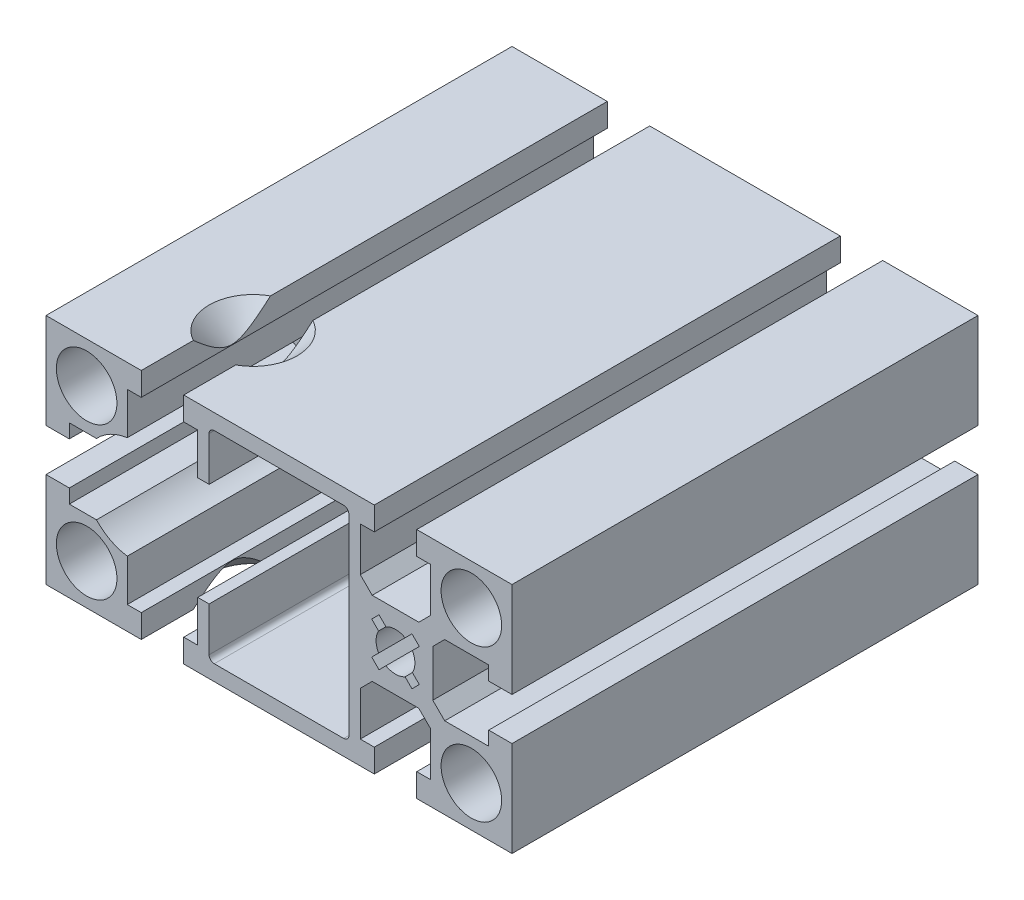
ISO-10303-21;
HEADER;
FILE_DESCRIPTION(('STEP AP214'),'2;1');
FILE_NAME('part.step','',(''),(''),'','','');
FILE_SCHEMA(('AUTOMOTIVE_DESIGN { 1 0 10303 214 1 1 1 1 }'));
ENDSEC;
DATA;
#1=APPLICATION_CONTEXT('core data for automotive mechanical design processes');
#2=APPLICATION_PROTOCOL_DEFINITION('international standard','automotive_design',2000,#1);
#3=PRODUCT_CONTEXT('',#1,'mechanical');
#4=PRODUCT('Part','Part','',(#3));
#5=PRODUCT_RELATED_PRODUCT_CATEGORY('part','',(#4));
#6=PRODUCT_DEFINITION_FORMATION('','',#4);
#7=PRODUCT_DEFINITION_CONTEXT('part definition',#1,'design');
#8=PRODUCT_DEFINITION('design','',#6,#7);
#9=PRODUCT_DEFINITION_SHAPE('','',#8);
#10=(LENGTH_UNIT() NAMED_UNIT(*) SI_UNIT(.MILLI.,.METRE.));
#11=(NAMED_UNIT(*) PLANE_ANGLE_UNIT() SI_UNIT($,.RADIAN.));
#12=(NAMED_UNIT(*) SI_UNIT($,.STERADIAN.) SOLID_ANGLE_UNIT());
#13=UNCERTAINTY_MEASURE_WITH_UNIT(LENGTH_MEASURE(1.E-05),#10,'distance_accuracy_value','');
#14=(GEOMETRIC_REPRESENTATION_CONTEXT(3) GLOBAL_UNCERTAINTY_ASSIGNED_CONTEXT((#13)) GLOBAL_UNIT_ASSIGNED_CONTEXT((#10,
#11,#12)) REPRESENTATION_CONTEXT('',''));
#15=CARTESIAN_POINT('',(0.,0.,0.));
#16=DIRECTION('',(0.,0.,1.));
#17=DIRECTION('',(1.,0.,0.));
#18=AXIS2_PLACEMENT_3D('',#15,#16,#17);
#19=CARTESIAN_POINT('',(-22.500000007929,22.5000000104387,72.5));
#20=DIRECTION('',(0.,1.,0.));
#21=DIRECTION('',(0.,0.,1.));
#22=AXIS2_PLACEMENT_3D('',#19,#20,#21);
#23=CONICAL_SURFACE('',#22,8.49999999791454,0.785398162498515);
#24=CARTESIAN_POINT('',(-22.500000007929,22.5000000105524,72.5));
#25=DIRECTION('',(0.,1.,0.));
#26=DIRECTION('',(0.,0.,1.));
#27=AXIS2_PLACEMENT_3D('',#24,#25,#26);
#28=CIRCLE('',#27,8.49999999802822);
#29=CARTESIAN_POINT('',(-26.6000000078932,22.5000000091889,79.9458041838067));
#30=VERTEX_POINT('',#29);
#31=CARTESIAN_POINT('',(-26.6000000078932,22.5000000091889,65.0541958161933));
#32=VERTEX_POINT('',#31);
#33=EDGE_CURVE('E1159',#30,#32,#28,.F.);
#34=ORIENTED_EDGE('',*,*,#33,.F.);
#35=CARTESIAN_POINT('',(-26.6000000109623,22.500000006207,65.0541958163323));
#36=CARTESIAN_POINT('',(-26.6000000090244,22.4042377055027,65.1635191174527));
#37=CARTESIAN_POINT('',(-26.600000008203,22.3087501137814,65.2730830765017));
#38=CARTESIAN_POINT('',(-26.6000000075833,22.1184016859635,65.4927567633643));
#39=CARTESIAN_POINT('',(-26.600000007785,22.0235408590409,65.6028664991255));
#40=CARTESIAN_POINT('',(-26.6000000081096,21.7399370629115,65.9342016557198));
#41=CARTESIAN_POINT('',(-26.6000000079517,21.5522556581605,66.1563386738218));
#42=CARTESIAN_POINT('',(-26.6000000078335,21.1768636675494,66.6081816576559));
#43=CARTESIAN_POINT('',(-26.6000000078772,20.989227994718,66.8379500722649));
#44=CARTESIAN_POINT('',(-26.6000000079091,20.6192054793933,67.3015959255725));
#45=CARTESIAN_POINT('',(-26.6000000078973,20.4368173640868,67.5354723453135));
#46=CARTESIAN_POINT('',(-26.600000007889,20.0790695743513,68.0089776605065));
#47=CARTESIAN_POINT('',(-26.6000000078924,19.9037173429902,68.2486122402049));
#48=CARTESIAN_POINT('',(-26.6000000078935,19.6485196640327,68.6137052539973));
#49=CARTESIAN_POINT('',(-26.6000000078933,19.5647225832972,68.736400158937));
#50=CARTESIAN_POINT('',(-26.6000000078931,19.4003774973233,68.9839419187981));
#51=CARTESIAN_POINT('',(-26.6000000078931,19.3198292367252,69.1087886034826));
#52=CARTESIAN_POINT('',(-26.6000000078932,19.1631922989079,69.3602282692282));
#53=CARTESIAN_POINT('',(-26.6000000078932,19.0870799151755,69.4868064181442));
#54=CARTESIAN_POINT('',(-26.6000000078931,18.9397473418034,69.7428153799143));
#55=CARTESIAN_POINT('',(-26.6000000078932,18.8685277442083,69.8722465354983));
#56=CARTESIAN_POINT('',(-26.6000000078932,18.7323147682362,70.1341398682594));
#57=CARTESIAN_POINT('',(-26.6000000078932,18.6673128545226,70.2665975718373));
#58=CARTESIAN_POINT('',(-26.6000000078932,18.5449978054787,70.5349899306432));
#59=CARTESIAN_POINT('',(-26.6000000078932,18.4876817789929,70.6709232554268));
#60=CARTESIAN_POINT('',(-26.6000000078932,18.381392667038,70.9496552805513));
#61=CARTESIAN_POINT('',(-26.6000000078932,18.3326419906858,71.0925399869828));
#62=CARTESIAN_POINT('',(-26.6000000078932,18.2474561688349,71.3819730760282));
#63=CARTESIAN_POINT('',(-26.6000000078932,18.2110190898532,71.5285208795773));
#64=CARTESIAN_POINT('',(-26.6000000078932,18.1529530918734,71.8234402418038));
#65=CARTESIAN_POINT('',(-26.6000000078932,18.1312152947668,71.9717899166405));
#66=CARTESIAN_POINT('',(-26.6000000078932,18.1037662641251,72.2699745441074));
#67=CARTESIAN_POINT('',(-26.6000000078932,18.09805231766,72.4198092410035));
#68=CARTESIAN_POINT('',(-26.6000000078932,18.1031356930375,72.7197794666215));
#69=CARTESIAN_POINT('',(-26.6000000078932,18.1139977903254,72.8699138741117));
#70=CARTESIAN_POINT('',(-26.6000000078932,18.1514525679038,73.1681947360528));
#71=CARTESIAN_POINT('',(-26.6000000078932,18.1780488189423,73.3163407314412));
#72=CARTESIAN_POINT('',(-26.6000000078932,18.2453165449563,73.6105961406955));
#73=CARTESIAN_POINT('',(-26.6000000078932,18.2860997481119,73.7566795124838));
#74=CARTESIAN_POINT('',(-26.6000000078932,18.3793218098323,74.0450218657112));
#75=CARTESIAN_POINT('',(-26.6000000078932,18.4317613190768,74.1872806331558));
#76=CARTESIAN_POINT('',(-26.6000000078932,18.5554734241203,74.4911489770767));
#77=CARTESIAN_POINT('',(-26.6000000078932,18.6284264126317,74.6520674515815));
#78=CARTESIAN_POINT('',(-26.6000000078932,18.7840996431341,74.969149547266));
#79=CARTESIAN_POINT('',(-26.6000000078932,18.8668253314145,75.1253104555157));
#80=CARTESIAN_POINT('',(-26.6000000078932,19.0398866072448,75.433730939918));
#81=CARTESIAN_POINT('',(-26.6000000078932,19.1302370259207,75.58598212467));
#82=CARTESIAN_POINT('',(-26.6000000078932,19.3166676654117,75.8868702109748));
#83=CARTESIAN_POINT('',(-26.6000000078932,19.4127467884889,76.035507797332));
#84=CARTESIAN_POINT('',(-26.6000000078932,19.6099326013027,76.3305943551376));
#85=CARTESIAN_POINT('',(-26.6000000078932,19.7110643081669,76.4770265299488));
#86=CARTESIAN_POINT('',(-26.6000000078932,19.916908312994,76.7673501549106));
#87=CARTESIAN_POINT('',(-26.6000000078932,20.0216207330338,76.9112415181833));
#88=CARTESIAN_POINT('',(-26.6000000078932,20.2337879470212,77.1967243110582));
#89=CARTESIAN_POINT('',(-26.6000000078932,20.3412394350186,77.3383182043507));
#90=CARTESIAN_POINT('',(-26.6000000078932,20.5584660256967,77.6197137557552));
#91=CARTESIAN_POINT('',(-26.6000000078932,20.6682411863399,77.7595153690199));
#92=CARTESIAN_POINT('',(-26.6000000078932,20.9187464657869,78.0740770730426));
#93=CARTESIAN_POINT('',(-26.6000000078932,21.0600420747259,78.2483863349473));
#94=CARTESIAN_POINT('',(-26.6000000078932,21.3450393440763,78.5950240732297));
#95=CARTESIAN_POINT('',(-26.6000000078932,21.4887410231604,78.7673525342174));
#96=CARTESIAN_POINT('',(-26.6000000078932,21.7761925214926,79.1081356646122));
#97=CARTESIAN_POINT('',(-26.6000000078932,21.9199172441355,79.2766115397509));
#98=CARTESIAN_POINT('',(-26.6000000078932,22.208888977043,79.6121749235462));
#99=CARTESIAN_POINT('',(-26.6000000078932,22.3541355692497,79.7792627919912));
#100=CARTESIAN_POINT('',(-26.6000000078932,22.5000000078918,79.945804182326));
#101=B_SPLINE_CURVE_WITH_KNOTS('',3,(#35,#36,#37,#38,#39,#40,#41,#42,#43,#44,#45,#46,#47,#48,
#49,#50,#51,#52,#53,#54,#55,#56,#57,#58,#59,#60,#61,#62,#63,#64,#65,#66,#67,#68,#69,#70,#71,#72,
#73,#74,#75,#76,#77,#78,#79,#80,#81,#82,#83,#84,#85,#86,#87,#88,#89,#90,#91,#92,#93,#94,#95,#96,
#97,#98,#99,#100),.UNSPECIFIED.,.F.,.F.,(4,2,2,2,2,2,2,2,2,2,2,2,2,2,2,2,2,2,2,2,2,2,2,2,2,2,2,
2,2,2,2,2,4),(0.,0.436001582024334,0.872009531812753,1.74440215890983,2.63429204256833,
3.52396422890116,4.41455401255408,4.86025418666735,5.30591925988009,5.74892962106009,
6.19199349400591,6.6344401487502,7.07671990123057,7.5291801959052,7.98156941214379,
8.43056994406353,8.87949445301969,9.3301777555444,9.7809633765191,10.2353826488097,
10.689827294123,11.219435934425,11.7493411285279,12.2803019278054,12.8111613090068,
13.3449768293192,13.8788105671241,14.4120279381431,14.9452586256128,15.6183821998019,
16.2915110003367,16.9558562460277,17.6200235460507),.UNSPECIFIED.);
#102=EDGE_CURVE('E1152',#32,#30,#101,.T.);
#103=ORIENTED_EDGE('',*,*,#102,.F.);
#104=EDGE_LOOP('',(#34,#103));
#105=FACE_BOUND('',#104,.T.);
#106=ADVANCED_FACE('F15',(#105),#23,.F.);
#107=CARTESIAN_POINT('',(-27.9178788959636,-8.519115E-09,90.));
#108=DIRECTION('',(0.,0.,-1.));
#109=DIRECTION('',(-1.,0.,0.));
#110=AXIS2_PLACEMENT_3D('',#107,#108,#109);
#111=CYLINDRICAL_SURFACE('',#110,10.);
#112=CARTESIAN_POINT('',(-27.9178788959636,-8.519115E-09,55.));
#113=DIRECTION('',(0.,0.,-1.));
#114=DIRECTION('',(-1.,0.,0.));
#115=AXIS2_PLACEMENT_3D('',#112,#113,#114);
#116=CIRCLE('',#115,10.);
#117=CARTESIAN_POINT('',(-29.3000000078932,9.90402650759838,55.));
#118=VERTEX_POINT('',#117);
#119=CARTESIAN_POINT('',(-35.2500000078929,6.79999999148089,55.));
#120=VERTEX_POINT('',#119);
#121=EDGE_CURVE('E2109',#118,#120,#116,.F.);
#122=ORIENTED_EDGE('',*,*,#121,.F.);
#123=DIRECTION('',(0.,0.,-1.));
#124=VECTOR('',#123,1.);
#125=CARTESIAN_POINT('',(-29.3000000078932,9.90402650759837,0.));
#126=LINE('',#125,#124);
#127=CARTESIAN_POINT('',(-29.3000000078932,9.90402650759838,90.));
#128=VERTEX_POINT('',#127);
#129=EDGE_CURVE('E1642',#128,#118,#126,.T.);
#130=ORIENTED_EDGE('',*,*,#129,.F.);
#131=CARTESIAN_POINT('',(-27.9178788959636,-8.519115E-09,90.));
#132=DIRECTION('',(0.,0.,-1.));
#133=DIRECTION('',(-1.,0.,0.));
#134=AXIS2_PLACEMENT_3D('',#131,#132,#133);
#135=CIRCLE('',#134,10.);
#136=CARTESIAN_POINT('',(-35.2500000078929,6.79999999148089,90.));
#137=VERTEX_POINT('',#136);
#138=EDGE_CURVE('E20',#137,#128,#135,.T.);
#139=ORIENTED_EDGE('',*,*,#138,.F.);
#140=DIRECTION('',(0.,0.,-1.));
#141=VECTOR('',#140,1.);
#142=CARTESIAN_POINT('',(-35.2500000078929,6.79999999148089,0.));
#143=LINE('',#142,#141);
#144=EDGE_CURVE('E463',#120,#137,#143,.F.);
#145=ORIENTED_EDGE('',*,*,#144,.F.);
#146=EDGE_LOOP('',(#122,#130,#139,#145));
#147=FACE_BOUND('',#146,.T.);
#148=ADVANCED_FACE('F1165',(#147),#111,.F.);
#149=CARTESIAN_POINT('',(-22.500000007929,-22.5000000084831,72.5));
#150=DIRECTION('',(0.,-1.,0.));
#151=DIRECTION('',(0.,0.,-1.));
#152=AXIS2_PLACEMENT_3D('',#149,#150,#151);
#153=CONICAL_SURFACE('',#152,8.5,0.785398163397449);
#154=CARTESIAN_POINT('',(-22.500000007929,-22.5000000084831,72.5));
#155=DIRECTION('',(0.,-1.,0.));
#156=DIRECTION('',(0.,0.,-1.));
#157=AXIS2_PLACEMENT_3D('',#154,#155,#156);
#158=CIRCLE('',#157,8.50000000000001);
#159=CARTESIAN_POINT('',(-26.600000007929,-22.5000000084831,65.0541958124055));
#160=VERTEX_POINT('',#159);
#161=CARTESIAN_POINT('',(-26.600000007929,-22.5000000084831,79.9458041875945));
#162=VERTEX_POINT('',#161);
#163=EDGE_CURVE('E1080',#160,#162,#158,.F.);
#164=ORIENTED_EDGE('',*,*,#163,.F.);
#165=CARTESIAN_POINT('',(-26.600000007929,-22.5000000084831,79.9458041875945));
#166=CARTESIAN_POINT('',(-26.600000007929,-22.4042377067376,79.8364808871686));
#167=CARTESIAN_POINT('',(-26.600000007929,-22.3087501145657,79.7269169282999));
#168=CARTESIAN_POINT('',(-26.600000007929,-22.1184016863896,79.5072432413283));
#169=CARTESIAN_POINT('',(-26.600000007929,-22.0235408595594,79.3971335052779));
#170=CARTESIAN_POINT('',(-26.600000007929,-21.7399370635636,79.0657983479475));
#171=CARTESIAN_POINT('',(-26.600000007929,-21.5522556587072,78.843661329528));
#172=CARTESIAN_POINT('',(-26.600000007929,-21.1768636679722,78.3918183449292));
#173=CARTESIAN_POINT('',(-26.600000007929,-20.9892279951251,78.1620499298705));
#174=CARTESIAN_POINT('',(-26.600000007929,-20.6192054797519,77.6984040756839));
#175=CARTESIAN_POINT('',(-26.600000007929,-20.4368173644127,77.4645276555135));
#176=CARTESIAN_POINT('',(-26.600000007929,-20.0790695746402,76.991022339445));
#177=CARTESIAN_POINT('',(-26.600000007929,-19.9037173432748,76.7513877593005));
#178=CARTESIAN_POINT('',(-26.600000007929,-19.6485196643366,76.3862947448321));
#179=CARTESIAN_POINT('',(-26.600000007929,-19.5647225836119,76.2635998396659));
#180=CARTESIAN_POINT('',(-26.600000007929,-19.4003774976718,76.0160580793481));
#181=CARTESIAN_POINT('',(-26.600000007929,-19.3198292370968,75.8912113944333));
#182=CARTESIAN_POINT('',(-26.600000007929,-19.163192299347,75.6397717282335));
#183=CARTESIAN_POINT('',(-26.600000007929,-19.0870799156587,75.5131935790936));
#184=CARTESIAN_POINT('',(-26.600000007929,-18.9397473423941,75.2571846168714));
#185=CARTESIAN_POINT('',(-26.600000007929,-18.8685277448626,75.1277534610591));
#186=CARTESIAN_POINT('',(-26.600000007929,-18.7323147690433,74.8658601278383));
#187=CARTESIAN_POINT('',(-26.600000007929,-18.6673128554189,74.7334024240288));
#188=CARTESIAN_POINT('',(-26.600000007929,-18.5449978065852,74.4650100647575));
#189=CARTESIAN_POINT('',(-26.600000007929,-18.4876817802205,74.3290767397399));
#190=CARTESIAN_POINT('',(-26.600000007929,-18.3813926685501,74.0503447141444));
#191=CARTESIAN_POINT('',(-26.600000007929,-18.332641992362,73.9074600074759));
#192=CARTESIAN_POINT('',(-26.600000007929,-18.247456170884,73.6180269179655));
#193=CARTESIAN_POINT('',(-26.600000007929,-18.2110190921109,73.4714791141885));
#194=CARTESIAN_POINT('',(-26.600000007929,-18.1529530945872,73.1765597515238));
#195=CARTESIAN_POINT('',(-26.600000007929,-18.1312152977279,73.0282100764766));
#196=CARTESIAN_POINT('',(-26.600000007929,-18.1037662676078,72.7300254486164));
#197=CARTESIAN_POINT('',(-26.600000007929,-18.098052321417,72.5801907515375));
#198=CARTESIAN_POINT('',(-26.600000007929,-18.1031356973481,72.2802205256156));
#199=CARTESIAN_POINT('',(-26.600000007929,-18.1139977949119,72.1300861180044));
#200=CARTESIAN_POINT('',(-26.600000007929,-18.1514525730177,71.8318052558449));
#201=CARTESIAN_POINT('',(-26.600000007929,-18.178048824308,71.6836592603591));
#202=CARTESIAN_POINT('',(-26.600000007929,-18.245316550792,71.389403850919));
#203=CARTESIAN_POINT('',(-26.600000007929,-18.2860997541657,71.2433204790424));
#204=CARTESIAN_POINT('',(-26.600000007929,-18.3793218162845,70.9549781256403));
#205=CARTESIAN_POINT('',(-26.600000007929,-18.4317613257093,70.8127193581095));
#206=CARTESIAN_POINT('',(-26.600000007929,-18.5554734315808,70.5088510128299));
#207=CARTESIAN_POINT('',(-26.600000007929,-18.6284264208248,70.3479325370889));
#208=CARTESIAN_POINT('',(-26.600000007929,-18.784099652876,70.0308504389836));
#209=CARTESIAN_POINT('',(-26.600000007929,-18.8668253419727,69.8746895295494));
#210=CARTESIAN_POINT('',(-26.600000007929,-19.0398866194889,69.5662690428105));
#211=CARTESIAN_POINT('',(-26.600000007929,-19.1302370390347,69.4140178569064));
#212=CARTESIAN_POINT('',(-26.600000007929,-19.3166676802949,69.113129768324));
#213=CARTESIAN_POINT('',(-26.600000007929,-19.4127468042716,68.9644921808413));
#214=CARTESIAN_POINT('',(-26.600000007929,-19.6099326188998,68.6694056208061));
#215=CARTESIAN_POINT('',(-26.600000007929,-19.7110643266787,68.5229734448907));
#216=CARTESIAN_POINT('',(-26.600000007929,-19.9169083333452,68.2326498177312));
#217=CARTESIAN_POINT('',(-26.600000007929,-20.0216207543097,68.0887584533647));
#218=CARTESIAN_POINT('',(-26.600000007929,-20.2337879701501,67.8032756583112));
#219=CARTESIAN_POINT('',(-26.600000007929,-20.3412394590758,67.6616817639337));
#220=CARTESIAN_POINT('',(-26.600000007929,-20.5584660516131,67.380286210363));
#221=CARTESIAN_POINT('',(-26.600000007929,-20.668241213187,67.2404845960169));
#222=CARTESIAN_POINT('',(-26.600000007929,-20.91874649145,66.9259228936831));
#223=CARTESIAN_POINT('',(-26.600000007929,-21.060042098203,66.7516136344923));
#224=CARTESIAN_POINT('',(-26.600000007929,-21.3450393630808,66.4049759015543));
#225=CARTESIAN_POINT('',(-26.600000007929,-21.4887410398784,66.2326474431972));
#226=CARTESIAN_POINT('',(-26.600000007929,-21.7761925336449,65.8918643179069));
#227=CARTESIAN_POINT('',(-26.600000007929,-21.9199172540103,65.7233884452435));
#228=CARTESIAN_POINT('',(-26.600000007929,-22.208888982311,65.3878250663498));
#229=CARTESIAN_POINT('',(-26.600000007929,-22.3541355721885,65.2207372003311));
#230=CARTESIAN_POINT('',(-26.600000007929,-22.5000000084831,65.0541958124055));
#231=B_SPLINE_CURVE_WITH_KNOTS('',3,(#165,#166,#167,#168,#169,#170,#171,#172,#173,#174,#175,
#176,#177,#178,#179,#180,#181,#182,#183,#184,#185,#186,#187,#188,#189,#190,#191,#192,#193,#194,
#195,#196,#197,#198,#199,#200,#201,#202,#203,#204,#205,#206,#207,#208,#209,#210,#211,#212,#213,
#214,#215,#216,#217,#218,#219,#220,#221,#222,#223,#224,#225,#226,#227,#228,#229,#230),
.UNSPECIFIED.,.F.,.F.,(4,2,2,2,2,2,2,2,2,2,2,2,2,2,2,2,2,2,2,2,2,2,2,2,2,2,2,2,2,2,2,2,4),(0.,
0.436001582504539,0.872009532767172,1.74440216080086,2.63429204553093,3.52396423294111,
4.41455401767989,4.86025419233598,5.30591926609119,5.74892962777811,6.19199350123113,
6.63444015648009,7.07671990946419,7.5291802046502,7.9815694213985,8.43056995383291,
8.87949446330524,9.33017776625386,9.780963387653,10.2353826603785,10.6898273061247,
11.2194359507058,11.7493411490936,12.2803019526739,12.811161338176,13.3449768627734,
13.8788106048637,14.4120279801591,14.9452586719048,15.6183822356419,16.2915110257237,
16.9558562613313,17.6200235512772),.UNSPECIFIED.);
#232=EDGE_CURVE('E1072',#162,#160,#231,.T.);
#233=ORIENTED_EDGE('',*,*,#232,.F.);
#234=EDGE_LOOP('',(#164,#233));
#235=FACE_BOUND('',#234,.T.);
#236=ADVANCED_FACE('F1082',(#235),#153,.F.);
#237=CARTESIAN_POINT('',(-27.9178788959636,-8.519115E-09,90.));
#238=DIRECTION('',(0.,0.,-1.));
#239=DIRECTION('',(-1.,0.,0.));
#240=AXIS2_PLACEMENT_3D('',#237,#238,#239);
#241=CYLINDRICAL_SURFACE('',#240,10.);
#242=CARTESIAN_POINT('',(-27.9178788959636,-8.519115E-09,90.));
#243=DIRECTION('',(0.,0.,-1.));
#244=DIRECTION('',(-1.,0.,0.));
#245=AXIS2_PLACEMENT_3D('',#242,#243,#244);
#246=CIRCLE('',#245,10.);
#247=CARTESIAN_POINT('',(-29.300000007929,-9.90402652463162,90.));
#248=VERTEX_POINT('',#247);
#249=CARTESIAN_POINT('',(-35.2500000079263,-6.80000000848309,90.));
#250=VERTEX_POINT('',#249);
#251=EDGE_CURVE('E2110',#248,#250,#246,.T.);
#252=ORIENTED_EDGE('',*,*,#251,.F.);
#253=DIRECTION('',(0.,0.,-1.));
#254=VECTOR('',#253,1.);
#255=CARTESIAN_POINT('',(-29.300000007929,-9.90402652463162,0.));
#256=LINE('',#255,#254);
#257=CARTESIAN_POINT('',(-29.300000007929,-9.90402652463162,55.));
#258=VERTEX_POINT('',#257);
#259=EDGE_CURVE('E1583',#258,#248,#256,.F.);
#260=ORIENTED_EDGE('',*,*,#259,.F.);
#261=CARTESIAN_POINT('',(-27.9178788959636,-8.519115E-09,55.));
#262=DIRECTION('',(0.,0.,-1.));
#263=DIRECTION('',(-1.,0.,0.));
#264=AXIS2_PLACEMENT_3D('',#261,#262,#263);
#265=CIRCLE('',#264,10.);
#266=CARTESIAN_POINT('',(-35.2500000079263,-6.80000000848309,55.));
#267=VERTEX_POINT('',#266);
#268=EDGE_CURVE('E2096',#267,#258,#265,.F.);
#269=ORIENTED_EDGE('',*,*,#268,.F.);
#270=DIRECTION('',(0.,0.,1.));
#271=VECTOR('',#270,1.);
#272=CARTESIAN_POINT('',(-35.2500000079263,-6.80000000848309,0.));
#273=LINE('',#272,#271);
#274=EDGE_CURVE('E1708',#250,#267,#273,.F.);
#275=ORIENTED_EDGE('',*,*,#274,.F.);
#276=EDGE_LOOP('',(#252,#260,#269,#275));
#277=FACE_BOUND('',#276,.T.);
#278=ADVANCED_FACE('F1170',(#277),#241,.F.);
#279=CARTESIAN_POINT('',(-7.78162E-09,-8.672969E-09,90.));
#280=DIRECTION('',(0.,0.,1.));
#281=DIRECTION('',(1.,0.,0.));
#282=AXIS2_PLACEMENT_3D('',#279,#280,#281);
#283=PLANE('',#282);
#284=CARTESIAN_POINT('',(-37.150000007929,14.6499999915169,90.));
#285=DIRECTION('',(0.,0.,1.));
#286=DIRECTION('',(1.,0.,0.));
#287=AXIS2_PLACEMENT_3D('',#284,#285,#286);
#288=CIRCLE('',#287,5.85);
#289=CARTESIAN_POINT('',(-31.300000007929,14.6499999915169,90.));
#290=VERTEX_POINT('',#289);
#291=EDGE_CURVE('E1068',#290,#290,#288,.F.);
#292=ORIENTED_EDGE('',*,*,#291,.T.);
#293=EDGE_LOOP('',(#292));
#294=FACE_BOUND('',#293,.T.);
#295=DIRECTION('',(0.,1.,0.));
#296=VECTOR('',#295,1.);
#297=CARTESIAN_POINT('',(-40.500000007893,6.79999999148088,90.));
#298=LINE('',#297,#296);
#299=CARTESIAN_POINT('',(-40.500000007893,6.79999999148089,90.));
#300=VERTEX_POINT('',#299);
#301=CARTESIAN_POINT('',(-40.500000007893,4.09999999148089,90.));
#302=VERTEX_POINT('',#301);
#303=EDGE_CURVE('E1619',#300,#302,#298,.F.);
#304=ORIENTED_EDGE('',*,*,#303,.F.);
#305=DIRECTION('',(1.,0.,0.));
#306=VECTOR('',#305,1.);
#307=CARTESIAN_POINT('',(-32.0000000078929,6.79999999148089,90.));
#308=LINE('',#307,#306);
#309=EDGE_CURVE('E468',#137,#300,#308,.F.);
#310=ORIENTED_EDGE('',*,*,#309,.F.);
#311=ORIENTED_EDGE('',*,*,#138,.T.);
#312=DIRECTION('',(0.,1.,0.));
#313=VECTOR('',#312,1.);
#314=CARTESIAN_POINT('',(-29.3000000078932,17.9999999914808,90.));
#315=LINE('',#314,#313);
#316=CARTESIAN_POINT('',(-29.3000000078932,17.9999999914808,90.));
#317=VERTEX_POINT('',#316);
#318=EDGE_CURVE('E1638',#317,#128,#315,.F.);
#319=ORIENTED_EDGE('',*,*,#318,.F.);
#320=DIRECTION('',(1.,0.,0.));
#321=VECTOR('',#320,1.);
#322=CARTESIAN_POINT('',(-26.6000000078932,17.9999999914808,90.));
#323=LINE('',#322,#321);
#324=CARTESIAN_POINT('',(-26.6000000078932,17.9999999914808,90.));
#325=VERTEX_POINT('',#324);
#326=EDGE_CURVE('E1635',#325,#317,#323,.F.);
#327=ORIENTED_EDGE('',*,*,#326,.F.);
#328=DIRECTION('',(0.,1.,0.));
#329=VECTOR('',#328,1.);
#330=CARTESIAN_POINT('',(-26.6000000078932,22.4999999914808,90.));
#331=LINE('',#330,#329);
#332=CARTESIAN_POINT('',(-26.6000000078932,22.4999999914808,90.));
#333=VERTEX_POINT('',#332);
#334=EDGE_CURVE('E1157',#333,#325,#331,.F.);
#335=ORIENTED_EDGE('',*,*,#334,.F.);
#336=DIRECTION('',(1.,0.,0.));
#337=VECTOR('',#336,1.);
#338=CARTESIAN_POINT('',(-45.0000000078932,22.4999999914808,90.));
#339=LINE('',#338,#337);
#340=CARTESIAN_POINT('',(-45.0000000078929,22.4999999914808,90.));
#341=VERTEX_POINT('',#340);
#342=EDGE_CURVE('E1629',#341,#333,#339,.T.);
#343=ORIENTED_EDGE('',*,*,#342,.F.);
#344=DIRECTION('',(0.,1.,0.));
#345=VECTOR('',#344,1.);
#346=CARTESIAN_POINT('',(-45.0000000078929,4.09999999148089,90.));
#347=LINE('',#346,#345);
#348=CARTESIAN_POINT('',(-45.0000000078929,4.09999999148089,90.));
#349=VERTEX_POINT('',#348);
#350=EDGE_CURVE('E1625',#349,#341,#347,.T.);
#351=ORIENTED_EDGE('',*,*,#350,.F.);
#352=DIRECTION('',(1.,0.,0.));
#353=VECTOR('',#352,1.);
#354=CARTESIAN_POINT('',(-40.500000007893,4.09999999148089,90.));
#355=LINE('',#354,#353);
#356=EDGE_CURVE('E1622',#302,#349,#355,.F.);
#357=ORIENTED_EDGE('',*,*,#356,.F.);
#358=EDGE_LOOP('',(#304,#310,#311,#319,#327,#335,#343,#351,#357));
#359=FACE_BOUND('',#358,.T.);
#360=ADVANCED_FACE('F1173',(#294,#359),#283,.T.);
#361=CARTESIAN_POINT('',(-7.78162E-09,-8.672969E-09,90.));
#362=DIRECTION('',(0.,0.,1.));
#363=DIRECTION('',(1.,0.,0.));
#364=AXIS2_PLACEMENT_3D('',#361,#362,#363);
#365=PLANE('',#364);
#366=CARTESIAN_POINT('',(-37.150000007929,-14.6500000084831,90.));
#367=DIRECTION('',(0.,0.,1.));
#368=DIRECTION('',(1.,0.,0.));
#369=AXIS2_PLACEMENT_3D('',#366,#367,#368);
#370=CIRCLE('',#369,5.85);
#371=CARTESIAN_POINT('',(-31.300000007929,-14.6500000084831,90.));
#372=VERTEX_POINT('',#371);
#373=EDGE_CURVE('E1065',#372,#372,#370,.F.);
#374=ORIENTED_EDGE('',*,*,#373,.T.);
#375=EDGE_LOOP('',(#374));
#376=FACE_BOUND('',#375,.T.);
#377=DIRECTION('',(1.,0.,0.));
#378=VECTOR('',#377,1.);
#379=CARTESIAN_POINT('',(-29.300000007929,-18.0000000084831,90.));
#380=LINE('',#379,#378);
#381=CARTESIAN_POINT('',(-29.300000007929,-18.0000000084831,90.));
#382=VERTEX_POINT('',#381);
#383=CARTESIAN_POINT('',(-26.600000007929,-18.0000000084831,90.));
#384=VERTEX_POINT('',#383);
#385=EDGE_CURVE('E1584',#382,#384,#380,.T.);
#386=ORIENTED_EDGE('',*,*,#385,.F.);
#387=DIRECTION('',(0.,1.,0.));
#388=VECTOR('',#387,1.);
#389=CARTESIAN_POINT('',(-29.300000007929,-9.50000000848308,90.));
#390=LINE('',#389,#388);
#391=EDGE_CURVE('E1580',#248,#382,#390,.F.);
#392=ORIENTED_EDGE('',*,*,#391,.F.);
#393=ORIENTED_EDGE('',*,*,#251,.T.);
#394=DIRECTION('',(1.,0.,0.));
#395=VECTOR('',#394,1.);
#396=CARTESIAN_POINT('',(-40.500000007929,-6.80000000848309,90.));
#397=LINE('',#396,#395);
#398=CARTESIAN_POINT('',(-40.500000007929,-6.80000000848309,90.));
#399=VERTEX_POINT('',#398);
#400=EDGE_CURVE('E1603',#399,#250,#397,.T.);
#401=ORIENTED_EDGE('',*,*,#400,.F.);
#402=DIRECTION('',(0.,1.,0.));
#403=VECTOR('',#402,1.);
#404=CARTESIAN_POINT('',(-40.500000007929,-4.10000000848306,90.));
#405=LINE('',#404,#403);
#406=CARTESIAN_POINT('',(-40.500000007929,-4.10000000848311,90.));
#407=VERTEX_POINT('',#406);
#408=EDGE_CURVE('E1600',#407,#399,#405,.F.);
#409=ORIENTED_EDGE('',*,*,#408,.F.);
#410=DIRECTION('',(1.,0.,0.));
#411=VECTOR('',#410,1.);
#412=CARTESIAN_POINT('',(-45.000000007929,-4.10000000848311,90.));
#413=LINE('',#412,#411);
#414=CARTESIAN_POINT('',(-45.000000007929,-4.10000000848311,90.));
#415=VERTEX_POINT('',#414);
#416=EDGE_CURVE('E1597',#415,#407,#413,.T.);
#417=ORIENTED_EDGE('',*,*,#416,.F.);
#418=DIRECTION('',(0.,1.,0.));
#419=VECTOR('',#418,1.);
#420=CARTESIAN_POINT('',(-45.000000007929,-22.5000000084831,90.));
#421=LINE('',#420,#419);
#422=CARTESIAN_POINT('',(-45.000000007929,-22.5000000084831,90.));
#423=VERTEX_POINT('',#422);
#424=EDGE_CURVE('E1594',#423,#415,#421,.T.);
#425=ORIENTED_EDGE('',*,*,#424,.F.);
#426=DIRECTION('',(1.,0.,0.));
#427=VECTOR('',#426,1.);
#428=CARTESIAN_POINT('',(-26.600000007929,-22.5000000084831,90.));
#429=LINE('',#428,#427);
#430=CARTESIAN_POINT('',(-26.600000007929,-22.5000000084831,90.));
#431=VERTEX_POINT('',#430);
#432=EDGE_CURVE('E1591',#431,#423,#429,.F.);
#433=ORIENTED_EDGE('',*,*,#432,.F.);
#434=DIRECTION('',(0.,1.,0.));
#435=VECTOR('',#434,1.);
#436=CARTESIAN_POINT('',(-26.600000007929,-18.0000000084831,90.));
#437=LINE('',#436,#435);
#438=EDGE_CURVE('E1588',#384,#431,#437,.F.);
#439=ORIENTED_EDGE('',*,*,#438,.F.);
#440=EDGE_LOOP('',(#386,#392,#393,#401,#409,#417,#425,#433,#439));
#441=FACE_BOUND('',#440,.T.);
#442=ADVANCED_FACE('F1176',(#376,#441),#365,.T.);
#443=CARTESIAN_POINT('',(-22.500000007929,-22.5000000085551,72.5));
#444=DIRECTION('',(0.,-1.,0.));
#445=DIRECTION('',(0.,0.,-1.));
#446=AXIS2_PLACEMENT_3D('',#443,#444,#445);
#447=CONICAL_SURFACE('',#446,8.50000000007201,0.785398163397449);
#448=CARTESIAN_POINT('',(-22.500000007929,-22.5000000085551,72.5));
#449=DIRECTION('',(0.,-1.,0.));
#450=DIRECTION('',(0.,0.,-1.));
#451=AXIS2_PLACEMENT_3D('',#448,#449,#450);
#452=CIRCLE('',#451,8.50000000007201);
#453=CARTESIAN_POINT('',(-18.4000000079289,-22.5000000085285,79.9458041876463));
#454=VERTEX_POINT('',#453);
#455=CARTESIAN_POINT('',(-18.4000000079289,-22.5000000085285,65.0541958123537));
#456=VERTEX_POINT('',#455);
#457=EDGE_CURVE('E1049',#454,#456,#452,.F.);
#458=ORIENTED_EDGE('',*,*,#457,.F.);
#459=CARTESIAN_POINT('',(-18.4000000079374,-22.5000000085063,65.054195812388));
#460=CARTESIAN_POINT('',(-18.4000000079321,-22.4042377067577,65.1635191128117));
#461=CARTESIAN_POINT('',(-18.4000000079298,-22.3087501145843,65.2730830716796));
#462=CARTESIAN_POINT('',(-18.4000000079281,-22.1184016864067,65.4927567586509));
#463=CARTESIAN_POINT('',(-18.4000000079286,-22.0235408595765,65.6028664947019));
#464=CARTESIAN_POINT('',(-18.4000000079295,-21.7399370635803,65.9342016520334));
#465=CARTESIAN_POINT('',(-18.4000000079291,-21.5522556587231,66.1563386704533));
#466=CARTESIAN_POINT('',(-18.4000000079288,-21.1768636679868,66.6081816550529));
#467=CARTESIAN_POINT('',(-18.4000000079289,-20.9892279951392,66.837950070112));
#468=CARTESIAN_POINT('',(-18.400000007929,-20.6192054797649,67.3015959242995));
#469=CARTESIAN_POINT('',(-18.4000000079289,-20.4368173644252,67.5354723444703));
#470=CARTESIAN_POINT('',(-18.4000000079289,-20.0790695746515,68.0089776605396));
#471=CARTESIAN_POINT('',(-18.4000000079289,-19.9037173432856,68.2486122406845));
#472=CARTESIAN_POINT('',(-18.4000000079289,-19.6485196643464,68.6137052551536));
#473=CARTESIAN_POINT('',(-18.4000000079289,-19.5647225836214,68.73640016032));
#474=CARTESIAN_POINT('',(-18.4000000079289,-19.4003774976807,68.9839419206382));
#475=CARTESIAN_POINT('',(-18.4000000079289,-19.3198292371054,69.1087886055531));
#476=CARTESIAN_POINT('',(-18.4000000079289,-19.163192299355,69.3602282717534));
#477=CARTESIAN_POINT('',(-18.4000000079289,-19.0870799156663,69.4868064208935));
#478=CARTESIAN_POINT('',(-18.4000000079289,-18.9397473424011,69.7428153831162));
#479=CARTESIAN_POINT('',(-18.4000000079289,-18.8685277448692,69.8722465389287));
#480=CARTESIAN_POINT('',(-18.4000000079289,-18.7323147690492,70.13413987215));
#481=CARTESIAN_POINT('',(-18.4000000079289,-18.6673128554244,70.2665975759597));
#482=CARTESIAN_POINT('',(-18.4000000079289,-18.54499780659,70.5349899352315));
#483=CARTESIAN_POINT('',(-18.4000000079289,-18.4876817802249,70.6709232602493));
#484=CARTESIAN_POINT('',(-18.4000000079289,-18.3813926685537,70.9496552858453));
#485=CARTESIAN_POINT('',(-18.4000000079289,-18.3326419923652,71.0925399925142));
#486=CARTESIAN_POINT('',(-18.4000000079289,-18.2474561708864,71.3819730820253));
#487=CARTESIAN_POINT('',(-18.4000000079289,-18.211019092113,71.5285208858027));
#488=CARTESIAN_POINT('',(-18.4000000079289,-18.1529530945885,71.8234402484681));
#489=CARTESIAN_POINT('',(-18.4000000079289,-18.1312152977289,71.9717899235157));
#490=CARTESIAN_POINT('',(-18.4000000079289,-18.1037662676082,72.2699745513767));
#491=CARTESIAN_POINT('',(-18.4000000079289,-18.0980523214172,72.419809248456));
#492=CARTESIAN_POINT('',(-18.4000000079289,-18.1031356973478,72.7197794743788));
#493=CARTESIAN_POINT('',(-18.4000000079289,-18.1139977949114,72.8699138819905));
#494=CARTESIAN_POINT('',(-18.4000000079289,-18.151452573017,73.1681947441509));
#495=CARTESIAN_POINT('',(-18.4000000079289,-18.1780488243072,73.3163407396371));
#496=CARTESIAN_POINT('',(-18.4000000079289,-18.2453165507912,73.6105961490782));
#497=CARTESIAN_POINT('',(-18.4000000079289,-18.286099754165,73.7566795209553));
#498=CARTESIAN_POINT('',(-18.4000000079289,-18.379321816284,74.0450218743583));
#499=CARTESIAN_POINT('',(-18.4000000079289,-18.4317613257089,74.1872806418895));
#500=CARTESIAN_POINT('',(-18.4000000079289,-18.5554734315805,74.4911489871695));
#501=CARTESIAN_POINT('',(-18.4000000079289,-18.6284264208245,74.6520674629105));
#502=CARTESIAN_POINT('',(-18.4000000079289,-18.7840996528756,74.9691495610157));
#503=CARTESIAN_POINT('',(-18.4000000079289,-18.8668253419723,75.1253104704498));
#504=CARTESIAN_POINT('',(-18.4000000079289,-19.0398866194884,75.4337309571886));
#505=CARTESIAN_POINT('',(-18.4000000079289,-19.1302370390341,75.5859821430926));
#506=CARTESIAN_POINT('',(-18.4000000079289,-19.3166676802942,75.8868702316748));
#507=CARTESIAN_POINT('',(-18.4000000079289,-19.4127468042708,76.0355078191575));
#508=CARTESIAN_POINT('',(-18.4000000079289,-19.6099326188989,76.3305943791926));
#509=CARTESIAN_POINT('',(-18.4000000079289,-19.7110643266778,76.4770265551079));
#510=CARTESIAN_POINT('',(-18.4000000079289,-19.9169083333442,76.7673501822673));
#511=CARTESIAN_POINT('',(-18.4000000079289,-20.0216207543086,76.9112415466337));
#512=CARTESIAN_POINT('',(-18.4000000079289,-20.2337879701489,77.1967243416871));
#513=CARTESIAN_POINT('',(-18.4000000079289,-20.3412394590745,77.3383182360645));
#514=CARTESIAN_POINT('',(-18.4000000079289,-20.5584660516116,77.6197137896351));
#515=CARTESIAN_POINT('',(-18.4000000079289,-20.6682412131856,77.7595154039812));
#516=CARTESIAN_POINT('',(-18.4000000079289,-20.91874649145,78.074077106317));
#517=CARTESIAN_POINT('',(-18.4000000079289,-21.0600420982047,78.2483863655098));
#518=CARTESIAN_POINT('',(-18.4000000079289,-21.3450393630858,78.5950240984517));
#519=CARTESIAN_POINT('',(-18.4000000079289,-21.4887410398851,78.7673525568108));
#520=CARTESIAN_POINT('',(-18.4000000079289,-21.776192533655,79.108135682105));
#521=CARTESIAN_POINT('',(-18.4000000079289,-21.919917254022,79.2766115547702));
#522=CARTESIAN_POINT('',(-18.4000000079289,-22.2088889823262,79.6121749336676));
#523=CARTESIAN_POINT('',(-18.4000000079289,-22.3541355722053,79.7792627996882));
#524=CARTESIAN_POINT('',(-18.4000000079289,-22.5000000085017,79.9458041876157));
#525=B_SPLINE_CURVE_WITH_KNOTS('',3,(#459,#460,#461,#462,#463,#464,#465,#466,#467,#468,#469,
#470,#471,#472,#473,#474,#475,#476,#477,#478,#479,#480,#481,#482,#483,#484,#485,#486,#487,#488,
#489,#490,#491,#492,#493,#494,#495,#496,#497,#498,#499,#500,#501,#502,#503,#504,#505,#506,#507,
#508,#509,#510,#511,#512,#513,#514,#515,#516,#517,#518,#519,#520,#521,#522,#523,#524),
.UNSPECIFIED.,.F.,.F.,(4,2,2,2,2,2,2,2,2,2,2,2,2,2,2,2,2,2,2,2,2,2,2,2,2,2,2,2,2,2,2,2,4),(0.,
0.436001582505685,0.872009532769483,1.74440216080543,2.63429204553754,3.52396423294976,
4.41455401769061,4.86025419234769,5.30591926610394,5.74892962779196,6.19199350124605,
6.63444015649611,7.07671990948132,7.52918020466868,7.9815694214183,8.43056995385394,
8.87949446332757,9.33017776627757,9.78096338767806,10.235382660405,10.6898273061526,
11.2194359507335,11.749341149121,12.2803019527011,12.8111613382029,13.3449768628,
13.8788106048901,14.4120279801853,14.9452586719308,15.6183822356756,16.2915110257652,
16.9558562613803,17.6200235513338),.UNSPECIFIED.);
#526=EDGE_CURVE('E1042',#456,#454,#525,.T.);
#527=ORIENTED_EDGE('',*,*,#526,.F.);
#528=EDGE_LOOP('',(#458,#527));
#529=FACE_BOUND('',#528,.T.);
#530=ADVANCED_FACE('F17',(#529),#447,.F.);
#531=CARTESIAN_POINT('',(-22.500000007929,22.5000000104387,72.5));
#532=DIRECTION('',(0.,1.,0.));
#533=DIRECTION('',(0.,0.,1.));
#534=AXIS2_PLACEMENT_3D('',#531,#532,#533);
#535=CONICAL_SURFACE('',#534,8.49999999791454,0.785398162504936);
#536=CARTESIAN_POINT('',(-22.500000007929,22.5000000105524,72.5));
#537=DIRECTION('',(0.,1.,0.));
#538=DIRECTION('',(0.,0.,1.));
#539=AXIS2_PLACEMENT_3D('',#536,#537,#538);
#540=CIRCLE('',#539,8.49999999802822);
#541=CARTESIAN_POINT('',(-18.4000000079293,22.5000000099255,65.0541958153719));
#542=VERTEX_POINT('',#541);
#543=CARTESIAN_POINT('',(-18.4000000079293,22.5000000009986,79.9458041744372));
#544=VERTEX_POINT('',#543);
#545=EDGE_CURVE('E888',#542,#544,#540,.F.);
#546=ORIENTED_EDGE('',*,*,#545,.F.);
#547=CARTESIAN_POINT('',(-18.4000000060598,22.5000000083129,79.9458041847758));
#548=CARTESIAN_POINT('',(-18.4000000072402,22.4042377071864,79.8364808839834));
#549=CARTESIAN_POINT('',(-18.4000000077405,22.3087501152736,79.7269169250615));
#550=CARTESIAN_POINT('',(-18.400000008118,22.1184016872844,79.5072432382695));
#551=CARTESIAN_POINT('',(-18.4000000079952,22.023540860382,79.3971335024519));
#552=CARTESIAN_POINT('',(-18.4000000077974,21.7399370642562,79.0657983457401));
#553=CARTESIAN_POINT('',(-18.4000000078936,21.5522556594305,78.8436613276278));
#554=CARTESIAN_POINT('',(-18.4000000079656,21.1768636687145,78.3918183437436));
#555=CARTESIAN_POINT('',(-18.400000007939,20.9892279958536,78.1620499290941));
#556=CARTESIAN_POINT('',(-18.4000000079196,20.6192054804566,77.6984040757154));
#557=CARTESIAN_POINT('',(-18.4000000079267,20.4368173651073,77.464527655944));
#558=CARTESIAN_POINT('',(-18.4000000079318,20.0790695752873,76.9910223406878));
#559=CARTESIAN_POINT('',(-18.4000000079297,19.9037173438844,76.7513877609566));
#560=CARTESIAN_POINT('',(-18.400000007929,19.6485196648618,76.3862947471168));
#561=CARTESIAN_POINT('',(-18.4000000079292,19.5647225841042,76.2635998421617));
#562=CARTESIAN_POINT('',(-18.4000000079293,19.4003774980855,76.0160580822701));
#563=CARTESIAN_POINT('',(-18.4000000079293,19.3198292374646,75.8912113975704));
#564=CARTESIAN_POINT('',(-18.4000000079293,19.1631922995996,75.6397717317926));
#565=CARTESIAN_POINT('',(-18.4000000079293,19.0870799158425,75.5131935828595));
#566=CARTESIAN_POINT('',(-18.4000000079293,18.9397473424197,75.2571846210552));
#567=CARTESIAN_POINT('',(-18.4000000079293,18.8685277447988,75.1277534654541));
#568=CARTESIAN_POINT('',(-18.4000000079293,18.7323147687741,74.8658601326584));
#569=CARTESIAN_POINT('',(-18.4000000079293,18.6673128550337,74.7334024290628));
#570=CARTESIAN_POINT('',(-18.4000000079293,18.544997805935,74.465010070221));
#571=CARTESIAN_POINT('',(-18.4000000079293,18.4876817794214,74.3290767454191));
#572=CARTESIAN_POINT('',(-18.4000000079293,18.3813926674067,74.0503447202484));
#573=CARTESIAN_POINT('',(-18.4000000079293,18.3326419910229,73.9074600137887));
#574=CARTESIAN_POINT('',(-18.4000000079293,18.2474561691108,73.6180269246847));
#575=CARTESIAN_POINT('',(-18.4000000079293,18.2110190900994,73.4714791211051));
#576=CARTESIAN_POINT('',(-18.4000000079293,18.1529530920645,73.1765597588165));
#577=CARTESIAN_POINT('',(-18.4000000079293,18.1312152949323,73.0282100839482));
#578=CARTESIAN_POINT('',(-18.4000000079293,18.1037662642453,72.7300254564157));
#579=CARTESIAN_POINT('',(-18.4000000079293,18.0980523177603,72.5801907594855));
#580=CARTESIAN_POINT('',(-18.4000000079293,18.1031356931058,72.2802205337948));
#581=CARTESIAN_POINT('',(-18.4000000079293,18.1139977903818,72.130086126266));
#582=CARTESIAN_POINT('',(-18.4000000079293,18.151452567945,71.8318052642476));
#583=CARTESIAN_POINT('',(-18.4000000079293,18.1780488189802,71.6836592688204));
#584=CARTESIAN_POINT('',(-18.4000000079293,18.2453165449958,71.3894038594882));
#585=CARTESIAN_POINT('',(-18.4000000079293,18.2860997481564,71.2433204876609));
#586=CARTESIAN_POINT('',(-18.4000000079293,18.3793218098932,70.954978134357));
#587=CARTESIAN_POINT('',(-18.4000000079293,18.4317613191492,70.8127193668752));
#588=CARTESIAN_POINT('',(-18.4000000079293,18.5554734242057,70.5088510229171));
#589=CARTESIAN_POINT('',(-18.4000000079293,18.6284264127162,70.3479325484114));
#590=CARTESIAN_POINT('',(-18.4000000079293,18.7840996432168,70.0308504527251));
#591=CARTESIAN_POINT('',(-18.4000000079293,18.8668253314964,69.8746895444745));
#592=CARTESIAN_POINT('',(-18.4000000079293,19.0398866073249,69.5662690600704));
#593=CARTESIAN_POINT('',(-18.4000000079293,19.130237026,69.4140178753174));
#594=CARTESIAN_POINT('',(-18.4000000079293,19.3166676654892,69.1131297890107));
#595=CARTESIAN_POINT('',(-18.4000000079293,19.4127467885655,68.9644922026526));
#596=CARTESIAN_POINT('',(-18.4000000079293,19.6099326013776,68.6694056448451));
#597=CARTESIAN_POINT('',(-18.4000000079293,19.711064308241,68.5229734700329));
#598=CARTESIAN_POINT('',(-18.4000000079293,19.9169083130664,68.2326498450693));
#599=CARTESIAN_POINT('',(-18.4000000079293,20.0216207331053,68.0887584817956));
#600=CARTESIAN_POINT('',(-18.4000000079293,20.2337879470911,67.8032756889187));
#601=CARTESIAN_POINT('',(-18.4000000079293,20.3412394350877,67.6616817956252));
#602=CARTESIAN_POINT('',(-18.4000000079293,20.5584660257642,67.3802862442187));
#603=CARTESIAN_POINT('',(-18.4000000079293,20.6682411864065,67.240484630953));
#604=CARTESIAN_POINT('',(-18.4000000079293,20.9187464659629,66.9259229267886));
#605=CARTESIAN_POINT('',(-18.4000000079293,21.0600420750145,66.7516136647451));
#606=CARTESIAN_POINT('',(-18.4000000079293,21.3450393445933,66.4049759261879));
#607=CARTESIAN_POINT('',(-18.4000000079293,21.4887410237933,66.2326474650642));
#608=CARTESIAN_POINT('',(-18.4000000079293,21.7761925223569,65.8918643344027));
#609=CARTESIAN_POINT('',(-18.4000000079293,21.9199172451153,65.7233884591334));
#610=CARTESIAN_POINT('',(-18.4000000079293,22.2088889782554,65.3878250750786));
#611=CARTESIAN_POINT('',(-18.4000000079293,22.3541355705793,65.2207372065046));
#612=CARTESIAN_POINT('',(-18.4000000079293,22.5000000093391,65.0541958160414));
#613=B_SPLINE_CURVE_WITH_KNOTS('',3,(#547,#548,#549,#550,#551,#552,#553,#554,#555,#556,#557,
#558,#559,#560,#561,#562,#563,#564,#565,#566,#567,#568,#569,#570,#571,#572,#573,#574,#575,#576,
#577,#578,#579,#580,#581,#582,#583,#584,#585,#586,#587,#588,#589,#590,#591,#592,#593,#594,#595,
#596,#597,#598,#599,#600,#601,#602,#603,#604,#605,#606,#607,#608,#609,#610,#611,#612),
.UNSPECIFIED.,.F.,.F.,(4,2,2,2,2,2,2,2,2,2,2,2,2,2,2,2,2,2,2,2,2,2,2,2,2,2,2,2,2,2,2,2,4),(0.,
0.436001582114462,0.872009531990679,1.74440215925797,2.63429204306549,3.52396422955,
4.414554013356,4.8602541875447,5.30591926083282,5.74892962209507,6.19199349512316,
6.63444014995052,7.07671990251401,7.52918019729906,7.98156941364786,8.43056994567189,
8.8794944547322,9.33017775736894,9.78096337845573,10.2353826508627,10.6898272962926,
11.2194359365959,11.7493411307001,12.2803019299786,12.8111613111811,13.3449768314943,
13.8788105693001,14.41202794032,14.9452586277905,15.6183822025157,16.2915110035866,
16.9558562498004,17.620023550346),.UNSPECIFIED.);
#614=EDGE_CURVE('E879',#544,#542,#613,.T.);
#615=ORIENTED_EDGE('',*,*,#614,.F.);
#616=EDGE_LOOP('',(#546,#615));
#617=FACE_BOUND('',#616,.T.);
#618=ADVANCED_FACE('F890',(#617),#535,.F.);
#619=CARTESIAN_POINT('',(-22.500000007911,-8.53718E-09,55.));
#620=DIRECTION('',(0.,0.,1.));
#621=DIRECTION('',(1.,0.,0.));
#622=AXIS2_PLACEMENT_3D('',#619,#620,#621);
#623=PLANE('',#622);
#624=DIRECTION('',(0.707106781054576,0.707106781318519,0.));
#625=VECTOR('',#624,1.);
#626=CARTESIAN_POINT('',(-24.3485242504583,-3.26273782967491,55.));
#627=LINE('',#626,#625);
#628=CARTESIAN_POINT('',(-24.3485242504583,-3.26273782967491,55.));
#629=VERTEX_POINT('',#628);
#630=CARTESIAN_POINT('',(-25.681980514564,-4.59619409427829,55.));
#631=VERTEX_POINT('',#630);
#632=EDGE_CURVE('E1525',#629,#631,#627,.F.);
#633=ORIENTED_EDGE('',*,*,#632,.T.);
#634=DIRECTION('',(0.707106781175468,-0.707106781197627,0.));
#635=VECTOR('',#634,1.);
#636=CARTESIAN_POINT('',(-25.681980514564,-4.59619409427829,55.));
#637=LINE('',#636,#635);
#638=CARTESIAN_POINT('',(-27.0961940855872,-3.18198052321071,55.));
#639=VERTEX_POINT('',#638);
#640=EDGE_CURVE('E1518',#631,#639,#637,.F.);
#641=ORIENTED_EDGE('',*,*,#640,.T.);
#642=DIRECTION('',(-0.70710678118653,-0.707106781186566,0.));
#643=VECTOR('',#642,1.);
#644=CARTESIAN_POINT('',(-27.0961940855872,-3.18198052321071,55.));
#645=LINE('',#644,#643);
#646=CARTESIAN_POINT('',(-25.7627378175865,-1.84852425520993,55.));
#647=VERTEX_POINT('',#646);
#648=EDGE_CURVE('E1521',#639,#647,#645,.F.);
#649=ORIENTED_EDGE('',*,*,#648,.T.);
#650=CARTESIAN_POINT('',(-22.4999999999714,4.21752E-11,55.));
#651=DIRECTION('',(0.,0.,1.));
#652=DIRECTION('',(1.,0.,0.));
#653=AXIS2_PLACEMENT_3D('',#650,#651,#652);
#654=CIRCLE('',#653,3.7499999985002);
#655=CARTESIAN_POINT('',(-25.7627378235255,1.84852424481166,55.));
#656=VERTEX_POINT('',#655);
#657=EDGE_CURVE('E1062',#647,#656,#654,.F.);
#658=ORIENTED_EDGE('',*,*,#657,.T.);
#659=DIRECTION('',(0.707106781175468,-0.707106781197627,0.));
#660=VECTOR('',#659,1.);
#661=CARTESIAN_POINT('',(-25.7627378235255,1.84852424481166,55.));
#662=LINE('',#661,#660);
#663=CARTESIAN_POINT('',(-27.0961940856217,3.18198050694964,55.));
#664=VERTEX_POINT('',#663);
#665=EDGE_CURVE('E1564',#656,#664,#662,.F.);
#666=ORIENTED_EDGE('',*,*,#665,.T.);
#667=DIRECTION('',(-0.707106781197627,-0.707106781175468,0.));
#668=VECTOR('',#667,1.);
#669=CARTESIAN_POINT('',(-27.0961940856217,3.18198050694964,55.));
#670=LINE('',#669,#668);
#671=CARTESIAN_POINT('',(-25.6819805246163,4.59619406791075,55.));
#672=VERTEX_POINT('',#671);
#673=EDGE_CURVE('E1560',#664,#672,#670,.F.);
#674=ORIENTED_EDGE('',*,*,#673,.T.);
#675=DIRECTION('',(-0.707106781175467,0.707106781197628,0.));
#676=VECTOR('',#675,1.);
#677=CARTESIAN_POINT('',(-25.6819805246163,4.59619406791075,55.));
#678=LINE('',#677,#676);
#679=CARTESIAN_POINT('',(-24.3485242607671,3.26273780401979,55.));
#680=VERTEX_POINT('',#679);
#681=EDGE_CURVE('E1556',#672,#680,#678,.F.);
#682=ORIENTED_EDGE('',*,*,#681,.T.);
#683=CARTESIAN_POINT('',(-22.5000000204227,-2.204139E-08,55.));
#684=DIRECTION('',(0.,0.,1.));
#685=DIRECTION('',(1.,0.,0.));
#686=AXIS2_PLACEMENT_3D('',#683,#684,#685);
#687=CIRCLE('',#686,3.74999999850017);
#688=CARTESIAN_POINT('',(-20.6514757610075,3.26273779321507,55.));
#689=VERTEX_POINT('',#688);
#690=EDGE_CURVE('E1058',#680,#689,#687,.F.);
#691=ORIENTED_EDGE('',*,*,#690,.T.);
#692=DIRECTION('',(-0.707106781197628,-0.707106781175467,0.));
#693=VECTOR('',#692,1.);
#694=CARTESIAN_POINT('',(-20.6514757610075,3.26273779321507,55.));
#695=LINE('',#694,#693);
#696=CARTESIAN_POINT('',(-19.3180195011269,4.59619405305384,55.));
#697=VERTEX_POINT('',#696);
#698=EDGE_CURVE('E1551',#689,#697,#695,.F.);
#699=ORIENTED_EDGE('',*,*,#698,.T.);
#700=DIRECTION('',(-0.707106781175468,0.707106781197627,0.));
#701=VECTOR('',#700,1.);
#702=CARTESIAN_POINT('',(-19.3180195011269,4.59619405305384,55.));
#703=LINE('',#702,#701);
#704=CARTESIAN_POINT('',(-17.9038059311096,3.1819804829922,55.));
#705=VERTEX_POINT('',#704);
#706=EDGE_CURVE('E1547',#697,#705,#703,.F.);
#707=ORIENTED_EDGE('',*,*,#706,.T.);
#708=DIRECTION('',(0.707106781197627,0.707106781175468,0.));
#709=VECTOR('',#708,1.);
#710=CARTESIAN_POINT('',(-17.9038059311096,3.1819804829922,55.));
#711=LINE('',#710,#709);
#712=CARTESIAN_POINT('',(-19.2372621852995,1.84852422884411,55.));
#713=VERTEX_POINT('',#712);
#714=EDGE_CURVE('E1543',#705,#713,#711,.F.);
#715=ORIENTED_EDGE('',*,*,#714,.T.);
#716=CARTESIAN_POINT('',(-22.5000000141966,-6.49469E-09,55.));
#717=DIRECTION('',(0.,0.,1.));
#718=DIRECTION('',(1.,0.,0.));
#719=AXIS2_PLACEMENT_3D('',#716,#717,#718);
#720=CIRCLE('',#719,3.74999999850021);
#721=CARTESIAN_POINT('',(-19.2372621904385,-1.84852425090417,55.));
#722=VERTEX_POINT('',#721);
#723=EDGE_CURVE('E1054',#713,#722,#720,.F.);
#724=ORIENTED_EDGE('',*,*,#723,.T.);
#725=DIRECTION('',(-0.707106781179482,0.707106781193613,0.));
#726=VECTOR('',#725,1.);
#727=CARTESIAN_POINT('',(-19.2372621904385,-1.84852425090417,55.));
#728=LINE('',#727,#726);
#729=CARTESIAN_POINT('',(-17.903805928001,-3.18198051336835,55.));
#730=VERTEX_POINT('',#729);
#731=EDGE_CURVE('E1538',#722,#730,#728,.F.);
#732=ORIENTED_EDGE('',*,*,#731,.T.);
#733=DIRECTION('',(0.707106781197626,0.707106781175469,0.));
#734=VECTOR('',#733,1.);
#735=CARTESIAN_POINT('',(-17.903805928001,-3.18198051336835,55.));
#736=LINE('',#735,#734);
#737=CARTESIAN_POINT('',(-19.3180194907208,-4.59619407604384,55.));
#738=VERTEX_POINT('',#737);
#739=EDGE_CURVE('E1534',#730,#738,#736,.F.);
#740=ORIENTED_EDGE('',*,*,#739,.T.);
#741=DIRECTION('',(0.707106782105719,-0.707106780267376,0.));
#742=VECTOR('',#741,1.);
#743=CARTESIAN_POINT('',(-19.3180194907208,-4.59619407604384,55.));
#744=LINE('',#743,#742);
#745=CARTESIAN_POINT('',(-20.6514757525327,-3.26273781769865,55.));
#746=VERTEX_POINT('',#745);
#747=EDGE_CURVE('E1530',#738,#746,#744,.F.);
#748=ORIENTED_EDGE('',*,*,#747,.T.);
#749=CARTESIAN_POINT('',(-22.5000000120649,-2.508427E-09,55.));
#750=DIRECTION('',(0.,0.,1.));
#751=DIRECTION('',(1.,0.,0.));
#752=AXIS2_PLACEMENT_3D('',#749,#750,#751);
#753=CIRCLE('',#752,3.74999999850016);
#754=EDGE_CURVE('E1050',#746,#629,#753,.F.);
#755=ORIENTED_EDGE('',*,*,#754,.T.);
#756=EDGE_LOOP('',(#633,#641,#649,#658,#666,#674,#682,#691,#699,#707,#715,#724,#732,#740,#748,#755));
#757=FACE_BOUND('',#756,.T.);
#758=DIRECTION('',(0.,1.,0.));
#759=VECTOR('',#758,1.);
#760=CARTESIAN_POINT('',(-29.300000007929,-9.50000000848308,55.));
#761=LINE('',#760,#759);
#762=CARTESIAN_POINT('',(-29.300000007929,-9.50000000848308,55.));
#763=VERTEX_POINT('',#762);
#764=EDGE_CURVE('E1579',#763,#258,#761,.F.);
#765=ORIENTED_EDGE('',*,*,#764,.F.);
#766=DIRECTION('',(0.70710678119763,0.707106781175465,0.));
#767=VECTOR('',#766,1.);
#768=CARTESIAN_POINT('',(-27.0000000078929,-7.20000000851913,55.));
#769=LINE('',#768,#767);
#770=CARTESIAN_POINT('',(-27.0000000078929,-7.20000000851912,55.));
#771=VERTEX_POINT('',#770);
#772=EDGE_CURVE('E1576',#771,#763,#769,.F.);
#773=ORIENTED_EDGE('',*,*,#772,.F.);
#774=DIRECTION('',(1.,0.,0.));
#775=VECTOR('',#774,1.);
#776=CARTESIAN_POINT('',(-18.0000000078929,-7.20000000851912,55.));
#777=LINE('',#776,#775);
#778=CARTESIAN_POINT('',(-18.0000000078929,-7.20000000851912,55.));
#779=VERTEX_POINT('',#778);
#780=EDGE_CURVE('E1573',#779,#771,#777,.F.);
#781=ORIENTED_EDGE('',*,*,#780,.F.);
#782=DIRECTION('',(0.707106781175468,-0.707106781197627,0.));
#783=VECTOR('',#782,1.);
#784=CARTESIAN_POINT('',(-15.700000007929,-9.50000000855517,55.));
#785=LINE('',#784,#783);
#786=CARTESIAN_POINT('',(-15.700000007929,-9.50000000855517,55.));
#787=VERTEX_POINT('',#786);
#788=EDGE_CURVE('E1570',#787,#779,#785,.F.);
#789=ORIENTED_EDGE('',*,*,#788,.F.);
#790=DIRECTION('',(0.,1.,0.));
#791=VECTOR('',#790,1.);
#792=CARTESIAN_POINT('',(-15.700000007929,-18.0000000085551,55.));
#793=LINE('',#792,#791);
#794=CARTESIAN_POINT('',(-15.700000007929,-10.0000000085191,55.));
#795=VERTEX_POINT('',#794);
#796=EDGE_CURVE('E1568',#795,#787,#793,.T.);
#797=ORIENTED_EDGE('',*,*,#796,.F.);
#798=DIRECTION('',(1.,0.,0.));
#799=VECTOR('',#798,1.);
#800=CARTESIAN_POINT('',(-27.9178788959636,-10.0000000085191,55.));
#801=LINE('',#800,#799);
#802=CARTESIAN_POINT('',(-13.500000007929,-10.0000000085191,55.));
#803=VERTEX_POINT('',#802);
#804=EDGE_CURVE('E1649',#795,#803,#801,.T.);
#805=ORIENTED_EDGE('',*,*,#804,.T.);
#806=DIRECTION('',(0.,1.,0.));
#807=VECTOR('',#806,1.);
#808=CARTESIAN_POINT('',(-13.500000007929,-18.5000000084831,55.));
#809=LINE('',#808,#807);
#810=CARTESIAN_POINT('',(-13.500000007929,9.99999999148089,55.));
#811=VERTEX_POINT('',#810);
#812=EDGE_CURVE('E1652',#803,#811,#809,.T.);
#813=ORIENTED_EDGE('',*,*,#812,.T.);
#814=DIRECTION('',(1.,0.,0.));
#815=VECTOR('',#814,1.);
#816=CARTESIAN_POINT('',(-13.500000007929,9.99999999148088,55.));
#817=LINE('',#816,#815);
#818=CARTESIAN_POINT('',(-15.7000000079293,9.99999999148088,55.));
#819=VERTEX_POINT('',#818);
#820=EDGE_CURVE('E1648',#811,#819,#817,.F.);
#821=ORIENTED_EDGE('',*,*,#820,.T.);
#822=DIRECTION('',(0.,1.,0.));
#823=VECTOR('',#822,1.);
#824=CARTESIAN_POINT('',(-15.7000000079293,9.49999999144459,55.));
#825=LINE('',#824,#823);
#826=CARTESIAN_POINT('',(-15.7000000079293,9.49999999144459,55.));
#827=VERTEX_POINT('',#826);
#828=EDGE_CURVE('E1319',#827,#819,#825,.T.);
#829=ORIENTED_EDGE('',*,*,#828,.F.);
#830=DIRECTION('',(-0.707106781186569,-0.707106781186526,0.));
#831=VECTOR('',#830,1.);
#832=CARTESIAN_POINT('',(-18.0000000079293,7.19999999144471,55.));
#833=LINE('',#832,#831);
#834=CARTESIAN_POINT('',(-18.0000000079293,7.19999999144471,55.));
#835=VERTEX_POINT('',#834);
#836=EDGE_CURVE('E1660',#835,#827,#833,.F.);
#837=ORIENTED_EDGE('',*,*,#836,.F.);
#838=DIRECTION('',(1.,0.,0.));
#839=VECTOR('',#838,1.);
#840=CARTESIAN_POINT('',(-27.0000000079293,7.19999999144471,55.));
#841=LINE('',#840,#839);
#842=CARTESIAN_POINT('',(-27.0000000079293,7.19999999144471,55.));
#843=VERTEX_POINT('',#842);
#844=EDGE_CURVE('E1646',#843,#835,#841,.T.);
#845=ORIENTED_EDGE('',*,*,#844,.F.);
#846=DIRECTION('',(-0.707106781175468,0.707106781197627,0.));
#847=VECTOR('',#846,1.);
#848=CARTESIAN_POINT('',(-29.3000000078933,9.49999999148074,55.));
#849=LINE('',#848,#847);
#850=CARTESIAN_POINT('',(-29.3000000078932,9.49999999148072,55.));
#851=VERTEX_POINT('',#850);
#852=EDGE_CURVE('E1643',#851,#843,#849,.F.);
#853=ORIENTED_EDGE('',*,*,#852,.F.);
#854=DIRECTION('',(0.,1.,0.));
#855=VECTOR('',#854,1.);
#856=CARTESIAN_POINT('',(-29.3000000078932,17.9999999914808,55.));
#857=LINE('',#856,#855);
#858=EDGE_CURVE('E1639',#118,#851,#857,.F.);
#859=ORIENTED_EDGE('',*,*,#858,.F.);
#860=ORIENTED_EDGE('',*,*,#121,.T.);
#861=DIRECTION('',(1.,0.,0.));
#862=VECTOR('',#861,1.);
#863=CARTESIAN_POINT('',(-32.0000000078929,6.79999999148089,55.));
#864=LINE('',#863,#862);
#865=CARTESIAN_POINT('',(-32.0000000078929,6.79999999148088,55.));
#866=VERTEX_POINT('',#865);
#867=EDGE_CURVE('E1618',#866,#120,#864,.F.);
#868=ORIENTED_EDGE('',*,*,#867,.F.);
#869=DIRECTION('',(0.707106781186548,-0.707106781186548,0.));
#870=VECTOR('',#869,1.);
#871=CARTESIAN_POINT('',(-29.7000000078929,4.49999999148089,55.));
#872=LINE('',#871,#870);
#873=CARTESIAN_POINT('',(-29.7000000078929,4.49999999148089,55.));
#874=VERTEX_POINT('',#873);
#875=EDGE_CURVE('E1613',#874,#866,#872,.F.);
#876=ORIENTED_EDGE('',*,*,#875,.F.);
#877=DIRECTION('',(0.,1.,0.));
#878=VECTOR('',#877,1.);
#879=CARTESIAN_POINT('',(-29.7000000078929,-4.50000000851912,55.));
#880=LINE('',#879,#878);
#881=CARTESIAN_POINT('',(-29.7000000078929,-4.50000000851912,55.));
#882=VERTEX_POINT('',#881);
#883=EDGE_CURVE('E1610',#882,#874,#880,.T.);
#884=ORIENTED_EDGE('',*,*,#883,.F.);
#885=DIRECTION('',(-0.707106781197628,-0.707106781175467,0.));
#886=VECTOR('',#885,1.);
#887=CARTESIAN_POINT('',(-32.000000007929,-6.80000000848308,55.));
#888=LINE('',#887,#886);
#889=CARTESIAN_POINT('',(-32.000000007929,-6.80000000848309,55.));
#890=VERTEX_POINT('',#889);
#891=EDGE_CURVE('E1607',#890,#882,#888,.F.);
#892=ORIENTED_EDGE('',*,*,#891,.F.);
#893=DIRECTION('',(1.,0.,0.));
#894=VECTOR('',#893,1.);
#895=CARTESIAN_POINT('',(-40.500000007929,-6.80000000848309,55.));
#896=LINE('',#895,#894);
#897=EDGE_CURVE('E1604',#267,#890,#896,.T.);
#898=ORIENTED_EDGE('',*,*,#897,.F.);
#899=ORIENTED_EDGE('',*,*,#268,.T.);
#900=EDGE_LOOP('',(#765,#773,#781,#789,#797,#805,#813,#821,#829,#837,#845,#853,#859,#860,#868,
#876,#884,#892,#898,#899));
#901=FACE_BOUND('',#900,.T.);
#902=ADVANCED_FACE('F1979',(#757,#901),#623,.T.);
#903=CARTESIAN_POINT('',(-12.500000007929,18.4999999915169,0.));
#904=DIRECTION('',(0.,0.,1.));
#905=DIRECTION('',(1.,0.,0.));
#906=AXIS2_PLACEMENT_3D('',#903,#904,#905);
#907=CYLINDRICAL_SURFACE('',#906,0.999999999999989);
#908=DIRECTION('',(0.,0.,1.));
#909=VECTOR('',#908,1.);
#910=CARTESIAN_POINT('',(-13.500000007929,18.4999999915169,0.));
#911=LINE('',#910,#909);
#912=CARTESIAN_POINT('',(-13.500000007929,18.4999999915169,90.));
#913=VERTEX_POINT('',#912);
#914=CARTESIAN_POINT('',(-13.500000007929,18.4999999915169,0.));
#915=VERTEX_POINT('',#914);
#916=EDGE_CURVE('E1840',#913,#915,#911,.F.);
#917=ORIENTED_EDGE('',*,*,#916,.T.);
#918=CARTESIAN_POINT('',(-12.500000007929,18.4999999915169,0.));
#919=DIRECTION('',(0.,0.,1.));
#920=DIRECTION('',(1.,0.,0.));
#921=AXIS2_PLACEMENT_3D('',#918,#919,#920);
#922=CIRCLE('',#921,0.999999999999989);
#923=CARTESIAN_POINT('',(-12.500000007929,19.4999999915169,0.));
#924=VERTEX_POINT('',#923);
#925=EDGE_CURVE('E2094',#924,#915,#922,.T.);
#926=ORIENTED_EDGE('',*,*,#925,.F.);
#927=DIRECTION('',(0.,0.,1.));
#928=VECTOR('',#927,1.);
#929=CARTESIAN_POINT('',(-12.500000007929,19.4999999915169,0.));
#930=LINE('',#929,#928);
#931=CARTESIAN_POINT('',(-12.500000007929,19.4999999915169,90.));
#932=VERTEX_POINT('',#931);
#933=EDGE_CURVE('E1846',#924,#932,#930,.T.);
#934=ORIENTED_EDGE('',*,*,#933,.T.);
#935=CARTESIAN_POINT('',(-12.500000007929,18.4999999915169,90.));
#936=DIRECTION('',(0.,0.,1.));
#937=DIRECTION('',(1.,0.,0.));
#938=AXIS2_PLACEMENT_3D('',#935,#936,#937);
#939=CIRCLE('',#938,0.999999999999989);
#940=EDGE_CURVE('E544',#913,#932,#939,.F.);
#941=ORIENTED_EDGE('',*,*,#940,.F.);
#942=EDGE_LOOP('',(#917,#926,#934,#941));
#943=FACE_BOUND('',#942,.T.);
#944=ADVANCED_FACE('F2099',(#943),#907,.F.);
#945=CARTESIAN_POINT('',(-12.500000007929,-18.5000000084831,0.));
#946=DIRECTION('',(0.,0.,1.));
#947=DIRECTION('',(1.,0.,0.));
#948=AXIS2_PLACEMENT_3D('',#945,#946,#947);
#949=CYLINDRICAL_SURFACE('',#948,1.);
#950=DIRECTION('',(0.,0.,-1.));
#951=VECTOR('',#950,1.);
#952=CARTESIAN_POINT('',(-12.500000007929,-19.5000000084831,0.));
#953=LINE('',#952,#951);
#954=CARTESIAN_POINT('',(-12.500000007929,-19.5000000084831,90.));
#955=VERTEX_POINT('',#954);
#956=CARTESIAN_POINT('',(-12.500000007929,-19.5000000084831,0.));
#957=VERTEX_POINT('',#956);
#958=EDGE_CURVE('E1656',#955,#957,#953,.T.);
#959=ORIENTED_EDGE('',*,*,#958,.T.);
#960=CARTESIAN_POINT('',(-12.500000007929,-18.5000000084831,0.));
#961=DIRECTION('',(0.,0.,1.));
#962=DIRECTION('',(1.,0.,0.));
#963=AXIS2_PLACEMENT_3D('',#960,#961,#962);
#964=CIRCLE('',#963,1.);
#965=CARTESIAN_POINT('',(-13.500000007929,-18.5000000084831,0.));
#966=VERTEX_POINT('',#965);
#967=EDGE_CURVE('E2104',#966,#957,#964,.T.);
#968=ORIENTED_EDGE('',*,*,#967,.F.);
#969=DIRECTION('',(0.,0.,1.));
#970=VECTOR('',#969,1.);
#971=CARTESIAN_POINT('',(-13.500000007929,-18.5000000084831,0.));
#972=LINE('',#971,#970);
#973=CARTESIAN_POINT('',(-13.500000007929,-18.5000000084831,90.));
#974=VERTEX_POINT('',#973);
#975=EDGE_CURVE('E1837',#966,#974,#972,.T.);
#976=ORIENTED_EDGE('',*,*,#975,.T.);
#977=CARTESIAN_POINT('',(-12.500000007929,-18.5000000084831,90.));
#978=DIRECTION('',(0.,0.,1.));
#979=DIRECTION('',(1.,0.,0.));
#980=AXIS2_PLACEMENT_3D('',#977,#978,#979);
#981=CIRCLE('',#980,1.);
#982=EDGE_CURVE('E1160',#955,#974,#981,.F.);
#983=ORIENTED_EDGE('',*,*,#982,.F.);
#984=EDGE_LOOP('',(#959,#968,#976,#983));
#985=FACE_BOUND('',#984,.T.);
#986=ADVANCED_FACE('F2102',(#985),#949,.F.);
#987=CARTESIAN_POINT('',(-18.0000000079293,7.19999999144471,0.));
#988=DIRECTION('',(-0.707106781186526,0.707106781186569,0.));
#989=DIRECTION('',(-0.707106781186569,-0.707106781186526,0.));
#990=AXIS2_PLACEMENT_3D('',#987,#988,#989);
#991=PLANE('',#990);
#992=DIRECTION('',(-0.707106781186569,-0.707106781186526,0.));
#993=VECTOR('',#992,1.);
#994=CARTESIAN_POINT('',(-18.0000000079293,7.19999999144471,0.));
#995=LINE('',#994,#993);
#996=CARTESIAN_POINT('',(-15.7000000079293,9.49999999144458,0.));
#997=VERTEX_POINT('',#996);
#998=CARTESIAN_POINT('',(-18.0000000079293,7.19999999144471,0.));
#999=VERTEX_POINT('',#998);
#1000=EDGE_CURVE('E840',#997,#999,#995,.T.);
#1001=ORIENTED_EDGE('',*,*,#1000,.T.);
#1002=DIRECTION('',(0.,0.,1.));
#1003=VECTOR('',#1002,1.);
#1004=CARTESIAN_POINT('',(-18.0000000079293,7.19999999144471,0.));
#1005=LINE('',#1004,#1003);
#1006=EDGE_CURVE('E1644',#835,#999,#1005,.F.);
#1007=ORIENTED_EDGE('',*,*,#1006,.F.);
#1008=ORIENTED_EDGE('',*,*,#836,.T.);
#1009=DIRECTION('',(0.,0.,1.));
#1010=VECTOR('',#1009,1.);
#1011=CARTESIAN_POINT('',(-15.7000000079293,9.49999999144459,0.));
#1012=LINE('',#1011,#1010);
#1013=EDGE_CURVE('E1300',#997,#827,#1012,.T.);
#1014=ORIENTED_EDGE('',*,*,#1013,.F.);
#1015=EDGE_LOOP('',(#1001,#1007,#1008,#1014));
#1016=FACE_BOUND('',#1015,.T.);
#1017=ADVANCED_FACE('F2022',(#1016),#991,.T.);
#1018=CARTESIAN_POINT('',(-27.0000000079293,7.19999999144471,0.));
#1019=DIRECTION('',(0.,1.,0.));
#1020=DIRECTION('',(0.,0.,1.));
#1021=AXIS2_PLACEMENT_3D('',#1018,#1019,#1020);
#1022=PLANE('',#1021);
#1023=DIRECTION('',(1.,0.,0.));
#1024=VECTOR('',#1023,1.);
#1025=CARTESIAN_POINT('',(-27.0000000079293,7.19999999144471,0.));
#1026=LINE('',#1025,#1024);
#1027=CARTESIAN_POINT('',(-27.0000000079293,7.19999999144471,0.));
#1028=VERTEX_POINT('',#1027);
#1029=EDGE_CURVE('E837',#999,#1028,#1026,.F.);
#1030=ORIENTED_EDGE('',*,*,#1029,.T.);
#1031=DIRECTION('',(0.,0.,1.));
#1032=VECTOR('',#1031,1.);
#1033=CARTESIAN_POINT('',(-27.0000000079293,7.1999999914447,0.));
#1034=LINE('',#1033,#1032);
#1035=EDGE_CURVE('E1640',#843,#1028,#1034,.F.);
#1036=ORIENTED_EDGE('',*,*,#1035,.F.);
#1037=ORIENTED_EDGE('',*,*,#844,.T.);
#1038=ORIENTED_EDGE('',*,*,#1006,.T.);
#1039=EDGE_LOOP('',(#1030,#1036,#1037,#1038));
#1040=FACE_BOUND('',#1039,.T.);
#1041=ADVANCED_FACE('F2018',(#1040),#1022,.T.);
#1042=CARTESIAN_POINT('',(-29.3000000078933,9.49999999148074,0.));
#1043=DIRECTION('',(0.707106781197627,0.707106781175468,0.));
#1044=DIRECTION('',(-0.707106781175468,0.707106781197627,0.));
#1045=AXIS2_PLACEMENT_3D('',#1042,#1043,#1044);
#1046=PLANE('',#1045);
#1047=DIRECTION('',(-0.707106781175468,0.707106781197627,0.));
#1048=VECTOR('',#1047,1.);
#1049=CARTESIAN_POINT('',(-29.3000000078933,9.49999999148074,0.));
#1050=LINE('',#1049,#1048);
#1051=CARTESIAN_POINT('',(-29.3000000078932,9.49999999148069,0.));
#1052=VERTEX_POINT('',#1051);
#1053=EDGE_CURVE('E834',#1028,#1052,#1050,.T.);
#1054=ORIENTED_EDGE('',*,*,#1053,.T.);
#1055=DIRECTION('',(0.,0.,-1.));
#1056=VECTOR('',#1055,1.);
#1057=CARTESIAN_POINT('',(-29.3000000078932,9.49999999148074,0.));
#1058=LINE('',#1057,#1056);
#1059=EDGE_CURVE('E1636',#851,#1052,#1058,.T.);
#1060=ORIENTED_EDGE('',*,*,#1059,.F.);
#1061=ORIENTED_EDGE('',*,*,#852,.T.);
#1062=ORIENTED_EDGE('',*,*,#1035,.T.);
#1063=EDGE_LOOP('',(#1054,#1060,#1061,#1062));
#1064=FACE_BOUND('',#1063,.T.);
#1065=ADVANCED_FACE('F2013',(#1064),#1046,.T.);
#1066=CARTESIAN_POINT('',(-29.3000000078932,17.9999999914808,0.));
#1067=DIRECTION('',(1.,0.,0.));
#1068=DIRECTION('',(0.,0.,-1.));
#1069=AXIS2_PLACEMENT_3D('',#1066,#1067,#1068);
#1070=PLANE('',#1069);
#1071=DIRECTION('',(0.,0.,-1.));
#1072=VECTOR('',#1071,1.);
#1073=CARTESIAN_POINT('',(-29.3000000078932,17.9999999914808,0.));
#1074=LINE('',#1073,#1072);
#1075=CARTESIAN_POINT('',(-29.3000000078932,17.9999999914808,0.));
#1076=VERTEX_POINT('',#1075);
#1077=EDGE_CURVE('E1158',#317,#1076,#1074,.T.);
#1078=ORIENTED_EDGE('',*,*,#1077,.F.);
#1079=ORIENTED_EDGE('',*,*,#318,.T.);
#1080=ORIENTED_EDGE('',*,*,#129,.T.);
#1081=ORIENTED_EDGE('',*,*,#858,.T.);
#1082=ORIENTED_EDGE('',*,*,#1059,.T.);
#1083=DIRECTION('',(0.,1.,0.));
#1084=VECTOR('',#1083,1.);
#1085=CARTESIAN_POINT('',(-29.3000000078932,17.9999999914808,0.));
#1086=LINE('',#1085,#1084);
#1087=EDGE_CURVE('E831',#1052,#1076,#1086,.T.);
#1088=ORIENTED_EDGE('',*,*,#1087,.T.);
#1089=EDGE_LOOP('',(#1078,#1079,#1080,#1081,#1082,#1088));
#1090=FACE_BOUND('',#1089,.T.);
#1091=ADVANCED_FACE('F2008',(#1090),#1070,.T.);
#1092=CARTESIAN_POINT('',(-26.6000000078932,17.9999999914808,0.));
#1093=DIRECTION('',(0.,-1.,0.));
#1094=DIRECTION('',(0.,0.,-1.));
#1095=AXIS2_PLACEMENT_3D('',#1092,#1093,#1094);
#1096=PLANE('',#1095);
#1097=DIRECTION('',(1.,0.,0.));
#1098=VECTOR('',#1097,1.);
#1099=CARTESIAN_POINT('',(-26.6000000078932,17.9999999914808,0.));
#1100=LINE('',#1099,#1098);
#1101=CARTESIAN_POINT('',(-26.6000000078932,17.9999999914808,0.));
#1102=VERTEX_POINT('',#1101);
#1103=EDGE_CURVE('E828',#1076,#1102,#1100,.T.);
#1104=ORIENTED_EDGE('',*,*,#1103,.T.);
#1105=DIRECTION('',(0.,0.,-1.));
#1106=VECTOR('',#1105,1.);
#1107=CARTESIAN_POINT('',(-26.6000000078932,17.9999999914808,0.));
#1108=LINE('',#1107,#1106);
#1109=EDGE_CURVE('E1632',#325,#1102,#1108,.T.);
#1110=ORIENTED_EDGE('',*,*,#1109,.F.);
#1111=ORIENTED_EDGE('',*,*,#326,.T.);
#1112=ORIENTED_EDGE('',*,*,#1077,.T.);
#1113=EDGE_LOOP('',(#1104,#1110,#1111,#1112));
#1114=FACE_BOUND('',#1113,.T.);
#1115=ADVANCED_FACE('F1148',(#1114),#1096,.T.);
#1116=CARTESIAN_POINT('',(-26.6000000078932,22.4999999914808,0.));
#1117=DIRECTION('',(1.,0.,0.));
#1118=DIRECTION('',(0.,0.,-1.));
#1119=AXIS2_PLACEMENT_3D('',#1116,#1117,#1118);
#1120=PLANE('',#1119);
#1121=DIRECTION('',(0.,1.,0.));
#1122=VECTOR('',#1121,1.);
#1123=CARTESIAN_POINT('',(-26.6000000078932,22.4999999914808,0.));
#1124=LINE('',#1123,#1122);
#1125=CARTESIAN_POINT('',(-26.6000000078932,22.4999999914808,0.));
#1126=VERTEX_POINT('',#1125);
#1127=EDGE_CURVE('E825',#1102,#1126,#1124,.T.);
#1128=ORIENTED_EDGE('',*,*,#1127,.T.);
#1129=DIRECTION('',(0.,0.,1.));
#1130=VECTOR('',#1129,1.);
#1131=CARTESIAN_POINT('',(-26.6000000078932,22.4999999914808,0.));
#1132=LINE('',#1131,#1130);
#1133=EDGE_CURVE('E1630',#32,#1126,#1132,.F.);
#1134=ORIENTED_EDGE('',*,*,#1133,.F.);
#1135=ORIENTED_EDGE('',*,*,#102,.T.);
#1136=DIRECTION('',(0.,0.,1.));
#1137=VECTOR('',#1136,1.);
#1138=CARTESIAN_POINT('',(-26.6000000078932,22.4999999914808,0.));
#1139=LINE('',#1138,#1137);
#1140=EDGE_CURVE('E1626',#333,#30,#1139,.F.);
#1141=ORIENTED_EDGE('',*,*,#1140,.F.);
#1142=ORIENTED_EDGE('',*,*,#334,.T.);
#1143=ORIENTED_EDGE('',*,*,#1109,.T.);
#1144=EDGE_LOOP('',(#1128,#1134,#1135,#1141,#1142,#1143));
#1145=FACE_BOUND('',#1144,.T.);
#1146=ADVANCED_FACE('F1143',(#1145),#1120,.T.);
#1147=CARTESIAN_POINT('',(-45.0000000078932,22.4999999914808,0.));
#1148=DIRECTION('',(0.,1.,0.));
#1149=DIRECTION('',(0.,0.,1.));
#1150=AXIS2_PLACEMENT_3D('',#1147,#1148,#1149);
#1151=PLANE('',#1150);
#1152=ORIENTED_EDGE('',*,*,#342,.T.);
#1153=ORIENTED_EDGE('',*,*,#1140,.T.);
#1154=ORIENTED_EDGE('',*,*,#33,.T.);
#1155=ORIENTED_EDGE('',*,*,#1133,.T.);
#1156=DIRECTION('',(1.,0.,0.));
#1157=VECTOR('',#1156,1.);
#1158=CARTESIAN_POINT('',(-45.0000000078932,22.4999999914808,0.));
#1159=LINE('',#1158,#1157);
#1160=CARTESIAN_POINT('',(-45.0000000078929,22.4999999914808,0.));
#1161=VERTEX_POINT('',#1160);
#1162=EDGE_CURVE('E822',#1126,#1161,#1159,.F.);
#1163=ORIENTED_EDGE('',*,*,#1162,.T.);
#1164=DIRECTION('',(0.,0.,1.));
#1165=VECTOR('',#1164,1.);
#1166=CARTESIAN_POINT('',(-45.0000000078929,22.4999999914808,0.));
#1167=LINE('',#1166,#1165);
#1168=EDGE_CURVE('E1623',#341,#1161,#1167,.F.);
#1169=ORIENTED_EDGE('',*,*,#1168,.F.);
#1170=EDGE_LOOP('',(#1152,#1153,#1154,#1155,#1163,#1169));
#1171=FACE_BOUND('',#1170,.T.);
#1172=ADVANCED_FACE('F1139',(#1171),#1151,.T.);
#1173=CARTESIAN_POINT('',(-45.0000000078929,4.09999999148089,0.));
#1174=DIRECTION('',(-1.,0.,0.));
#1175=DIRECTION('',(0.,0.,1.));
#1176=AXIS2_PLACEMENT_3D('',#1173,#1174,#1175);
#1177=PLANE('',#1176);
#1178=DIRECTION('',(0.,1.,0.));
#1179=VECTOR('',#1178,1.);
#1180=CARTESIAN_POINT('',(-45.0000000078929,4.09999999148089,0.));
#1181=LINE('',#1180,#1179);
#1182=CARTESIAN_POINT('',(-45.0000000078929,4.09999999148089,0.));
#1183=VERTEX_POINT('',#1182);
#1184=EDGE_CURVE('E819',#1161,#1183,#1181,.F.);
#1185=ORIENTED_EDGE('',*,*,#1184,.T.);
#1186=DIRECTION('',(0.,0.,-1.));
#1187=VECTOR('',#1186,1.);
#1188=CARTESIAN_POINT('',(-45.0000000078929,4.09999999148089,0.));
#1189=LINE('',#1188,#1187);
#1190=EDGE_CURVE('E1620',#349,#1183,#1189,.T.);
#1191=ORIENTED_EDGE('',*,*,#1190,.F.);
#1192=ORIENTED_EDGE('',*,*,#350,.T.);
#1193=ORIENTED_EDGE('',*,*,#1168,.T.);
#1194=EDGE_LOOP('',(#1185,#1191,#1192,#1193));
#1195=FACE_BOUND('',#1194,.T.);
#1196=ADVANCED_FACE('F1135',(#1195),#1177,.T.);
#1197=CARTESIAN_POINT('',(-40.500000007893,4.09999999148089,0.));
#1198=DIRECTION('',(0.,-1.,0.));
#1199=DIRECTION('',(0.,0.,-1.));
#1200=AXIS2_PLACEMENT_3D('',#1197,#1198,#1199);
#1201=PLANE('',#1200);
#1202=DIRECTION('',(1.,0.,0.));
#1203=VECTOR('',#1202,1.);
#1204=CARTESIAN_POINT('',(-40.500000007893,4.09999999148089,0.));
#1205=LINE('',#1204,#1203);
#1206=CARTESIAN_POINT('',(-40.500000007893,4.09999999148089,0.));
#1207=VERTEX_POINT('',#1206);
#1208=EDGE_CURVE('E816',#1183,#1207,#1205,.T.);
#1209=ORIENTED_EDGE('',*,*,#1208,.T.);
#1210=DIRECTION('',(0.,0.,-1.));
#1211=VECTOR('',#1210,1.);
#1212=CARTESIAN_POINT('',(-40.500000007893,4.09999999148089,0.));
#1213=LINE('',#1212,#1211);
#1214=EDGE_CURVE('E1616',#302,#1207,#1213,.T.);
#1215=ORIENTED_EDGE('',*,*,#1214,.F.);
#1216=ORIENTED_EDGE('',*,*,#356,.T.);
#1217=ORIENTED_EDGE('',*,*,#1190,.T.);
#1218=EDGE_LOOP('',(#1209,#1215,#1216,#1217));
#1219=FACE_BOUND('',#1218,.T.);
#1220=ADVANCED_FACE('F1131',(#1219),#1201,.T.);
#1221=CARTESIAN_POINT('',(-40.500000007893,6.79999999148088,0.));
#1222=DIRECTION('',(1.,0.,0.));
#1223=DIRECTION('',(0.,0.,-1.));
#1224=AXIS2_PLACEMENT_3D('',#1221,#1222,#1223);
#1225=PLANE('',#1224);
#1226=DIRECTION('',(0.,1.,0.));
#1227=VECTOR('',#1226,1.);
#1228=CARTESIAN_POINT('',(-40.500000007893,6.79999999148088,0.));
#1229=LINE('',#1228,#1227);
#1230=CARTESIAN_POINT('',(-40.500000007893,6.79999999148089,0.));
#1231=VERTEX_POINT('',#1230);
#1232=EDGE_CURVE('E813',#1207,#1231,#1229,.T.);
#1233=ORIENTED_EDGE('',*,*,#1232,.T.);
#1234=DIRECTION('',(0.,0.,-1.));
#1235=VECTOR('',#1234,1.);
#1236=CARTESIAN_POINT('',(-40.500000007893,6.79999999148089,0.));
#1237=LINE('',#1236,#1235);
#1238=EDGE_CURVE('E1614',#300,#1231,#1237,.T.);
#1239=ORIENTED_EDGE('',*,*,#1238,.F.);
#1240=ORIENTED_EDGE('',*,*,#303,.T.);
#1241=ORIENTED_EDGE('',*,*,#1214,.T.);
#1242=EDGE_LOOP('',(#1233,#1239,#1240,#1241));
#1243=FACE_BOUND('',#1242,.T.);
#1244=ADVANCED_FACE('F1128',(#1243),#1225,.T.);
#1245=CARTESIAN_POINT('',(-32.0000000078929,6.79999999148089,0.));
#1246=DIRECTION('',(0.,-1.,0.));
#1247=DIRECTION('',(0.,0.,-1.));
#1248=AXIS2_PLACEMENT_3D('',#1245,#1246,#1247);
#1249=PLANE('',#1248);
#1250=DIRECTION('',(1.,0.,0.));
#1251=VECTOR('',#1250,1.);
#1252=CARTESIAN_POINT('',(-32.0000000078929,6.79999999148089,0.));
#1253=LINE('',#1252,#1251);
#1254=CARTESIAN_POINT('',(-32.0000000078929,6.79999999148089,0.));
#1255=VERTEX_POINT('',#1254);
#1256=EDGE_CURVE('E810',#1231,#1255,#1253,.T.);
#1257=ORIENTED_EDGE('',*,*,#1256,.T.);
#1258=DIRECTION('',(0.,0.,1.));
#1259=VECTOR('',#1258,1.);
#1260=CARTESIAN_POINT('',(-32.0000000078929,6.79999999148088,0.));
#1261=LINE('',#1260,#1259);
#1262=EDGE_CURVE('E1611',#866,#1255,#1261,.F.);
#1263=ORIENTED_EDGE('',*,*,#1262,.F.);
#1264=ORIENTED_EDGE('',*,*,#867,.T.);
#1265=ORIENTED_EDGE('',*,*,#144,.T.);
#1266=ORIENTED_EDGE('',*,*,#309,.T.);
#1267=ORIENTED_EDGE('',*,*,#1238,.T.);
#1268=EDGE_LOOP('',(#1257,#1263,#1264,#1265,#1266,#1267));
#1269=FACE_BOUND('',#1268,.T.);
#1270=ADVANCED_FACE('F1124',(#1269),#1249,.T.);
#1271=CARTESIAN_POINT('',(-29.7000000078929,4.49999999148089,0.));
#1272=DIRECTION('',(-0.707106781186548,-0.707106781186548,0.));
#1273=DIRECTION('',(0.707106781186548,-0.707106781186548,0.));
#1274=AXIS2_PLACEMENT_3D('',#1271,#1272,#1273);
#1275=PLANE('',#1274);
#1276=DIRECTION('',(0.707106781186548,-0.707106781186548,0.));
#1277=VECTOR('',#1276,1.);
#1278=CARTESIAN_POINT('',(-29.7000000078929,4.49999999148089,0.));
#1279=LINE('',#1278,#1277);
#1280=CARTESIAN_POINT('',(-29.7000000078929,4.49999999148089,0.));
#1281=VERTEX_POINT('',#1280);
#1282=EDGE_CURVE('E807',#1255,#1281,#1279,.T.);
#1283=ORIENTED_EDGE('',*,*,#1282,.T.);
#1284=DIRECTION('',(0.,0.,1.));
#1285=VECTOR('',#1284,1.);
#1286=CARTESIAN_POINT('',(-29.7000000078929,4.49999999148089,0.));
#1287=LINE('',#1286,#1285);
#1288=EDGE_CURVE('E1608',#874,#1281,#1287,.F.);
#1289=ORIENTED_EDGE('',*,*,#1288,.F.);
#1290=ORIENTED_EDGE('',*,*,#875,.T.);
#1291=ORIENTED_EDGE('',*,*,#1262,.T.);
#1292=EDGE_LOOP('',(#1283,#1289,#1290,#1291));
#1293=FACE_BOUND('',#1292,.T.);
#1294=ADVANCED_FACE('F1120',(#1293),#1275,.T.);
#1295=CARTESIAN_POINT('',(-29.7000000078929,-4.50000000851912,0.));
#1296=DIRECTION('',(-1.,0.,0.));
#1297=DIRECTION('',(0.,0.,1.));
#1298=AXIS2_PLACEMENT_3D('',#1295,#1296,#1297);
#1299=PLANE('',#1298);
#1300=DIRECTION('',(0.,1.,0.));
#1301=VECTOR('',#1300,1.);
#1302=CARTESIAN_POINT('',(-29.7000000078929,-4.50000000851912,0.));
#1303=LINE('',#1302,#1301);
#1304=CARTESIAN_POINT('',(-29.7000000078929,-4.50000000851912,0.));
#1305=VERTEX_POINT('',#1304);
#1306=EDGE_CURVE('E804',#1281,#1305,#1303,.F.);
#1307=ORIENTED_EDGE('',*,*,#1306,.T.);
#1308=DIRECTION('',(0.,0.,1.));
#1309=VECTOR('',#1308,1.);
#1310=CARTESIAN_POINT('',(-29.7000000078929,-4.50000000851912,0.));
#1311=LINE('',#1310,#1309);
#1312=EDGE_CURVE('E1605',#882,#1305,#1311,.F.);
#1313=ORIENTED_EDGE('',*,*,#1312,.F.);
#1314=ORIENTED_EDGE('',*,*,#883,.T.);
#1315=ORIENTED_EDGE('',*,*,#1288,.T.);
#1316=EDGE_LOOP('',(#1307,#1313,#1314,#1315));
#1317=FACE_BOUND('',#1316,.T.);
#1318=ADVANCED_FACE('F1116',(#1317),#1299,.T.);
#1319=CARTESIAN_POINT('',(-32.000000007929,-6.80000000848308,0.));
#1320=DIRECTION('',(-0.707106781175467,0.707106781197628,0.));
#1321=DIRECTION('',(-0.707106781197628,-0.707106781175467,0.));
#1322=AXIS2_PLACEMENT_3D('',#1319,#1320,#1321);
#1323=PLANE('',#1322);
#1324=DIRECTION('',(-0.707106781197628,-0.707106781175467,0.));
#1325=VECTOR('',#1324,1.);
#1326=CARTESIAN_POINT('',(-32.000000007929,-6.80000000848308,0.));
#1327=LINE('',#1326,#1325);
#1328=CARTESIAN_POINT('',(-32.000000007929,-6.80000000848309,0.));
#1329=VERTEX_POINT('',#1328);
#1330=EDGE_CURVE('E801',#1305,#1329,#1327,.T.);
#1331=ORIENTED_EDGE('',*,*,#1330,.T.);
#1332=DIRECTION('',(0.,0.,1.));
#1333=VECTOR('',#1332,1.);
#1334=CARTESIAN_POINT('',(-32.000000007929,-6.80000000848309,0.));
#1335=LINE('',#1334,#1333);
#1336=EDGE_CURVE('E1601',#890,#1329,#1335,.F.);
#1337=ORIENTED_EDGE('',*,*,#1336,.F.);
#1338=ORIENTED_EDGE('',*,*,#891,.T.);
#1339=ORIENTED_EDGE('',*,*,#1312,.T.);
#1340=EDGE_LOOP('',(#1331,#1337,#1338,#1339));
#1341=FACE_BOUND('',#1340,.T.);
#1342=ADVANCED_FACE('F1112',(#1341),#1323,.T.);
#1343=CARTESIAN_POINT('',(-40.500000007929,-6.80000000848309,0.));
#1344=DIRECTION('',(0.,1.,0.));
#1345=DIRECTION('',(0.,0.,1.));
#1346=AXIS2_PLACEMENT_3D('',#1343,#1344,#1345);
#1347=PLANE('',#1346);
#1348=ORIENTED_EDGE('',*,*,#400,.T.);
#1349=ORIENTED_EDGE('',*,*,#274,.T.);
#1350=ORIENTED_EDGE('',*,*,#897,.T.);
#1351=ORIENTED_EDGE('',*,*,#1336,.T.);
#1352=DIRECTION('',(1.,0.,0.));
#1353=VECTOR('',#1352,1.);
#1354=CARTESIAN_POINT('',(-40.500000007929,-6.80000000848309,0.));
#1355=LINE('',#1354,#1353);
#1356=CARTESIAN_POINT('',(-40.500000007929,-6.80000000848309,0.));
#1357=VERTEX_POINT('',#1356);
#1358=EDGE_CURVE('E798',#1329,#1357,#1355,.F.);
#1359=ORIENTED_EDGE('',*,*,#1358,.T.);
#1360=DIRECTION('',(0.,0.,-1.));
#1361=VECTOR('',#1360,1.);
#1362=CARTESIAN_POINT('',(-40.500000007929,-6.80000000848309,0.));
#1363=LINE('',#1362,#1361);
#1364=EDGE_CURVE('E1598',#399,#1357,#1363,.T.);
#1365=ORIENTED_EDGE('',*,*,#1364,.F.);
#1366=EDGE_LOOP('',(#1348,#1349,#1350,#1351,#1359,#1365));
#1367=FACE_BOUND('',#1366,.T.);
#1368=ADVANCED_FACE('F1108',(#1367),#1347,.T.);
#1369=CARTESIAN_POINT('',(-40.500000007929,-4.10000000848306,0.));
#1370=DIRECTION('',(1.,0.,0.));
#1371=DIRECTION('',(0.,0.,-1.));
#1372=AXIS2_PLACEMENT_3D('',#1369,#1370,#1371);
#1373=PLANE('',#1372);
#1374=DIRECTION('',(0.,1.,0.));
#1375=VECTOR('',#1374,1.);
#1376=CARTESIAN_POINT('',(-40.500000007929,-4.10000000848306,0.));
#1377=LINE('',#1376,#1375);
#1378=CARTESIAN_POINT('',(-40.500000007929,-4.10000000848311,0.));
#1379=VERTEX_POINT('',#1378);
#1380=EDGE_CURVE('E795',#1357,#1379,#1377,.T.);
#1381=ORIENTED_EDGE('',*,*,#1380,.T.);
#1382=DIRECTION('',(0.,0.,1.));
#1383=VECTOR('',#1382,1.);
#1384=CARTESIAN_POINT('',(-40.500000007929,-4.10000000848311,0.));
#1385=LINE('',#1384,#1383);
#1386=EDGE_CURVE('E1595',#407,#1379,#1385,.F.);
#1387=ORIENTED_EDGE('',*,*,#1386,.F.);
#1388=ORIENTED_EDGE('',*,*,#408,.T.);
#1389=ORIENTED_EDGE('',*,*,#1364,.T.);
#1390=EDGE_LOOP('',(#1381,#1387,#1388,#1389));
#1391=FACE_BOUND('',#1390,.T.);
#1392=ADVANCED_FACE('F1104',(#1391),#1373,.T.);
#1393=CARTESIAN_POINT('',(-45.000000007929,-4.10000000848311,0.));
#1394=DIRECTION('',(0.,1.,0.));
#1395=DIRECTION('',(0.,0.,1.));
#1396=AXIS2_PLACEMENT_3D('',#1393,#1394,#1395);
#1397=PLANE('',#1396);
#1398=DIRECTION('',(1.,0.,0.));
#1399=VECTOR('',#1398,1.);
#1400=CARTESIAN_POINT('',(-45.000000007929,-4.10000000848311,0.));
#1401=LINE('',#1400,#1399);
#1402=CARTESIAN_POINT('',(-45.000000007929,-4.10000000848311,0.));
#1403=VERTEX_POINT('',#1402);
#1404=EDGE_CURVE('E792',#1379,#1403,#1401,.F.);
#1405=ORIENTED_EDGE('',*,*,#1404,.T.);
#1406=DIRECTION('',(0.,0.,1.));
#1407=VECTOR('',#1406,1.);
#1408=CARTESIAN_POINT('',(-45.000000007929,-4.10000000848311,0.));
#1409=LINE('',#1408,#1407);
#1410=EDGE_CURVE('E1592',#415,#1403,#1409,.F.);
#1411=ORIENTED_EDGE('',*,*,#1410,.F.);
#1412=ORIENTED_EDGE('',*,*,#416,.T.);
#1413=ORIENTED_EDGE('',*,*,#1386,.T.);
#1414=EDGE_LOOP('',(#1405,#1411,#1412,#1413));
#1415=FACE_BOUND('',#1414,.T.);
#1416=ADVANCED_FACE('F1100',(#1415),#1397,.T.);
#1417=CARTESIAN_POINT('',(-45.000000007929,-22.5000000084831,0.));
#1418=DIRECTION('',(-1.,0.,0.));
#1419=DIRECTION('',(0.,0.,1.));
#1420=AXIS2_PLACEMENT_3D('',#1417,#1418,#1419);
#1421=PLANE('',#1420);
#1422=DIRECTION('',(0.,1.,0.));
#1423=VECTOR('',#1422,1.);
#1424=CARTESIAN_POINT('',(-45.000000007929,-22.5000000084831,0.));
#1425=LINE('',#1424,#1423);
#1426=CARTESIAN_POINT('',(-45.000000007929,-22.5000000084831,0.));
#1427=VERTEX_POINT('',#1426);
#1428=EDGE_CURVE('E789',#1403,#1427,#1425,.F.);
#1429=ORIENTED_EDGE('',*,*,#1428,.T.);
#1430=DIRECTION('',(0.,0.,-1.));
#1431=VECTOR('',#1430,1.);
#1432=CARTESIAN_POINT('',(-45.000000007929,-22.5000000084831,0.));
#1433=LINE('',#1432,#1431);
#1434=EDGE_CURVE('E1079',#423,#1427,#1433,.T.);
#1435=ORIENTED_EDGE('',*,*,#1434,.F.);
#1436=ORIENTED_EDGE('',*,*,#424,.T.);
#1437=ORIENTED_EDGE('',*,*,#1410,.T.);
#1438=EDGE_LOOP('',(#1429,#1435,#1436,#1437));
#1439=FACE_BOUND('',#1438,.T.);
#1440=ADVANCED_FACE('F1096',(#1439),#1421,.T.);
#1441=CARTESIAN_POINT('',(-26.600000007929,-22.5000000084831,0.));
#1442=DIRECTION('',(0.,-1.,0.));
#1443=DIRECTION('',(0.,0.,-1.));
#1444=AXIS2_PLACEMENT_3D('',#1441,#1442,#1443);
#1445=PLANE('',#1444);
#1446=DIRECTION('',(1.,0.,0.));
#1447=VECTOR('',#1446,1.);
#1448=CARTESIAN_POINT('',(-26.600000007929,-22.5000000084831,0.));
#1449=LINE('',#1448,#1447);
#1450=CARTESIAN_POINT('',(-26.600000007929,-22.5000000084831,0.));
#1451=VERTEX_POINT('',#1450);
#1452=EDGE_CURVE('E786',#1427,#1451,#1449,.T.);
#1453=ORIENTED_EDGE('',*,*,#1452,.T.);
#1454=DIRECTION('',(0.,0.,-1.));
#1455=VECTOR('',#1454,1.);
#1456=CARTESIAN_POINT('',(-26.600000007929,-22.5000000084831,0.));
#1457=LINE('',#1456,#1455);
#1458=EDGE_CURVE('E1078',#160,#1451,#1457,.T.);
#1459=ORIENTED_EDGE('',*,*,#1458,.F.);
#1460=ORIENTED_EDGE('',*,*,#163,.T.);
#1461=DIRECTION('',(0.,0.,-1.));
#1462=VECTOR('',#1461,1.);
#1463=CARTESIAN_POINT('',(-26.600000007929,-22.5000000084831,0.));
#1464=LINE('',#1463,#1462);
#1465=EDGE_CURVE('E1585',#431,#162,#1464,.T.);
#1466=ORIENTED_EDGE('',*,*,#1465,.F.);
#1467=ORIENTED_EDGE('',*,*,#432,.T.);
#1468=ORIENTED_EDGE('',*,*,#1434,.T.);
#1469=EDGE_LOOP('',(#1453,#1459,#1460,#1466,#1467,#1468));
#1470=FACE_BOUND('',#1469,.T.);
#1471=ADVANCED_FACE('F1091',(#1470),#1445,.T.);
#1472=CARTESIAN_POINT('',(-26.600000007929,-18.0000000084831,0.));
#1473=DIRECTION('',(1.,0.,0.));
#1474=DIRECTION('',(0.,0.,-1.));
#1475=AXIS2_PLACEMENT_3D('',#1472,#1473,#1474);
#1476=PLANE('',#1475);
#1477=ORIENTED_EDGE('',*,*,#438,.T.);
#1478=ORIENTED_EDGE('',*,*,#1465,.T.);
#1479=ORIENTED_EDGE('',*,*,#232,.T.);
#1480=ORIENTED_EDGE('',*,*,#1458,.T.);
#1481=DIRECTION('',(0.,1.,0.));
#1482=VECTOR('',#1481,1.);
#1483=CARTESIAN_POINT('',(-26.600000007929,-18.0000000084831,0.));
#1484=LINE('',#1483,#1482);
#1485=CARTESIAN_POINT('',(-26.600000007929,-18.0000000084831,0.));
#1486=VERTEX_POINT('',#1485);
#1487=EDGE_CURVE('E783',#1451,#1486,#1484,.T.);
#1488=ORIENTED_EDGE('',*,*,#1487,.T.);
#1489=DIRECTION('',(0.,0.,1.));
#1490=VECTOR('',#1489,1.);
#1491=CARTESIAN_POINT('',(-26.600000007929,-18.0000000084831,0.));
#1492=LINE('',#1491,#1490);
#1493=EDGE_CURVE('E1581',#384,#1486,#1492,.F.);
#1494=ORIENTED_EDGE('',*,*,#1493,.F.);
#1495=EDGE_LOOP('',(#1477,#1478,#1479,#1480,#1488,#1494));
#1496=FACE_BOUND('',#1495,.T.);
#1497=ADVANCED_FACE('F1085',(#1496),#1476,.T.);
#1498=CARTESIAN_POINT('',(-29.300000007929,-18.0000000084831,0.));
#1499=DIRECTION('',(0.,1.,0.));
#1500=DIRECTION('',(0.,0.,1.));
#1501=AXIS2_PLACEMENT_3D('',#1498,#1499,#1500);
#1502=PLANE('',#1501);
#1503=DIRECTION('',(1.,0.,0.));
#1504=VECTOR('',#1503,1.);
#1505=CARTESIAN_POINT('',(-29.300000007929,-18.0000000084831,0.));
#1506=LINE('',#1505,#1504);
#1507=CARTESIAN_POINT('',(-29.300000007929,-18.0000000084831,0.));
#1508=VERTEX_POINT('',#1507);
#1509=EDGE_CURVE('E780',#1486,#1508,#1506,.F.);
#1510=ORIENTED_EDGE('',*,*,#1509,.T.);
#1511=DIRECTION('',(0.,0.,-1.));
#1512=VECTOR('',#1511,1.);
#1513=CARTESIAN_POINT('',(-29.300000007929,-18.0000000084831,0.));
#1514=LINE('',#1513,#1512);
#1515=EDGE_CURVE('E1577',#382,#1508,#1514,.T.);
#1516=ORIENTED_EDGE('',*,*,#1515,.F.);
#1517=ORIENTED_EDGE('',*,*,#385,.T.);
#1518=ORIENTED_EDGE('',*,*,#1493,.T.);
#1519=EDGE_LOOP('',(#1510,#1516,#1517,#1518));
#1520=FACE_BOUND('',#1519,.T.);
#1521=ADVANCED_FACE('F1090',(#1520),#1502,.T.);
#1522=CARTESIAN_POINT('',(-29.300000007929,-9.50000000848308,0.));
#1523=DIRECTION('',(1.,0.,0.));
#1524=DIRECTION('',(0.,0.,-1.));
#1525=AXIS2_PLACEMENT_3D('',#1522,#1523,#1524);
#1526=PLANE('',#1525);
#1527=DIRECTION('',(0.,0.,1.));
#1528=VECTOR('',#1527,1.);
#1529=CARTESIAN_POINT('',(-29.300000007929,-9.50000000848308,0.));
#1530=LINE('',#1529,#1528);
#1531=CARTESIAN_POINT('',(-29.300000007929,-9.50000000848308,0.));
#1532=VERTEX_POINT('',#1531);
#1533=EDGE_CURVE('E1574',#763,#1532,#1530,.F.);
#1534=ORIENTED_EDGE('',*,*,#1533,.F.);
#1535=ORIENTED_EDGE('',*,*,#764,.T.);
#1536=ORIENTED_EDGE('',*,*,#259,.T.);
#1537=ORIENTED_EDGE('',*,*,#391,.T.);
#1538=ORIENTED_EDGE('',*,*,#1515,.T.);
#1539=DIRECTION('',(0.,1.,0.));
#1540=VECTOR('',#1539,1.);
#1541=CARTESIAN_POINT('',(-29.300000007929,-9.50000000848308,0.));
#1542=LINE('',#1541,#1540);
#1543=EDGE_CURVE('E777',#1508,#1532,#1542,.T.);
#1544=ORIENTED_EDGE('',*,*,#1543,.T.);
#1545=EDGE_LOOP('',(#1534,#1535,#1536,#1537,#1538,#1544));
#1546=FACE_BOUND('',#1545,.T.);
#1547=ADVANCED_FACE('F2128',(#1546),#1526,.T.);
#1548=CARTESIAN_POINT('',(-27.0000000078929,-7.20000000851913,0.));
#1549=DIRECTION('',(0.707106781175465,-0.70710678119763,0.));
#1550=DIRECTION('',(0.70710678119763,0.707106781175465,0.));
#1551=AXIS2_PLACEMENT_3D('',#1548,#1549,#1550);
#1552=PLANE('',#1551);
#1553=DIRECTION('',(0.70710678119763,0.707106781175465,0.));
#1554=VECTOR('',#1553,1.);
#1555=CARTESIAN_POINT('',(-27.0000000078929,-7.20000000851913,0.));
#1556=LINE('',#1555,#1554);
#1557=CARTESIAN_POINT('',(-27.0000000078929,-7.20000000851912,0.));
#1558=VERTEX_POINT('',#1557);
#1559=EDGE_CURVE('E774',#1532,#1558,#1556,.T.);
#1560=ORIENTED_EDGE('',*,*,#1559,.T.);
#1561=DIRECTION('',(0.,0.,-1.));
#1562=VECTOR('',#1561,1.);
#1563=CARTESIAN_POINT('',(-27.0000000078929,-7.20000000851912,0.));
#1564=LINE('',#1563,#1562);
#1565=EDGE_CURVE('E1571',#771,#1558,#1564,.T.);
#1566=ORIENTED_EDGE('',*,*,#1565,.F.);
#1567=ORIENTED_EDGE('',*,*,#772,.T.);
#1568=ORIENTED_EDGE('',*,*,#1533,.T.);
#1569=EDGE_LOOP('',(#1560,#1566,#1567,#1568));
#1570=FACE_BOUND('',#1569,.T.);
#1571=ADVANCED_FACE('F2132',(#1570),#1552,.T.);
#1572=CARTESIAN_POINT('',(-18.0000000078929,-7.20000000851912,0.));
#1573=DIRECTION('',(0.,-1.,0.));
#1574=DIRECTION('',(0.,0.,-1.));
#1575=AXIS2_PLACEMENT_3D('',#1572,#1573,#1574);
#1576=PLANE('',#1575);
#1577=DIRECTION('',(1.,0.,0.));
#1578=VECTOR('',#1577,1.);
#1579=CARTESIAN_POINT('',(-18.0000000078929,-7.20000000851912,0.));
#1580=LINE('',#1579,#1578);
#1581=CARTESIAN_POINT('',(-18.0000000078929,-7.20000000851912,0.));
#1582=VERTEX_POINT('',#1581);
#1583=EDGE_CURVE('E771',#1558,#1582,#1580,.T.);
#1584=ORIENTED_EDGE('',*,*,#1583,.T.);
#1585=DIRECTION('',(0.,0.,1.));
#1586=VECTOR('',#1585,1.);
#1587=CARTESIAN_POINT('',(-18.0000000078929,-7.20000000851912,0.));
#1588=LINE('',#1587,#1586);
#1589=EDGE_CURVE('E1071',#779,#1582,#1588,.F.);
#1590=ORIENTED_EDGE('',*,*,#1589,.F.);
#1591=ORIENTED_EDGE('',*,*,#780,.T.);
#1592=ORIENTED_EDGE('',*,*,#1565,.T.);
#1593=EDGE_LOOP('',(#1584,#1590,#1591,#1592));
#1594=FACE_BOUND('',#1593,.T.);
#1595=ADVANCED_FACE('F2140',(#1594),#1576,.T.);
#1596=CARTESIAN_POINT('',(-15.700000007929,-9.50000000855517,0.));
#1597=DIRECTION('',(-0.707106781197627,-0.707106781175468,0.));
#1598=DIRECTION('',(0.707106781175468,-0.707106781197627,0.));
#1599=AXIS2_PLACEMENT_3D('',#1596,#1597,#1598);
#1600=PLANE('',#1599);
#1601=DIRECTION('',(0.707106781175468,-0.707106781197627,0.));
#1602=VECTOR('',#1601,1.);
#1603=CARTESIAN_POINT('',(-15.700000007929,-9.50000000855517,0.));
#1604=LINE('',#1603,#1602);
#1605=CARTESIAN_POINT('',(-15.700000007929,-9.50000000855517,0.));
#1606=VERTEX_POINT('',#1605);
#1607=EDGE_CURVE('E768',#1582,#1606,#1604,.T.);
#1608=ORIENTED_EDGE('',*,*,#1607,.T.);
#1609=DIRECTION('',(0.,0.,1.));
#1610=VECTOR('',#1609,1.);
#1611=CARTESIAN_POINT('',(-15.700000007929,-9.50000000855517,0.));
#1612=LINE('',#1611,#1610);
#1613=EDGE_CURVE('E1513',#787,#1606,#1612,.F.);
#1614=ORIENTED_EDGE('',*,*,#1613,.F.);
#1615=ORIENTED_EDGE('',*,*,#788,.T.);
#1616=ORIENTED_EDGE('',*,*,#1589,.T.);
#1617=EDGE_LOOP('',(#1608,#1614,#1615,#1616));
#1618=FACE_BOUND('',#1617,.T.);
#1619=ADVANCED_FACE('F2146',(#1618),#1600,.T.);
#1620=CARTESIAN_POINT('',(-37.150000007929,14.6499999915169,0.));
#1621=DIRECTION('',(0.,0.,1.));
#1622=DIRECTION('',(1.,0.,0.));
#1623=AXIS2_PLACEMENT_3D('',#1620,#1621,#1622);
#1624=CYLINDRICAL_SURFACE('',#1623,5.85);
#1625=CARTESIAN_POINT('',(-37.150000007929,14.6499999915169,0.));
#1626=DIRECTION('',(0.,0.,1.));
#1627=DIRECTION('',(1.,0.,0.));
#1628=AXIS2_PLACEMENT_3D('',#1625,#1626,#1627);
#1629=CIRCLE('',#1628,5.85);
#1630=CARTESIAN_POINT('',(-31.300000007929,14.6499999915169,0.));
#1631=VERTEX_POINT('',#1630);
#1632=EDGE_CURVE('E669',#1631,#1631,#1629,.F.);
#1633=ORIENTED_EDGE('',*,*,#1632,.T.);
#1634=EDGE_LOOP('',(#1633));
#1635=FACE_BOUND('',#1634,.T.);
#1636=ORIENTED_EDGE('',*,*,#291,.F.);
#1637=EDGE_LOOP('',(#1636));
#1638=FACE_BOUND('',#1637,.T.);
#1639=ADVANCED_FACE('F2234',(#1635,#1638),#1624,.F.);
#1640=CARTESIAN_POINT('',(-37.150000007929,-14.6500000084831,0.));
#1641=DIRECTION('',(0.,0.,1.));
#1642=DIRECTION('',(1.,0.,0.));
#1643=AXIS2_PLACEMENT_3D('',#1640,#1641,#1642);
#1644=CYLINDRICAL_SURFACE('',#1643,5.85);
#1645=CARTESIAN_POINT('',(-37.150000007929,-14.6500000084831,0.));
#1646=DIRECTION('',(0.,0.,1.));
#1647=DIRECTION('',(1.,0.,0.));
#1648=AXIS2_PLACEMENT_3D('',#1645,#1646,#1647);
#1649=CIRCLE('',#1648,5.85);
#1650=CARTESIAN_POINT('',(-31.300000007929,-14.6500000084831,0.));
#1651=VERTEX_POINT('',#1650);
#1652=EDGE_CURVE('E666',#1651,#1651,#1649,.F.);
#1653=ORIENTED_EDGE('',*,*,#1652,.T.);
#1654=EDGE_LOOP('',(#1653));
#1655=FACE_BOUND('',#1654,.T.);
#1656=ORIENTED_EDGE('',*,*,#373,.F.);
#1657=EDGE_LOOP('',(#1656));
#1658=FACE_BOUND('',#1657,.T.);
#1659=ADVANCED_FACE('F2230',(#1655,#1658),#1644,.F.);
#1660=CARTESIAN_POINT('',(-22.4999999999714,4.21752E-11,0.));
#1661=DIRECTION('',(0.,0.,1.));
#1662=DIRECTION('',(1.,0.,0.));
#1663=AXIS2_PLACEMENT_3D('',#1660,#1661,#1662);
#1664=CYLINDRICAL_SURFACE('',#1663,3.7499999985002);
#1665=DIRECTION('',(0.,0.,1.));
#1666=VECTOR('',#1665,1.);
#1667=CARTESIAN_POINT('',(-25.7627378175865,-1.84852425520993,0.));
#1668=LINE('',#1667,#1666);
#1669=CARTESIAN_POINT('',(-25.7627378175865,-1.84852425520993,0.));
#1670=VERTEX_POINT('',#1669);
#1671=EDGE_CURVE('E1514',#647,#1670,#1668,.F.);
#1672=ORIENTED_EDGE('',*,*,#1671,.T.);
#1673=CARTESIAN_POINT('',(-22.4999999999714,4.21752E-11,0.));
#1674=DIRECTION('',(0.,0.,1.));
#1675=DIRECTION('',(1.,0.,0.));
#1676=AXIS2_PLACEMENT_3D('',#1673,#1674,#1675);
#1677=CIRCLE('',#1676,3.7499999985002);
#1678=CARTESIAN_POINT('',(-25.7627378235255,1.84852424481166,0.));
#1679=VERTEX_POINT('',#1678);
#1680=EDGE_CURVE('E615',#1670,#1679,#1677,.F.);
#1681=ORIENTED_EDGE('',*,*,#1680,.T.);
#1682=DIRECTION('',(0.,0.,1.));
#1683=VECTOR('',#1682,1.);
#1684=CARTESIAN_POINT('',(-25.7627378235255,1.84852424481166,0.));
#1685=LINE('',#1684,#1683);
#1686=EDGE_CURVE('E1064',#1679,#656,#1685,.T.);
#1687=ORIENTED_EDGE('',*,*,#1686,.T.);
#1688=ORIENTED_EDGE('',*,*,#657,.F.);
#1689=EDGE_LOOP('',(#1672,#1681,#1687,#1688));
#1690=FACE_BOUND('',#1689,.T.);
#1691=ADVANCED_FACE('F2226',(#1690),#1664,.F.);
#1692=CARTESIAN_POINT('',(-25.7627378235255,1.84852424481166,0.));
#1693=DIRECTION('',(-0.707106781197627,-0.707106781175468,0.));
#1694=DIRECTION('',(0.707106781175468,-0.707106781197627,0.));
#1695=AXIS2_PLACEMENT_3D('',#1692,#1693,#1694);
#1696=PLANE('',#1695);
#1697=ORIENTED_EDGE('',*,*,#1686,.F.);
#1698=DIRECTION('',(0.707106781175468,-0.707106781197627,0.));
#1699=VECTOR('',#1698,1.);
#1700=CARTESIAN_POINT('',(-25.7627378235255,1.84852424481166,0.));
#1701=LINE('',#1700,#1699);
#1702=CARTESIAN_POINT('',(-27.0961940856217,3.18198050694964,0.));
#1703=VERTEX_POINT('',#1702);
#1704=EDGE_CURVE('E612',#1679,#1703,#1701,.F.);
#1705=ORIENTED_EDGE('',*,*,#1704,.T.);
#1706=DIRECTION('',(0.,0.,1.));
#1707=VECTOR('',#1706,1.);
#1708=CARTESIAN_POINT('',(-27.0961940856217,3.18198050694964,0.));
#1709=LINE('',#1708,#1707);
#1710=EDGE_CURVE('E1561',#1703,#664,#1709,.T.);
#1711=ORIENTED_EDGE('',*,*,#1710,.T.);
#1712=ORIENTED_EDGE('',*,*,#665,.F.);
#1713=EDGE_LOOP('',(#1697,#1705,#1711,#1712));
#1714=FACE_BOUND('',#1713,.T.);
#1715=ADVANCED_FACE('F2222',(#1714),#1696,.F.);
#1716=CARTESIAN_POINT('',(-27.0961940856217,3.18198050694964,0.));
#1717=DIRECTION('',(-0.707106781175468,0.707106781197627,0.));
#1718=DIRECTION('',(-0.707106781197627,-0.707106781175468,0.));
#1719=AXIS2_PLACEMENT_3D('',#1716,#1717,#1718);
#1720=PLANE('',#1719);
#1721=ORIENTED_EDGE('',*,*,#1710,.F.);
#1722=DIRECTION('',(-0.707106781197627,-0.707106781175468,0.));
#1723=VECTOR('',#1722,1.);
#1724=CARTESIAN_POINT('',(-27.0961940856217,3.18198050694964,0.));
#1725=LINE('',#1724,#1723);
#1726=CARTESIAN_POINT('',(-25.6819805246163,4.59619406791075,0.));
#1727=VERTEX_POINT('',#1726);
#1728=EDGE_CURVE('E609',#1703,#1727,#1725,.F.);
#1729=ORIENTED_EDGE('',*,*,#1728,.T.);
#1730=DIRECTION('',(0.,0.,1.));
#1731=VECTOR('',#1730,1.);
#1732=CARTESIAN_POINT('',(-25.6819805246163,4.59619406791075,0.));
#1733=LINE('',#1732,#1731);
#1734=EDGE_CURVE('E1557',#1727,#672,#1733,.T.);
#1735=ORIENTED_EDGE('',*,*,#1734,.T.);
#1736=ORIENTED_EDGE('',*,*,#673,.F.);
#1737=EDGE_LOOP('',(#1721,#1729,#1735,#1736));
#1738=FACE_BOUND('',#1737,.T.);
#1739=ADVANCED_FACE('F2218',(#1738),#1720,.F.);
#1740=CARTESIAN_POINT('',(-25.6819805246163,4.59619406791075,0.));
#1741=DIRECTION('',(0.707106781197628,0.707106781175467,0.));
#1742=DIRECTION('',(-0.707106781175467,0.707106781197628,0.));
#1743=AXIS2_PLACEMENT_3D('',#1740,#1741,#1742);
#1744=PLANE('',#1743);
#1745=ORIENTED_EDGE('',*,*,#1734,.F.);
#1746=DIRECTION('',(-0.707106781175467,0.707106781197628,0.));
#1747=VECTOR('',#1746,1.);
#1748=CARTESIAN_POINT('',(-25.6819805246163,4.59619406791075,0.));
#1749=LINE('',#1748,#1747);
#1750=CARTESIAN_POINT('',(-24.3485242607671,3.26273780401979,0.));
#1751=VERTEX_POINT('',#1750);
#1752=EDGE_CURVE('E606',#1727,#1751,#1749,.F.);
#1753=ORIENTED_EDGE('',*,*,#1752,.T.);
#1754=DIRECTION('',(0.,0.,1.));
#1755=VECTOR('',#1754,1.);
#1756=CARTESIAN_POINT('',(-24.3485242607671,3.26273780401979,0.));
#1757=LINE('',#1756,#1755);
#1758=EDGE_CURVE('E1061',#1751,#680,#1757,.T.);
#1759=ORIENTED_EDGE('',*,*,#1758,.T.);
#1760=ORIENTED_EDGE('',*,*,#681,.F.);
#1761=EDGE_LOOP('',(#1745,#1753,#1759,#1760));
#1762=FACE_BOUND('',#1761,.T.);
#1763=ADVANCED_FACE('F2214',(#1762),#1744,.F.);
#1764=CARTESIAN_POINT('',(-22.5000000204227,-2.204139E-08,0.));
#1765=DIRECTION('',(0.,0.,1.));
#1766=DIRECTION('',(1.,0.,0.));
#1767=AXIS2_PLACEMENT_3D('',#1764,#1765,#1766);
#1768=CYLINDRICAL_SURFACE('',#1767,3.74999999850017);
#1769=ORIENTED_EDGE('',*,*,#1758,.F.);
#1770=CARTESIAN_POINT('',(-22.5000000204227,-2.204139E-08,0.));
#1771=DIRECTION('',(0.,0.,1.));
#1772=DIRECTION('',(1.,0.,0.));
#1773=AXIS2_PLACEMENT_3D('',#1770,#1771,#1772);
#1774=CIRCLE('',#1773,3.74999999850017);
#1775=CARTESIAN_POINT('',(-20.6514757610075,3.26273779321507,0.));
#1776=VERTEX_POINT('',#1775);
#1777=EDGE_CURVE('E603',#1751,#1776,#1774,.F.);
#1778=ORIENTED_EDGE('',*,*,#1777,.T.);
#1779=DIRECTION('',(0.,0.,1.));
#1780=VECTOR('',#1779,1.);
#1781=CARTESIAN_POINT('',(-20.6514757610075,3.26273779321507,0.));
#1782=LINE('',#1781,#1780);
#1783=EDGE_CURVE('E1060',#1776,#689,#1782,.T.);
#1784=ORIENTED_EDGE('',*,*,#1783,.T.);
#1785=ORIENTED_EDGE('',*,*,#690,.F.);
#1786=EDGE_LOOP('',(#1769,#1778,#1784,#1785));
#1787=FACE_BOUND('',#1786,.T.);
#1788=ADVANCED_FACE('F2210',(#1787),#1768,.F.);
#1789=CARTESIAN_POINT('',(-20.6514757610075,3.26273779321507,0.));
#1790=DIRECTION('',(-0.707106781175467,0.707106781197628,0.));
#1791=DIRECTION('',(-0.707106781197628,-0.707106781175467,0.));
#1792=AXIS2_PLACEMENT_3D('',#1789,#1790,#1791);
#1793=PLANE('',#1792);
#1794=ORIENTED_EDGE('',*,*,#1783,.F.);
#1795=DIRECTION('',(-0.707106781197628,-0.707106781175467,0.));
#1796=VECTOR('',#1795,1.);
#1797=CARTESIAN_POINT('',(-20.6514757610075,3.26273779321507,0.));
#1798=LINE('',#1797,#1796);
#1799=CARTESIAN_POINT('',(-19.3180195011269,4.59619405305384,0.));
#1800=VERTEX_POINT('',#1799);
#1801=EDGE_CURVE('E600',#1776,#1800,#1798,.F.);
#1802=ORIENTED_EDGE('',*,*,#1801,.T.);
#1803=DIRECTION('',(0.,0.,1.));
#1804=VECTOR('',#1803,1.);
#1805=CARTESIAN_POINT('',(-19.3180195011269,4.59619405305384,0.));
#1806=LINE('',#1805,#1804);
#1807=EDGE_CURVE('E1548',#1800,#697,#1806,.T.);
#1808=ORIENTED_EDGE('',*,*,#1807,.T.);
#1809=ORIENTED_EDGE('',*,*,#698,.F.);
#1810=EDGE_LOOP('',(#1794,#1802,#1808,#1809));
#1811=FACE_BOUND('',#1810,.T.);
#1812=ADVANCED_FACE('F2206',(#1811),#1793,.F.);
#1813=CARTESIAN_POINT('',(-19.3180195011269,4.59619405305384,0.));
#1814=DIRECTION('',(0.707106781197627,0.707106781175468,0.));
#1815=DIRECTION('',(-0.707106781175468,0.707106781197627,0.));
#1816=AXIS2_PLACEMENT_3D('',#1813,#1814,#1815);
#1817=PLANE('',#1816);
#1818=ORIENTED_EDGE('',*,*,#1807,.F.);
#1819=DIRECTION('',(-0.707106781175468,0.707106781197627,0.));
#1820=VECTOR('',#1819,1.);
#1821=CARTESIAN_POINT('',(-19.3180195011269,4.59619405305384,0.));
#1822=LINE('',#1821,#1820);
#1823=CARTESIAN_POINT('',(-17.9038059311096,3.1819804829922,0.));
#1824=VERTEX_POINT('',#1823);
#1825=EDGE_CURVE('E597',#1800,#1824,#1822,.F.);
#1826=ORIENTED_EDGE('',*,*,#1825,.T.);
#1827=DIRECTION('',(0.,0.,1.));
#1828=VECTOR('',#1827,1.);
#1829=CARTESIAN_POINT('',(-17.9038059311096,3.1819804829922,0.));
#1830=LINE('',#1829,#1828);
#1831=EDGE_CURVE('E1544',#1824,#705,#1830,.T.);
#1832=ORIENTED_EDGE('',*,*,#1831,.T.);
#1833=ORIENTED_EDGE('',*,*,#706,.F.);
#1834=EDGE_LOOP('',(#1818,#1826,#1832,#1833));
#1835=FACE_BOUND('',#1834,.T.);
#1836=ADVANCED_FACE('F2202',(#1835),#1817,.F.);
#1837=CARTESIAN_POINT('',(-17.9038059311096,3.1819804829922,0.));
#1838=DIRECTION('',(0.707106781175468,-0.707106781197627,0.));
#1839=DIRECTION('',(0.707106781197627,0.707106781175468,0.));
#1840=AXIS2_PLACEMENT_3D('',#1837,#1838,#1839);
#1841=PLANE('',#1840);
#1842=ORIENTED_EDGE('',*,*,#1831,.F.);
#1843=DIRECTION('',(0.707106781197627,0.707106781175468,0.));
#1844=VECTOR('',#1843,1.);
#1845=CARTESIAN_POINT('',(-17.9038059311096,3.1819804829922,0.));
#1846=LINE('',#1845,#1844);
#1847=CARTESIAN_POINT('',(-19.2372621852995,1.84852422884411,0.));
#1848=VERTEX_POINT('',#1847);
#1849=EDGE_CURVE('E594',#1824,#1848,#1846,.F.);
#1850=ORIENTED_EDGE('',*,*,#1849,.T.);
#1851=DIRECTION('',(0.,0.,1.));
#1852=VECTOR('',#1851,1.);
#1853=CARTESIAN_POINT('',(-19.2372621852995,1.84852422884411,0.));
#1854=LINE('',#1853,#1852);
#1855=EDGE_CURVE('E1057',#1848,#713,#1854,.T.);
#1856=ORIENTED_EDGE('',*,*,#1855,.T.);
#1857=ORIENTED_EDGE('',*,*,#714,.F.);
#1858=EDGE_LOOP('',(#1842,#1850,#1856,#1857));
#1859=FACE_BOUND('',#1858,.T.);
#1860=ADVANCED_FACE('F2198',(#1859),#1841,.F.);
#1861=CARTESIAN_POINT('',(-22.5000000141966,-6.49469E-09,0.));
#1862=DIRECTION('',(0.,0.,1.));
#1863=DIRECTION('',(1.,0.,0.));
#1864=AXIS2_PLACEMENT_3D('',#1861,#1862,#1863);
#1865=CYLINDRICAL_SURFACE('',#1864,3.74999999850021);
#1866=ORIENTED_EDGE('',*,*,#1855,.F.);
#1867=CARTESIAN_POINT('',(-22.5000000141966,-6.49469E-09,0.));
#1868=DIRECTION('',(0.,0.,1.));
#1869=DIRECTION('',(1.,0.,0.));
#1870=AXIS2_PLACEMENT_3D('',#1867,#1868,#1869);
#1871=CIRCLE('',#1870,3.74999999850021);
#1872=CARTESIAN_POINT('',(-19.2372621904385,-1.84852425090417,0.));
#1873=VERTEX_POINT('',#1872);
#1874=EDGE_CURVE('E591',#1848,#1873,#1871,.F.);
#1875=ORIENTED_EDGE('',*,*,#1874,.T.);
#1876=DIRECTION('',(0.,0.,1.));
#1877=VECTOR('',#1876,1.);
#1878=CARTESIAN_POINT('',(-19.2372621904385,-1.84852425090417,0.));
#1879=LINE('',#1878,#1877);
#1880=EDGE_CURVE('E1056',#1873,#722,#1879,.T.);
#1881=ORIENTED_EDGE('',*,*,#1880,.T.);
#1882=ORIENTED_EDGE('',*,*,#723,.F.);
#1883=EDGE_LOOP('',(#1866,#1875,#1881,#1882));
#1884=FACE_BOUND('',#1883,.T.);
#1885=ADVANCED_FACE('F2194',(#1884),#1865,.F.);
#1886=CARTESIAN_POINT('',(-19.2372621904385,-1.84852425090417,0.));
#1887=DIRECTION('',(0.707106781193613,0.707106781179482,0.));
#1888=DIRECTION('',(-0.707106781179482,0.707106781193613,0.));
#1889=AXIS2_PLACEMENT_3D('',#1886,#1887,#1888);
#1890=PLANE('',#1889);
#1891=ORIENTED_EDGE('',*,*,#1880,.F.);
#1892=DIRECTION('',(-0.707106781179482,0.707106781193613,0.));
#1893=VECTOR('',#1892,1.);
#1894=CARTESIAN_POINT('',(-19.2372621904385,-1.84852425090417,0.));
#1895=LINE('',#1894,#1893);
#1896=CARTESIAN_POINT('',(-17.903805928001,-3.18198051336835,0.));
#1897=VERTEX_POINT('',#1896);
#1898=EDGE_CURVE('E588',#1873,#1897,#1895,.F.);
#1899=ORIENTED_EDGE('',*,*,#1898,.T.);
#1900=DIRECTION('',(0.,0.,1.));
#1901=VECTOR('',#1900,1.);
#1902=CARTESIAN_POINT('',(-17.903805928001,-3.18198051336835,0.));
#1903=LINE('',#1902,#1901);
#1904=EDGE_CURVE('E1535',#1897,#730,#1903,.T.);
#1905=ORIENTED_EDGE('',*,*,#1904,.T.);
#1906=ORIENTED_EDGE('',*,*,#731,.F.);
#1907=EDGE_LOOP('',(#1891,#1899,#1905,#1906));
#1908=FACE_BOUND('',#1907,.T.);
#1909=ADVANCED_FACE('F2190',(#1908),#1890,.F.);
#1910=CARTESIAN_POINT('',(-17.903805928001,-3.18198051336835,0.));
#1911=DIRECTION('',(0.707106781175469,-0.707106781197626,0.));
#1912=DIRECTION('',(0.707106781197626,0.707106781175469,0.));
#1913=AXIS2_PLACEMENT_3D('',#1910,#1911,#1912);
#1914=PLANE('',#1913);
#1915=ORIENTED_EDGE('',*,*,#1904,.F.);
#1916=DIRECTION('',(0.707106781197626,0.707106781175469,0.));
#1917=VECTOR('',#1916,1.);
#1918=CARTESIAN_POINT('',(-17.903805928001,-3.18198051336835,0.));
#1919=LINE('',#1918,#1917);
#1920=CARTESIAN_POINT('',(-19.3180194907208,-4.59619407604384,0.));
#1921=VERTEX_POINT('',#1920);
#1922=EDGE_CURVE('E585',#1897,#1921,#1919,.F.);
#1923=ORIENTED_EDGE('',*,*,#1922,.T.);
#1924=DIRECTION('',(0.,0.,1.));
#1925=VECTOR('',#1924,1.);
#1926=CARTESIAN_POINT('',(-19.3180194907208,-4.59619407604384,0.));
#1927=LINE('',#1926,#1925);
#1928=EDGE_CURVE('E1531',#1921,#738,#1927,.T.);
#1929=ORIENTED_EDGE('',*,*,#1928,.T.);
#1930=ORIENTED_EDGE('',*,*,#739,.F.);
#1931=EDGE_LOOP('',(#1915,#1923,#1929,#1930));
#1932=FACE_BOUND('',#1931,.T.);
#1933=ADVANCED_FACE('F2186',(#1932),#1914,.F.);
#1934=CARTESIAN_POINT('',(-19.3180194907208,-4.59619407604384,0.));
#1935=DIRECTION('',(-0.707106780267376,-0.707106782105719,0.));
#1936=DIRECTION('',(0.707106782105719,-0.707106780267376,0.));
#1937=AXIS2_PLACEMENT_3D('',#1934,#1935,#1936);
#1938=PLANE('',#1937);
#1939=ORIENTED_EDGE('',*,*,#1928,.F.);
#1940=DIRECTION('',(0.707106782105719,-0.707106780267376,0.));
#1941=VECTOR('',#1940,1.);
#1942=CARTESIAN_POINT('',(-19.3180194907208,-4.59619407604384,0.));
#1943=LINE('',#1942,#1941);
#1944=CARTESIAN_POINT('',(-20.6514757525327,-3.26273781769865,0.));
#1945=VERTEX_POINT('',#1944);
#1946=EDGE_CURVE('E582',#1921,#1945,#1943,.F.);
#1947=ORIENTED_EDGE('',*,*,#1946,.T.);
#1948=DIRECTION('',(0.,0.,1.));
#1949=VECTOR('',#1948,1.);
#1950=CARTESIAN_POINT('',(-20.6514757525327,-3.26273781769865,0.));
#1951=LINE('',#1950,#1949);
#1952=EDGE_CURVE('E1053',#1945,#746,#1951,.T.);
#1953=ORIENTED_EDGE('',*,*,#1952,.T.);
#1954=ORIENTED_EDGE('',*,*,#747,.F.);
#1955=EDGE_LOOP('',(#1939,#1947,#1953,#1954));
#1956=FACE_BOUND('',#1955,.T.);
#1957=ADVANCED_FACE('F2182',(#1956),#1938,.F.);
#1958=CARTESIAN_POINT('',(-22.5000000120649,-2.508427E-09,0.));
#1959=DIRECTION('',(0.,0.,1.));
#1960=DIRECTION('',(1.,0.,0.));
#1961=AXIS2_PLACEMENT_3D('',#1958,#1959,#1960);
#1962=CYLINDRICAL_SURFACE('',#1961,3.74999999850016);
#1963=ORIENTED_EDGE('',*,*,#1952,.F.);
#1964=CARTESIAN_POINT('',(-22.5000000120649,-2.508427E-09,0.));
#1965=DIRECTION('',(0.,0.,1.));
#1966=DIRECTION('',(1.,0.,0.));
#1967=AXIS2_PLACEMENT_3D('',#1964,#1965,#1966);
#1968=CIRCLE('',#1967,3.74999999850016);
#1969=CARTESIAN_POINT('',(-24.3485242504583,-3.26273782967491,0.));
#1970=VERTEX_POINT('',#1969);
#1971=EDGE_CURVE('E579',#1945,#1970,#1968,.F.);
#1972=ORIENTED_EDGE('',*,*,#1971,.T.);
#1973=DIRECTION('',(0.,0.,1.));
#1974=VECTOR('',#1973,1.);
#1975=CARTESIAN_POINT('',(-24.3485242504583,-3.26273782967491,0.));
#1976=LINE('',#1975,#1974);
#1977=EDGE_CURVE('E1052',#1970,#629,#1976,.T.);
#1978=ORIENTED_EDGE('',*,*,#1977,.T.);
#1979=ORIENTED_EDGE('',*,*,#754,.F.);
#1980=EDGE_LOOP('',(#1963,#1972,#1978,#1979));
#1981=FACE_BOUND('',#1980,.T.);
#1982=ADVANCED_FACE('F2178',(#1981),#1962,.F.);
#1983=CARTESIAN_POINT('',(-24.3485242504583,-3.26273782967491,0.));
#1984=DIRECTION('',(0.707106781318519,-0.707106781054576,0.));
#1985=DIRECTION('',(0.707106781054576,0.707106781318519,0.));
#1986=AXIS2_PLACEMENT_3D('',#1983,#1984,#1985);
#1987=PLANE('',#1986);
#1988=ORIENTED_EDGE('',*,*,#1977,.F.);
#1989=DIRECTION('',(0.707106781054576,0.707106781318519,0.));
#1990=VECTOR('',#1989,1.);
#1991=CARTESIAN_POINT('',(-24.3485242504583,-3.26273782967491,0.));
#1992=LINE('',#1991,#1990);
#1993=CARTESIAN_POINT('',(-25.681980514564,-4.59619409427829,0.));
#1994=VERTEX_POINT('',#1993);
#1995=EDGE_CURVE('E576',#1970,#1994,#1992,.F.);
#1996=ORIENTED_EDGE('',*,*,#1995,.T.);
#1997=DIRECTION('',(0.,0.,1.));
#1998=VECTOR('',#1997,1.);
#1999=CARTESIAN_POINT('',(-25.681980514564,-4.59619409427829,0.));
#2000=LINE('',#1999,#1998);
#2001=EDGE_CURVE('E1522',#1994,#631,#2000,.T.);
#2002=ORIENTED_EDGE('',*,*,#2001,.T.);
#2003=ORIENTED_EDGE('',*,*,#632,.F.);
#2004=EDGE_LOOP('',(#1988,#1996,#2002,#2003));
#2005=FACE_BOUND('',#2004,.T.);
#2006=ADVANCED_FACE('F2174',(#2005),#1987,.F.);
#2007=CARTESIAN_POINT('',(-25.681980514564,-4.59619409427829,0.));
#2008=DIRECTION('',(-0.707106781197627,-0.707106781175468,0.));
#2009=DIRECTION('',(0.707106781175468,-0.707106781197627,0.));
#2010=AXIS2_PLACEMENT_3D('',#2007,#2008,#2009);
#2011=PLANE('',#2010);
#2012=ORIENTED_EDGE('',*,*,#2001,.F.);
#2013=DIRECTION('',(0.707106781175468,-0.707106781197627,0.));
#2014=VECTOR('',#2013,1.);
#2015=CARTESIAN_POINT('',(-25.681980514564,-4.59619409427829,0.));
#2016=LINE('',#2015,#2014);
#2017=CARTESIAN_POINT('',(-27.0961940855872,-3.18198052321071,0.));
#2018=VERTEX_POINT('',#2017);
#2019=EDGE_CURVE('E573',#1994,#2018,#2016,.F.);
#2020=ORIENTED_EDGE('',*,*,#2019,.T.);
#2021=DIRECTION('',(0.,0.,1.));
#2022=VECTOR('',#2021,1.);
#2023=CARTESIAN_POINT('',(-27.0961940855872,-3.18198052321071,0.));
#2024=LINE('',#2023,#2022);
#2025=EDGE_CURVE('E1517',#2018,#639,#2024,.T.);
#2026=ORIENTED_EDGE('',*,*,#2025,.T.);
#2027=ORIENTED_EDGE('',*,*,#640,.F.);
#2028=EDGE_LOOP('',(#2012,#2020,#2026,#2027));
#2029=FACE_BOUND('',#2028,.T.);
#2030=ADVANCED_FACE('F2168',(#2029),#2011,.F.);
#2031=CARTESIAN_POINT('',(-27.0961940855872,-3.18198052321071,0.));
#2032=DIRECTION('',(-0.707106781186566,0.70710678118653,0.));
#2033=DIRECTION('',(-0.70710678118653,-0.707106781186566,0.));
#2034=AXIS2_PLACEMENT_3D('',#2031,#2032,#2033);
#2035=PLANE('',#2034);
#2036=ORIENTED_EDGE('',*,*,#2025,.F.);
#2037=DIRECTION('',(-0.70710678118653,-0.707106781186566,0.));
#2038=VECTOR('',#2037,1.);
#2039=CARTESIAN_POINT('',(-27.0961940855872,-3.18198052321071,0.));
#2040=LINE('',#2039,#2038);
#2041=EDGE_CURVE('E570',#2018,#1670,#2040,.F.);
#2042=ORIENTED_EDGE('',*,*,#2041,.T.);
#2043=ORIENTED_EDGE('',*,*,#1671,.F.);
#2044=ORIENTED_EDGE('',*,*,#648,.F.);
#2045=EDGE_LOOP('',(#2036,#2042,#2043,#2044));
#2046=FACE_BOUND('',#2045,.T.);
#2047=ADVANCED_FACE('F2162',(#2046),#2035,.F.);
#2048=CARTESIAN_POINT('',(-27.9178788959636,-10.0000000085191,90.));
#2049=DIRECTION('',(0.,-1.,0.));
#2050=DIRECTION('',(0.,0.,-1.));
#2051=AXIS2_PLACEMENT_3D('',#2048,#2049,#2050);
#2052=PLANE('',#2051);
#2053=DIRECTION('',(1.,0.,0.));
#2054=VECTOR('',#2053,1.);
#2055=CARTESIAN_POINT('',(-7.78162E-09,-10.0000000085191,90.));
#2056=LINE('',#2055,#2054);
#2057=CARTESIAN_POINT('',(-13.500000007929,-10.0000000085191,90.));
#2058=VERTEX_POINT('',#2057);
#2059=CARTESIAN_POINT('',(-15.700000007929,-10.0000000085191,90.));
#2060=VERTEX_POINT('',#2059);
#2061=EDGE_CURVE('E557',#2058,#2060,#2056,.F.);
#2062=ORIENTED_EDGE('',*,*,#2061,.F.);
#2063=DIRECTION('',(0.,0.,1.));
#2064=VECTOR('',#2063,1.);
#2065=CARTESIAN_POINT('',(-13.500000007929,-10.0000000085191,0.));
#2066=LINE('',#2065,#2064);
#2067=EDGE_CURVE('E1835',#2058,#803,#2066,.F.);
#2068=ORIENTED_EDGE('',*,*,#2067,.T.);
#2069=ORIENTED_EDGE('',*,*,#804,.F.);
#2070=DIRECTION('',(0.,0.,1.));
#2071=VECTOR('',#2070,1.);
#2072=CARTESIAN_POINT('',(-15.700000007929,-10.0000000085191,0.));
#2073=LINE('',#2072,#2071);
#2074=EDGE_CURVE('E1508',#2060,#795,#2073,.F.);
#2075=ORIENTED_EDGE('',*,*,#2074,.F.);
#2076=EDGE_LOOP('',(#2062,#2068,#2069,#2075));
#2077=FACE_BOUND('',#2076,.T.);
#2078=ADVANCED_FACE('F2160',(#2077),#2052,.F.);
#2079=CARTESIAN_POINT('',(-15.700000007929,-18.0000000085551,0.));
#2080=DIRECTION('',(-1.,0.,0.));
#2081=DIRECTION('',(0.,0.,1.));
#2082=AXIS2_PLACEMENT_3D('',#2079,#2080,#2081);
#2083=PLANE('',#2082);
#2084=DIRECTION('',(0.,1.,0.));
#2085=VECTOR('',#2084,1.);
#2086=CARTESIAN_POINT('',(-15.700000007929,-8.672969E-09,90.));
#2087=LINE('',#2086,#2085);
#2088=CARTESIAN_POINT('',(-15.700000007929,-18.0000000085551,90.));
#2089=VERTEX_POINT('',#2088);
#2090=EDGE_CURVE('E1506',#2060,#2089,#2087,.F.);
#2091=ORIENTED_EDGE('',*,*,#2090,.F.);
#2092=ORIENTED_EDGE('',*,*,#2074,.T.);
#2093=ORIENTED_EDGE('',*,*,#796,.T.);
#2094=ORIENTED_EDGE('',*,*,#1613,.T.);
#2095=DIRECTION('',(0.,1.,0.));
#2096=VECTOR('',#2095,1.);
#2097=CARTESIAN_POINT('',(-15.700000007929,-18.0000000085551,0.));
#2098=LINE('',#2097,#2096);
#2099=CARTESIAN_POINT('',(-15.700000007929,-18.0000000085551,0.));
#2100=VERTEX_POINT('',#2099);
#2101=EDGE_CURVE('E765',#1606,#2100,#2098,.F.);
#2102=ORIENTED_EDGE('',*,*,#2101,.T.);
#2103=DIRECTION('',(0.,0.,1.));
#2104=VECTOR('',#2103,1.);
#2105=CARTESIAN_POINT('',(-15.700000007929,-18.0000000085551,0.));
#2106=LINE('',#2105,#2104);
#2107=EDGE_CURVE('E1048',#2089,#2100,#2106,.F.);
#2108=ORIENTED_EDGE('',*,*,#2107,.F.);
#2109=EDGE_LOOP('',(#2091,#2092,#2093,#2094,#2102,#2108));
#2110=FACE_BOUND('',#2109,.T.);
#2111=ADVANCED_FACE('F2149',(#2110),#2083,.T.);
#2112=CARTESIAN_POINT('',(-18.4000000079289,-18.0000000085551,0.));
#2113=DIRECTION('',(0.,1.,0.));
#2114=DIRECTION('',(0.,0.,1.));
#2115=AXIS2_PLACEMENT_3D('',#2112,#2113,#2114);
#2116=PLANE('',#2115);
#2117=DIRECTION('',(1.,0.,0.));
#2118=VECTOR('',#2117,1.);
#2119=CARTESIAN_POINT('',(-18.4000000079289,-18.0000000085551,0.));
#2120=LINE('',#2119,#2118);
#2121=CARTESIAN_POINT('',(-18.4000000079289,-18.0000000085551,0.));
#2122=VERTEX_POINT('',#2121);
#2123=EDGE_CURVE('E762',#2100,#2122,#2120,.F.);
#2124=ORIENTED_EDGE('',*,*,#2123,.T.);
#2125=DIRECTION('',(0.,0.,1.));
#2126=VECTOR('',#2125,1.);
#2127=CARTESIAN_POINT('',(-18.4000000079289,-18.0000000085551,0.));
#2128=LINE('',#2127,#2126);
#2129=CARTESIAN_POINT('',(-18.4000000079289,-18.0000000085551,90.));
#2130=VERTEX_POINT('',#2129);
#2131=EDGE_CURVE('E1047',#2130,#2122,#2128,.F.);
#2132=ORIENTED_EDGE('',*,*,#2131,.F.);
#2133=DIRECTION('',(1.,0.,0.));
#2134=VECTOR('',#2133,1.);
#2135=CARTESIAN_POINT('',(-7.78162E-09,-18.0000000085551,90.));
#2136=LINE('',#2135,#2134);
#2137=EDGE_CURVE('E1502',#2089,#2130,#2136,.F.);
#2138=ORIENTED_EDGE('',*,*,#2137,.F.);
#2139=ORIENTED_EDGE('',*,*,#2107,.T.);
#2140=EDGE_LOOP('',(#2124,#2132,#2138,#2139));
#2141=FACE_BOUND('',#2140,.T.);
#2142=ADVANCED_FACE('F1038',(#2141),#2116,.T.);
#2143=CARTESIAN_POINT('',(-18.4000000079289,-22.5000000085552,0.));
#2144=DIRECTION('',(-1.,0.,0.));
#2145=DIRECTION('',(0.,0.,1.));
#2146=AXIS2_PLACEMENT_3D('',#2143,#2144,#2145);
#2147=PLANE('',#2146);
#2148=DIRECTION('',(0.,1.,0.));
#2149=VECTOR('',#2148,1.);
#2150=CARTESIAN_POINT('',(-18.4000000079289,-22.5000000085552,0.));
#2151=LINE('',#2150,#2149);
#2152=CARTESIAN_POINT('',(-18.4000000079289,-22.5000000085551,0.));
#2153=VERTEX_POINT('',#2152);
#2154=EDGE_CURVE('E759',#2122,#2153,#2151,.F.);
#2155=ORIENTED_EDGE('',*,*,#2154,.T.);
#2156=DIRECTION('',(0.,0.,-1.));
#2157=VECTOR('',#2156,1.);
#2158=CARTESIAN_POINT('',(-18.4000000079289,-22.5000000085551,0.));
#2159=LINE('',#2158,#2157);
#2160=EDGE_CURVE('E1498',#456,#2153,#2159,.T.);
#2161=ORIENTED_EDGE('',*,*,#2160,.F.);
#2162=ORIENTED_EDGE('',*,*,#526,.T.);
#2163=DIRECTION('',(0.,0.,-1.));
#2164=VECTOR('',#2163,1.);
#2165=CARTESIAN_POINT('',(-18.4000000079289,-22.5000000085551,0.));
#2166=LINE('',#2165,#2164);
#2167=CARTESIAN_POINT('',(-18.4000000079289,-22.5000000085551,90.));
#2168=VERTEX_POINT('',#2167);
#2169=EDGE_CURVE('E1492',#2168,#454,#2166,.T.);
#2170=ORIENTED_EDGE('',*,*,#2169,.F.);
#2171=DIRECTION('',(0.,1.,0.));
#2172=VECTOR('',#2171,1.);
#2173=CARTESIAN_POINT('',(-18.4000000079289,-8.672969E-09,90.));
#2174=LINE('',#2173,#2172);
#2175=EDGE_CURVE('E1495',#2130,#2168,#2174,.F.);
#2176=ORIENTED_EDGE('',*,*,#2175,.F.);
#2177=ORIENTED_EDGE('',*,*,#2131,.T.);
#2178=EDGE_LOOP('',(#2155,#2161,#2162,#2170,#2176,#2177));
#2179=FACE_BOUND('',#2178,.T.);
#2180=ADVANCED_FACE('F1033',(#2179),#2147,.T.);
#2181=CARTESIAN_POINT('',(18.399999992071,-22.5000000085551,0.));
#2182=DIRECTION('',(0.,-1.,0.));
#2183=DIRECTION('',(0.,0.,-1.));
#2184=AXIS2_PLACEMENT_3D('',#2181,#2182,#2183);
#2185=PLANE('',#2184);
#2186=DIRECTION('',(1.,0.,0.));
#2187=VECTOR('',#2186,1.);
#2188=CARTESIAN_POINT('',(-7.78162E-09,-22.5000000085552,90.));
#2189=LINE('',#2188,#2187);
#2190=CARTESIAN_POINT('',(18.399999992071,-22.5000000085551,90.));
#2191=VERTEX_POINT('',#2190);
#2192=EDGE_CURVE('E1490',#2168,#2191,#2189,.T.);
#2193=ORIENTED_EDGE('',*,*,#2192,.F.);
#2194=ORIENTED_EDGE('',*,*,#2169,.T.);
#2195=ORIENTED_EDGE('',*,*,#457,.T.);
#2196=ORIENTED_EDGE('',*,*,#2160,.T.);
#2197=DIRECTION('',(1.,0.,0.));
#2198=VECTOR('',#2197,1.);
#2199=CARTESIAN_POINT('',(18.399999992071,-22.5000000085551,0.));
#2200=LINE('',#2199,#2198);
#2201=CARTESIAN_POINT('',(18.399999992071,-22.5000000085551,0.));
#2202=VERTEX_POINT('',#2201);
#2203=EDGE_CURVE('E756',#2153,#2202,#2200,.T.);
#2204=ORIENTED_EDGE('',*,*,#2203,.T.);
#2205=DIRECTION('',(0.,0.,-1.));
#2206=VECTOR('',#2205,1.);
#2207=CARTESIAN_POINT('',(18.399999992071,-22.5000000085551,0.));
#2208=LINE('',#2207,#2206);
#2209=EDGE_CURVE('E1487',#2191,#2202,#2208,.T.);
#2210=ORIENTED_EDGE('',*,*,#2209,.F.);
#2211=EDGE_LOOP('',(#2193,#2194,#2195,#2196,#2204,#2210));
#2212=FACE_BOUND('',#2211,.T.);
#2213=ADVANCED_FACE('F1029',(#2212),#2185,.T.);
#2214=CARTESIAN_POINT('',(18.399999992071,-18.0000000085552,0.));
#2215=DIRECTION('',(1.,0.,0.));
#2216=DIRECTION('',(0.,0.,-1.));
#2217=AXIS2_PLACEMENT_3D('',#2214,#2215,#2216);
#2218=PLANE('',#2217);
#2219=DIRECTION('',(0.,1.,0.));
#2220=VECTOR('',#2219,1.);
#2221=CARTESIAN_POINT('',(18.399999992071,-18.0000000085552,0.));
#2222=LINE('',#2221,#2220);
#2223=CARTESIAN_POINT('',(18.399999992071,-18.0000000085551,0.));
#2224=VERTEX_POINT('',#2223);
#2225=EDGE_CURVE('E753',#2202,#2224,#2222,.T.);
#2226=ORIENTED_EDGE('',*,*,#2225,.T.);
#2227=DIRECTION('',(0.,0.,1.));
#2228=VECTOR('',#2227,1.);
#2229=CARTESIAN_POINT('',(18.399999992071,-18.0000000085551,0.));
#2230=LINE('',#2229,#2228);
#2231=CARTESIAN_POINT('',(18.399999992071,-18.0000000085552,90.));
#2232=VERTEX_POINT('',#2231);
#2233=EDGE_CURVE('E1482',#2232,#2224,#2230,.F.);
#2234=ORIENTED_EDGE('',*,*,#2233,.F.);
#2235=DIRECTION('',(0.,1.,0.));
#2236=VECTOR('',#2235,1.);
#2237=CARTESIAN_POINT('',(18.399999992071,-8.672969E-09,90.));
#2238=LINE('',#2237,#2236);
#2239=EDGE_CURVE('E1485',#2191,#2232,#2238,.T.);
#2240=ORIENTED_EDGE('',*,*,#2239,.F.);
#2241=ORIENTED_EDGE('',*,*,#2209,.T.);
#2242=EDGE_LOOP('',(#2226,#2234,#2240,#2241));
#2243=FACE_BOUND('',#2242,.T.);
#2244=ADVANCED_FACE('F1025',(#2243),#2218,.T.);
#2245=CARTESIAN_POINT('',(15.6999999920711,-18.0000000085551,0.));
#2246=DIRECTION('',(0.,1.,0.));
#2247=DIRECTION('',(0.,0.,1.));
#2248=AXIS2_PLACEMENT_3D('',#2245,#2246,#2247);
#2249=PLANE('',#2248);
#2250=DIRECTION('',(1.,0.,0.));
#2251=VECTOR('',#2250,1.);
#2252=CARTESIAN_POINT('',(15.6999999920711,-18.0000000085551,0.));
#2253=LINE('',#2252,#2251);
#2254=CARTESIAN_POINT('',(15.6999999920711,-18.0000000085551,0.));
#2255=VERTEX_POINT('',#2254);
#2256=EDGE_CURVE('E750',#2224,#2255,#2253,.F.);
#2257=ORIENTED_EDGE('',*,*,#2256,.T.);
#2258=DIRECTION('',(0.,0.,-1.));
#2259=VECTOR('',#2258,1.);
#2260=CARTESIAN_POINT('',(15.6999999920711,-18.0000000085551,0.));
#2261=LINE('',#2260,#2259);
#2262=CARTESIAN_POINT('',(15.6999999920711,-18.0000000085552,90.));
#2263=VERTEX_POINT('',#2262);
#2264=EDGE_CURVE('E1477',#2263,#2255,#2261,.T.);
#2265=ORIENTED_EDGE('',*,*,#2264,.F.);
#2266=DIRECTION('',(1.,0.,0.));
#2267=VECTOR('',#2266,1.);
#2268=CARTESIAN_POINT('',(-7.78162E-09,-18.0000000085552,90.));
#2269=LINE('',#2268,#2267);
#2270=EDGE_CURVE('E1480',#2232,#2263,#2269,.F.);
#2271=ORIENTED_EDGE('',*,*,#2270,.F.);
#2272=ORIENTED_EDGE('',*,*,#2233,.T.);
#2273=EDGE_LOOP('',(#2257,#2265,#2271,#2272));
#2274=FACE_BOUND('',#2273,.T.);
#2275=ADVANCED_FACE('F1021',(#2274),#2249,.T.);
#2276=CARTESIAN_POINT('',(15.6999999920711,-9.50000000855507,0.));
#2277=DIRECTION('',(1.,0.,0.));
#2278=DIRECTION('',(0.,0.,-1.));
#2279=AXIS2_PLACEMENT_3D('',#2276,#2277,#2278);
#2280=PLANE('',#2279);
#2281=DIRECTION('',(0.,1.,0.));
#2282=VECTOR('',#2281,1.);
#2283=CARTESIAN_POINT('',(15.6999999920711,-9.50000000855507,0.));
#2284=LINE('',#2283,#2282);
#2285=CARTESIAN_POINT('',(15.6999999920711,-9.50000000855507,0.));
#2286=VERTEX_POINT('',#2285);
#2287=EDGE_CURVE('E747',#2255,#2286,#2284,.T.);
#2288=ORIENTED_EDGE('',*,*,#2287,.T.);
#2289=DIRECTION('',(0.,0.,1.));
#2290=VECTOR('',#2289,1.);
#2291=CARTESIAN_POINT('',(15.6999999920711,-9.50000000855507,0.));
#2292=LINE('',#2291,#2290);
#2293=CARTESIAN_POINT('',(15.6999999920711,-9.50000000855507,90.));
#2294=VERTEX_POINT('',#2293);
#2295=EDGE_CURVE('E1472',#2294,#2286,#2292,.F.);
#2296=ORIENTED_EDGE('',*,*,#2295,.F.);
#2297=DIRECTION('',(0.,1.,0.));
#2298=VECTOR('',#2297,1.);
#2299=CARTESIAN_POINT('',(15.6999999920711,-8.672969E-09,90.));
#2300=LINE('',#2299,#2298);
#2301=EDGE_CURVE('E1475',#2263,#2294,#2300,.T.);
#2302=ORIENTED_EDGE('',*,*,#2301,.F.);
#2303=ORIENTED_EDGE('',*,*,#2264,.T.);
#2304=EDGE_LOOP('',(#2288,#2296,#2302,#2303));
#2305=FACE_BOUND('',#2304,.T.);
#2306=ADVANCED_FACE('F1017',(#2305),#2280,.T.);
#2307=CARTESIAN_POINT('',(17.9999999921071,-7.20000000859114,0.));
#2308=DIRECTION('',(0.707106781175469,-0.707106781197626,0.));
#2309=DIRECTION('',(0.707106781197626,0.707106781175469,0.));
#2310=AXIS2_PLACEMENT_3D('',#2307,#2308,#2309);
#2311=PLANE('',#2310);
#2312=DIRECTION('',(0.707106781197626,0.707106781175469,0.));
#2313=VECTOR('',#2312,1.);
#2314=CARTESIAN_POINT('',(17.9999999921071,-7.20000000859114,0.));
#2315=LINE('',#2314,#2313);
#2316=CARTESIAN_POINT('',(17.9999999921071,-7.20000000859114,0.));
#2317=VERTEX_POINT('',#2316);
#2318=EDGE_CURVE('E744',#2286,#2317,#2315,.T.);
#2319=ORIENTED_EDGE('',*,*,#2318,.T.);
#2320=DIRECTION('',(0.,0.,1.));
#2321=VECTOR('',#2320,1.);
#2322=CARTESIAN_POINT('',(17.9999999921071,-7.20000000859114,0.));
#2323=LINE('',#2322,#2321);
#2324=CARTESIAN_POINT('',(17.9999999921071,-7.20000000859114,90.));
#2325=VERTEX_POINT('',#2324);
#2326=EDGE_CURVE('E1467',#2325,#2317,#2323,.F.);
#2327=ORIENTED_EDGE('',*,*,#2326,.F.);
#2328=DIRECTION('',(0.707106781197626,0.707106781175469,0.));
#2329=VECTOR('',#2328,1.);
#2330=CARTESIAN_POINT('',(15.6999999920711,-9.50000000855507,90.));
#2331=LINE('',#2330,#2329);
#2332=EDGE_CURVE('E1470',#2294,#2325,#2331,.T.);
#2333=ORIENTED_EDGE('',*,*,#2332,.F.);
#2334=ORIENTED_EDGE('',*,*,#2295,.T.);
#2335=EDGE_LOOP('',(#2319,#2327,#2333,#2334));
#2336=FACE_BOUND('',#2335,.T.);
#2337=ADVANCED_FACE('F1013',(#2336),#2311,.T.);
#2338=CARTESIAN_POINT('',(26.9999999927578,-7.20000000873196,0.));
#2339=DIRECTION('',(-1.56465E-11,-1.,0.));
#2340=DIRECTION('',(1.,-1.56465E-11,0.));
#2341=AXIS2_PLACEMENT_3D('',#2338,#2339,#2340);
#2342=PLANE('',#2341);
#2343=DIRECTION('',(1.,-1.56465E-11,0.));
#2344=VECTOR('',#2343,1.);
#2345=CARTESIAN_POINT('',(26.9999999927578,-7.20000000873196,0.));
#2346=LINE('',#2345,#2344);
#2347=CARTESIAN_POINT('',(26.9999999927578,-7.20000000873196,0.));
#2348=VERTEX_POINT('',#2347);
#2349=EDGE_CURVE('E741',#2317,#2348,#2346,.T.);
#2350=ORIENTED_EDGE('',*,*,#2349,.T.);
#2351=DIRECTION('',(0.,0.,1.));
#2352=VECTOR('',#2351,1.);
#2353=CARTESIAN_POINT('',(26.9999999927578,-7.20000000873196,0.));
#2354=LINE('',#2353,#2352);
#2355=CARTESIAN_POINT('',(26.9999999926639,-7.20000000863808,90.));
#2356=VERTEX_POINT('',#2355);
#2357=EDGE_CURVE('E1462',#2356,#2348,#2354,.F.);
#2358=ORIENTED_EDGE('',*,*,#2357,.F.);
#2359=DIRECTION('',(1.,0.,0.));
#2360=VECTOR('',#2359,1.);
#2361=CARTESIAN_POINT('',(-7.78162E-09,-7.20000000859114,90.));
#2362=LINE('',#2361,#2360);
#2363=EDGE_CURVE('E1465',#2325,#2356,#2362,.T.);
#2364=ORIENTED_EDGE('',*,*,#2363,.F.);
#2365=ORIENTED_EDGE('',*,*,#2326,.T.);
#2366=EDGE_LOOP('',(#2350,#2358,#2364,#2365));
#2367=FACE_BOUND('',#2366,.T.);
#2368=ADVANCED_FACE('F1009',(#2367),#2342,.T.);
#2369=CARTESIAN_POINT('',(29.2999999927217,-9.50000000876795,0.));
#2370=DIRECTION('',(-0.707106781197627,-0.707106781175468,0.));
#2371=DIRECTION('',(0.707106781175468,-0.707106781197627,0.));
#2372=AXIS2_PLACEMENT_3D('',#2369,#2370,#2371);
#2373=PLANE('',#2372);
#2374=DIRECTION('',(0.707106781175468,-0.707106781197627,0.));
#2375=VECTOR('',#2374,1.);
#2376=CARTESIAN_POINT('',(29.2999999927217,-9.50000000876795,0.));
#2377=LINE('',#2376,#2375);
#2378=CARTESIAN_POINT('',(29.2999999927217,-9.50000000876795,0.));
#2379=VERTEX_POINT('',#2378);
#2380=EDGE_CURVE('E738',#2348,#2379,#2377,.T.);
#2381=ORIENTED_EDGE('',*,*,#2380,.T.);
#2382=DIRECTION('',(0.,0.,1.));
#2383=VECTOR('',#2382,1.);
#2384=CARTESIAN_POINT('',(29.2999999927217,-9.50000000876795,0.));
#2385=LINE('',#2384,#2383);
#2386=CARTESIAN_POINT('',(29.2999999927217,-9.50000000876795,90.));
#2387=VERTEX_POINT('',#2386);
#2388=EDGE_CURVE('E1457',#2387,#2379,#2385,.F.);
#2389=ORIENTED_EDGE('',*,*,#2388,.F.);
#2390=DIRECTION('',(0.707106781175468,-0.707106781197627,0.));
#2391=VECTOR('',#2390,1.);
#2392=CARTESIAN_POINT('',(26.9999999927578,-7.20000000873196,90.));
#2393=LINE('',#2392,#2391);
#2394=EDGE_CURVE('E1460',#2356,#2387,#2393,.T.);
#2395=ORIENTED_EDGE('',*,*,#2394,.F.);
#2396=ORIENTED_EDGE('',*,*,#2357,.T.);
#2397=EDGE_LOOP('',(#2381,#2389,#2395,#2396));
#2398=FACE_BOUND('',#2397,.T.);
#2399=ADVANCED_FACE('F1005',(#2398),#2373,.T.);
#2400=CARTESIAN_POINT('',(29.2999999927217,-18.000000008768,0.));
#2401=DIRECTION('',(-1.,0.,0.));
#2402=DIRECTION('',(0.,0.,1.));
#2403=AXIS2_PLACEMENT_3D('',#2400,#2401,#2402);
#2404=PLANE('',#2403);
#2405=DIRECTION('',(0.,1.,0.));
#2406=VECTOR('',#2405,1.);
#2407=CARTESIAN_POINT('',(29.2999999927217,-18.000000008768,0.));
#2408=LINE('',#2407,#2406);
#2409=CARTESIAN_POINT('',(29.2999999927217,-18.000000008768,0.));
#2410=VERTEX_POINT('',#2409);
#2411=EDGE_CURVE('E735',#2379,#2410,#2408,.F.);
#2412=ORIENTED_EDGE('',*,*,#2411,.T.);
#2413=DIRECTION('',(0.,0.,1.));
#2414=VECTOR('',#2413,1.);
#2415=CARTESIAN_POINT('',(29.2999999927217,-18.000000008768,0.));
#2416=LINE('',#2415,#2414);
#2417=CARTESIAN_POINT('',(29.2999999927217,-18.000000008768,90.));
#2418=VERTEX_POINT('',#2417);
#2419=EDGE_CURVE('E1452',#2418,#2410,#2416,.F.);
#2420=ORIENTED_EDGE('',*,*,#2419,.F.);
#2421=DIRECTION('',(0.,1.,0.));
#2422=VECTOR('',#2421,1.);
#2423=CARTESIAN_POINT('',(29.2999999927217,-8.672969E-09,90.));
#2424=LINE('',#2423,#2422);
#2425=EDGE_CURVE('E1455',#2387,#2418,#2424,.F.);
#2426=ORIENTED_EDGE('',*,*,#2425,.F.);
#2427=ORIENTED_EDGE('',*,*,#2388,.T.);
#2428=EDGE_LOOP('',(#2412,#2420,#2426,#2427));
#2429=FACE_BOUND('',#2428,.T.);
#2430=ADVANCED_FACE('F1001',(#2429),#2404,.T.);
#2431=CARTESIAN_POINT('',(26.5999999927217,-18.000000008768,0.));
#2432=DIRECTION('',(0.,1.,0.));
#2433=DIRECTION('',(0.,0.,1.));
#2434=AXIS2_PLACEMENT_3D('',#2431,#2432,#2433);
#2435=PLANE('',#2434);
#2436=DIRECTION('',(1.,0.,0.));
#2437=VECTOR('',#2436,1.);
#2438=CARTESIAN_POINT('',(26.5999999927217,-18.000000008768,0.));
#2439=LINE('',#2438,#2437);
#2440=CARTESIAN_POINT('',(26.5999999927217,-18.000000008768,0.));
#2441=VERTEX_POINT('',#2440);
#2442=EDGE_CURVE('E732',#2410,#2441,#2439,.F.);
#2443=ORIENTED_EDGE('',*,*,#2442,.T.);
#2444=DIRECTION('',(0.,0.,1.));
#2445=VECTOR('',#2444,1.);
#2446=CARTESIAN_POINT('',(26.5999999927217,-18.000000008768,0.));
#2447=LINE('',#2446,#2445);
#2448=CARTESIAN_POINT('',(26.5999999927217,-18.000000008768,90.));
#2449=VERTEX_POINT('',#2448);
#2450=EDGE_CURVE('E1447',#2449,#2441,#2447,.F.);
#2451=ORIENTED_EDGE('',*,*,#2450,.F.);
#2452=DIRECTION('',(1.,0.,0.));
#2453=VECTOR('',#2452,1.);
#2454=CARTESIAN_POINT('',(-7.78162E-09,-18.000000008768,90.));
#2455=LINE('',#2454,#2453);
#2456=EDGE_CURVE('E1450',#2418,#2449,#2455,.F.);
#2457=ORIENTED_EDGE('',*,*,#2456,.F.);
#2458=ORIENTED_EDGE('',*,*,#2419,.T.);
#2459=EDGE_LOOP('',(#2443,#2451,#2457,#2458));
#2460=FACE_BOUND('',#2459,.T.);
#2461=ADVANCED_FACE('F997',(#2460),#2435,.T.);
#2462=CARTESIAN_POINT('',(26.5999999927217,-22.5000000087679,0.));
#2463=DIRECTION('',(-1.,0.,0.));
#2464=DIRECTION('',(0.,0.,1.));
#2465=AXIS2_PLACEMENT_3D('',#2462,#2463,#2464);
#2466=PLANE('',#2465);
#2467=DIRECTION('',(0.,1.,0.));
#2468=VECTOR('',#2467,1.);
#2469=CARTESIAN_POINT('',(26.5999999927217,-22.5000000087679,0.));
#2470=LINE('',#2469,#2468);
#2471=CARTESIAN_POINT('',(26.5999999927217,-22.500000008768,0.));
#2472=VERTEX_POINT('',#2471);
#2473=EDGE_CURVE('E729',#2441,#2472,#2470,.F.);
#2474=ORIENTED_EDGE('',*,*,#2473,.T.);
#2475=DIRECTION('',(0.,0.,-1.));
#2476=VECTOR('',#2475,1.);
#2477=CARTESIAN_POINT('',(26.5999999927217,-22.500000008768,0.));
#2478=LINE('',#2477,#2476);
#2479=CARTESIAN_POINT('',(26.5999999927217,-22.500000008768,90.));
#2480=VERTEX_POINT('',#2479);
#2481=EDGE_CURVE('E1442',#2480,#2472,#2478,.T.);
#2482=ORIENTED_EDGE('',*,*,#2481,.F.);
#2483=DIRECTION('',(0.,1.,0.));
#2484=VECTOR('',#2483,1.);
#2485=CARTESIAN_POINT('',(26.5999999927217,-8.672969E-09,90.));
#2486=LINE('',#2485,#2484);
#2487=EDGE_CURVE('E1445',#2449,#2480,#2486,.F.);
#2488=ORIENTED_EDGE('',*,*,#2487,.F.);
#2489=ORIENTED_EDGE('',*,*,#2450,.T.);
#2490=EDGE_LOOP('',(#2474,#2482,#2488,#2489));
#2491=FACE_BOUND('',#2490,.T.);
#2492=ADVANCED_FACE('F993',(#2491),#2466,.T.);
#2493=CARTESIAN_POINT('',(44.9999999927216,-22.500000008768,0.));
#2494=DIRECTION('',(0.,-1.,0.));
#2495=DIRECTION('',(0.,0.,-1.));
#2496=AXIS2_PLACEMENT_3D('',#2493,#2494,#2495);
#2497=PLANE('',#2496);
#2498=DIRECTION('',(1.,0.,0.));
#2499=VECTOR('',#2498,1.);
#2500=CARTESIAN_POINT('',(44.9999999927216,-22.500000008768,0.));
#2501=LINE('',#2500,#2499);
#2502=CARTESIAN_POINT('',(44.9999999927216,-22.500000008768,0.));
#2503=VERTEX_POINT('',#2502);
#2504=EDGE_CURVE('E726',#2472,#2503,#2501,.T.);
#2505=ORIENTED_EDGE('',*,*,#2504,.T.);
#2506=DIRECTION('',(0.,0.,-1.));
#2507=VECTOR('',#2506,1.);
#2508=CARTESIAN_POINT('',(44.9999999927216,-22.500000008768,0.));
#2509=LINE('',#2508,#2507);
#2510=CARTESIAN_POINT('',(44.9999999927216,-22.500000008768,90.));
#2511=VERTEX_POINT('',#2510);
#2512=EDGE_CURVE('E1437',#2511,#2503,#2509,.T.);
#2513=ORIENTED_EDGE('',*,*,#2512,.F.);
#2514=DIRECTION('',(1.,0.,0.));
#2515=VECTOR('',#2514,1.);
#2516=CARTESIAN_POINT('',(-7.78162E-09,-22.5000000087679,90.));
#2517=LINE('',#2516,#2515);
#2518=EDGE_CURVE('E1440',#2480,#2511,#2517,.T.);
#2519=ORIENTED_EDGE('',*,*,#2518,.F.);
#2520=ORIENTED_EDGE('',*,*,#2481,.T.);
#2521=EDGE_LOOP('',(#2505,#2513,#2519,#2520));
#2522=FACE_BOUND('',#2521,.T.);
#2523=ADVANCED_FACE('F989',(#2522),#2497,.T.);
#2524=CARTESIAN_POINT('',(44.9999999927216,-4.10000000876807,0.));
#2525=DIRECTION('',(1.,0.,0.));
#2526=DIRECTION('',(0.,0.,-1.));
#2527=AXIS2_PLACEMENT_3D('',#2524,#2525,#2526);
#2528=PLANE('',#2527);
#2529=DIRECTION('',(0.,1.,0.));
#2530=VECTOR('',#2529,1.);
#2531=CARTESIAN_POINT('',(44.9999999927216,-4.10000000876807,0.));
#2532=LINE('',#2531,#2530);
#2533=CARTESIAN_POINT('',(44.9999999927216,-4.10000000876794,0.));
#2534=VERTEX_POINT('',#2533);
#2535=EDGE_CURVE('E723',#2503,#2534,#2532,.T.);
#2536=ORIENTED_EDGE('',*,*,#2535,.T.);
#2537=DIRECTION('',(0.,0.,1.));
#2538=VECTOR('',#2537,1.);
#2539=CARTESIAN_POINT('',(44.9999999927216,-4.10000000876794,0.));
#2540=LINE('',#2539,#2538);
#2541=CARTESIAN_POINT('',(44.9999999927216,-4.10000000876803,90.));
#2542=VERTEX_POINT('',#2541);
#2543=EDGE_CURVE('E1432',#2542,#2534,#2540,.F.);
#2544=ORIENTED_EDGE('',*,*,#2543,.F.);
#2545=DIRECTION('',(0.,1.,0.));
#2546=VECTOR('',#2545,1.);
#2547=CARTESIAN_POINT('',(44.9999999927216,-8.672969E-09,90.));
#2548=LINE('',#2547,#2546);
#2549=EDGE_CURVE('E1435',#2511,#2542,#2548,.T.);
#2550=ORIENTED_EDGE('',*,*,#2549,.F.);
#2551=ORIENTED_EDGE('',*,*,#2512,.T.);
#2552=EDGE_LOOP('',(#2536,#2544,#2550,#2551));
#2553=FACE_BOUND('',#2552,.T.);
#2554=ADVANCED_FACE('F985',(#2553),#2528,.T.);
#2555=CARTESIAN_POINT('',(40.4999999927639,-4.10000000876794,0.));
#2556=DIRECTION('',(0.,1.,0.));
#2557=DIRECTION('',(0.,0.,1.));
#2558=AXIS2_PLACEMENT_3D('',#2555,#2556,#2557);
#2559=PLANE('',#2558);
#2560=DIRECTION('',(1.,0.,0.));
#2561=VECTOR('',#2560,1.);
#2562=CARTESIAN_POINT('',(40.4999999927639,-4.10000000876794,0.));
#2563=LINE('',#2562,#2561);
#2564=CARTESIAN_POINT('',(40.4999999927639,-4.10000000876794,0.));
#2565=VERTEX_POINT('',#2564);
#2566=EDGE_CURVE('E720',#2534,#2565,#2563,.F.);
#2567=ORIENTED_EDGE('',*,*,#2566,.T.);
#2568=DIRECTION('',(0.,0.,1.));
#2569=VECTOR('',#2568,1.);
#2570=CARTESIAN_POINT('',(40.4999999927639,-4.10000000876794,0.));
#2571=LINE('',#2570,#2569);
#2572=CARTESIAN_POINT('',(40.4999999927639,-4.10000000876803,90.));
#2573=VERTEX_POINT('',#2572);
#2574=EDGE_CURVE('E1427',#2573,#2565,#2571,.F.);
#2575=ORIENTED_EDGE('',*,*,#2574,.F.);
#2576=DIRECTION('',(1.,0.,0.));
#2577=VECTOR('',#2576,1.);
#2578=CARTESIAN_POINT('',(-7.78162E-09,-4.10000000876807,90.));
#2579=LINE('',#2578,#2577);
#2580=EDGE_CURVE('E1430',#2542,#2573,#2579,.F.);
#2581=ORIENTED_EDGE('',*,*,#2580,.F.);
#2582=ORIENTED_EDGE('',*,*,#2543,.T.);
#2583=EDGE_LOOP('',(#2567,#2575,#2581,#2582));
#2584=FACE_BOUND('',#2583,.T.);
#2585=ADVANCED_FACE('F981',(#2584),#2559,.T.);
#2586=CARTESIAN_POINT('',(40.4999999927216,-6.80000000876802,0.));
#2587=DIRECTION('',(-1.,1.566813E-11,0.));
#2588=DIRECTION('',(-1.566813E-11,-1.,0.));
#2589=AXIS2_PLACEMENT_3D('',#2586,#2587,#2588);
#2590=PLANE('',#2589);
#2591=DIRECTION('',(-1.566813E-11,-1.,0.));
#2592=VECTOR('',#2591,1.);
#2593=CARTESIAN_POINT('',(40.4999999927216,-6.80000000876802,0.));
#2594=LINE('',#2593,#2592);
#2595=CARTESIAN_POINT('',(40.4999999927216,-6.80000000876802,0.));
#2596=VERTEX_POINT('',#2595);
#2597=EDGE_CURVE('E717',#2565,#2596,#2594,.T.);
#2598=ORIENTED_EDGE('',*,*,#2597,.T.);
#2599=DIRECTION('',(0.,0.,1.));
#2600=VECTOR('',#2599,1.);
#2601=CARTESIAN_POINT('',(40.4999999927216,-6.80000000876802,0.));
#2602=LINE('',#2601,#2600);
#2603=CARTESIAN_POINT('',(40.4999999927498,-6.80000000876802,90.));
#2604=VERTEX_POINT('',#2603);
#2605=EDGE_CURVE('E1422',#2604,#2596,#2602,.F.);
#2606=ORIENTED_EDGE('',*,*,#2605,.F.);
#2607=DIRECTION('',(0.,1.,0.));
#2608=VECTOR('',#2607,1.);
#2609=CARTESIAN_POINT('',(40.4999999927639,-8.672969E-09,90.));
#2610=LINE('',#2609,#2608);
#2611=EDGE_CURVE('E1425',#2573,#2604,#2610,.F.);
#2612=ORIENTED_EDGE('',*,*,#2611,.F.);
#2613=ORIENTED_EDGE('',*,*,#2574,.T.);
#2614=EDGE_LOOP('',(#2598,#2606,#2612,#2613));
#2615=FACE_BOUND('',#2614,.T.);
#2616=ADVANCED_FACE('F977',(#2615),#2590,.T.);
#2617=CARTESIAN_POINT('',(31.9999999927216,-6.80000000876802,0.));
#2618=DIRECTION('',(0.,1.,0.));
#2619=DIRECTION('',(0.,0.,1.));
#2620=AXIS2_PLACEMENT_3D('',#2617,#2618,#2619);
#2621=PLANE('',#2620);
#2622=DIRECTION('',(1.,0.,0.));
#2623=VECTOR('',#2622,1.);
#2624=CARTESIAN_POINT('',(31.9999999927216,-6.80000000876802,0.));
#2625=LINE('',#2624,#2623);
#2626=CARTESIAN_POINT('',(31.9999999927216,-6.80000000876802,0.));
#2627=VERTEX_POINT('',#2626);
#2628=EDGE_CURVE('E714',#2596,#2627,#2625,.F.);
#2629=ORIENTED_EDGE('',*,*,#2628,.T.);
#2630=DIRECTION('',(0.,0.,1.));
#2631=VECTOR('',#2630,1.);
#2632=CARTESIAN_POINT('',(31.9999999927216,-6.80000000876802,0.));
#2633=LINE('',#2632,#2631);
#2634=CARTESIAN_POINT('',(31.9999999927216,-6.80000000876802,90.));
#2635=VERTEX_POINT('',#2634);
#2636=EDGE_CURVE('E1417',#2635,#2627,#2633,.F.);
#2637=ORIENTED_EDGE('',*,*,#2636,.F.);
#2638=DIRECTION('',(1.,0.,0.));
#2639=VECTOR('',#2638,1.);
#2640=CARTESIAN_POINT('',(-7.78162E-09,-6.80000000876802,90.));
#2641=LINE('',#2640,#2639);
#2642=EDGE_CURVE('E1420',#2604,#2635,#2641,.F.);
#2643=ORIENTED_EDGE('',*,*,#2642,.F.);
#2644=ORIENTED_EDGE('',*,*,#2605,.T.);
#2645=EDGE_LOOP('',(#2629,#2637,#2643,#2644));
#2646=FACE_BOUND('',#2645,.T.);
#2647=ADVANCED_FACE('F973',(#2646),#2621,.T.);
#2648=CARTESIAN_POINT('',(29.6999999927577,-4.50000000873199,0.));
#2649=DIRECTION('',(0.707106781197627,0.707106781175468,0.));
#2650=DIRECTION('',(-0.707106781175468,0.707106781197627,0.));
#2651=AXIS2_PLACEMENT_3D('',#2648,#2649,#2650);
#2652=PLANE('',#2651);
#2653=DIRECTION('',(-0.707106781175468,0.707106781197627,0.));
#2654=VECTOR('',#2653,1.);
#2655=CARTESIAN_POINT('',(29.6999999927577,-4.50000000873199,0.));
#2656=LINE('',#2655,#2654);
#2657=CARTESIAN_POINT('',(29.6999999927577,-4.50000000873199,0.));
#2658=VERTEX_POINT('',#2657);
#2659=EDGE_CURVE('E711',#2627,#2658,#2656,.T.);
#2660=ORIENTED_EDGE('',*,*,#2659,.T.);
#2661=DIRECTION('',(0.,0.,-1.));
#2662=VECTOR('',#2661,1.);
#2663=CARTESIAN_POINT('',(29.6999999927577,-4.50000000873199,0.));
#2664=LINE('',#2663,#2662);
#2665=CARTESIAN_POINT('',(29.6999999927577,-4.50000000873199,90.));
#2666=VERTEX_POINT('',#2665);
#2667=EDGE_CURVE('E1412',#2666,#2658,#2664,.T.);
#2668=ORIENTED_EDGE('',*,*,#2667,.F.);
#2669=DIRECTION('',(-0.707106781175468,0.707106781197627,0.));
#2670=VECTOR('',#2669,1.);
#2671=CARTESIAN_POINT('',(31.9999999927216,-6.80000000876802,90.));
#2672=LINE('',#2671,#2670);
#2673=EDGE_CURVE('E1415',#2635,#2666,#2672,.T.);
#2674=ORIENTED_EDGE('',*,*,#2673,.F.);
#2675=ORIENTED_EDGE('',*,*,#2636,.T.);
#2676=EDGE_LOOP('',(#2660,#2668,#2674,#2675));
#2677=FACE_BOUND('',#2676,.T.);
#2678=ADVANCED_FACE('F969',(#2677),#2652,.T.);
#2679=CARTESIAN_POINT('',(29.6999999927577,4.49999999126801,0.));
#2680=DIRECTION('',(1.,0.,0.));
#2681=DIRECTION('',(0.,0.,-1.));
#2682=AXIS2_PLACEMENT_3D('',#2679,#2680,#2681);
#2683=PLANE('',#2682);
#2684=DIRECTION('',(0.,1.,0.));
#2685=VECTOR('',#2684,1.);
#2686=CARTESIAN_POINT('',(29.6999999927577,4.49999999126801,0.));
#2687=LINE('',#2686,#2685);
#2688=CARTESIAN_POINT('',(29.6999999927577,4.49999999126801,0.));
#2689=VERTEX_POINT('',#2688);
#2690=EDGE_CURVE('E708',#2658,#2689,#2687,.T.);
#2691=ORIENTED_EDGE('',*,*,#2690,.T.);
#2692=DIRECTION('',(0.,0.,1.));
#2693=VECTOR('',#2692,1.);
#2694=CARTESIAN_POINT('',(29.6999999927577,4.49999999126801,0.));
#2695=LINE('',#2694,#2693);
#2696=CARTESIAN_POINT('',(29.6999999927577,4.49999999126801,90.));
#2697=VERTEX_POINT('',#2696);
#2698=EDGE_CURVE('E1407',#2697,#2689,#2695,.F.);
#2699=ORIENTED_EDGE('',*,*,#2698,.F.);
#2700=DIRECTION('',(0.,1.,0.));
#2701=VECTOR('',#2700,1.);
#2702=CARTESIAN_POINT('',(29.6999999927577,-8.672969E-09,90.));
#2703=LINE('',#2702,#2701);
#2704=EDGE_CURVE('E1410',#2666,#2697,#2703,.T.);
#2705=ORIENTED_EDGE('',*,*,#2704,.F.);
#2706=ORIENTED_EDGE('',*,*,#2667,.T.);
#2707=EDGE_LOOP('',(#2691,#2699,#2705,#2706));
#2708=FACE_BOUND('',#2707,.T.);
#2709=ADVANCED_FACE('F965',(#2708),#2683,.T.);
#2710=CARTESIAN_POINT('',(31.9999999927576,6.79999999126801,0.));
#2711=DIRECTION('',(0.70710678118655,-0.707106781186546,0.));
#2712=DIRECTION('',(0.707106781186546,0.70710678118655,0.));
#2713=AXIS2_PLACEMENT_3D('',#2710,#2711,#2712);
#2714=PLANE('',#2713);
#2715=DIRECTION('',(0.707106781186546,0.70710678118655,0.));
#2716=VECTOR('',#2715,1.);
#2717=CARTESIAN_POINT('',(31.9999999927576,6.79999999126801,0.));
#2718=LINE('',#2717,#2716);
#2719=CARTESIAN_POINT('',(31.9999999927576,6.79999999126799,0.));
#2720=VERTEX_POINT('',#2719);
#2721=EDGE_CURVE('E705',#2689,#2720,#2718,.T.);
#2722=ORIENTED_EDGE('',*,*,#2721,.T.);
#2723=DIRECTION('',(0.,0.,-1.));
#2724=VECTOR('',#2723,1.);
#2725=CARTESIAN_POINT('',(31.9999999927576,6.79999999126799,0.));
#2726=LINE('',#2725,#2724);
#2727=CARTESIAN_POINT('',(31.9999999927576,6.799999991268,90.));
#2728=VERTEX_POINT('',#2727);
#2729=EDGE_CURVE('E1402',#2728,#2720,#2726,.T.);
#2730=ORIENTED_EDGE('',*,*,#2729,.F.);
#2731=DIRECTION('',(0.707106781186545,0.70710678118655,0.));
#2732=VECTOR('',#2731,1.);
#2733=CARTESIAN_POINT('',(29.6999999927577,4.49999999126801,90.));
#2734=LINE('',#2733,#2732);
#2735=EDGE_CURVE('E1405',#2697,#2728,#2734,.T.);
#2736=ORIENTED_EDGE('',*,*,#2735,.F.);
#2737=ORIENTED_EDGE('',*,*,#2698,.T.);
#2738=EDGE_LOOP('',(#2722,#2730,#2736,#2737));
#2739=FACE_BOUND('',#2738,.T.);
#2740=ADVANCED_FACE('F961',(#2739),#2714,.T.);
#2741=CARTESIAN_POINT('',(40.4999999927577,6.79999999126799,0.));
#2742=DIRECTION('',(0.,-1.,0.));
#2743=DIRECTION('',(0.,0.,-1.));
#2744=AXIS2_PLACEMENT_3D('',#2741,#2742,#2743);
#2745=PLANE('',#2744);
#2746=DIRECTION('',(1.,0.,0.));
#2747=VECTOR('',#2746,1.);
#2748=CARTESIAN_POINT('',(40.4999999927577,6.79999999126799,0.));
#2749=LINE('',#2748,#2747);
#2750=CARTESIAN_POINT('',(40.4999999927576,6.79999999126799,0.));
#2751=VERTEX_POINT('',#2750);
#2752=EDGE_CURVE('E702',#2720,#2751,#2749,.T.);
#2753=ORIENTED_EDGE('',*,*,#2752,.T.);
#2754=DIRECTION('',(0.,0.,1.));
#2755=VECTOR('',#2754,1.);
#2756=CARTESIAN_POINT('',(40.4999999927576,6.79999999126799,0.));
#2757=LINE('',#2756,#2755);
#2758=CARTESIAN_POINT('',(40.4999999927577,6.799999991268,90.));
#2759=VERTEX_POINT('',#2758);
#2760=EDGE_CURVE('E1397',#2759,#2751,#2757,.F.);
#2761=ORIENTED_EDGE('',*,*,#2760,.F.);
#2762=DIRECTION('',(1.,0.,0.));
#2763=VECTOR('',#2762,1.);
#2764=CARTESIAN_POINT('',(-7.78162E-09,6.79999999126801,90.));
#2765=LINE('',#2764,#2763);
#2766=EDGE_CURVE('E1400',#2728,#2759,#2765,.T.);
#2767=ORIENTED_EDGE('',*,*,#2766,.F.);
#2768=ORIENTED_EDGE('',*,*,#2729,.T.);
#2769=EDGE_LOOP('',(#2753,#2761,#2767,#2768));
#2770=FACE_BOUND('',#2769,.T.);
#2771=ADVANCED_FACE('F957',(#2770),#2745,.T.);
#2772=CARTESIAN_POINT('',(40.4999999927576,4.099999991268,0.));
#2773=DIRECTION('',(-1.,0.,0.));
#2774=DIRECTION('',(0.,0.,1.));
#2775=AXIS2_PLACEMENT_3D('',#2772,#2773,#2774);
#2776=PLANE('',#2775);
#2777=DIRECTION('',(0.,1.,0.));
#2778=VECTOR('',#2777,1.);
#2779=CARTESIAN_POINT('',(40.4999999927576,4.099999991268,0.));
#2780=LINE('',#2779,#2778);
#2781=CARTESIAN_POINT('',(40.4999999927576,4.09999999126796,0.));
#2782=VERTEX_POINT('',#2781);
#2783=EDGE_CURVE('E699',#2751,#2782,#2780,.F.);
#2784=ORIENTED_EDGE('',*,*,#2783,.T.);
#2785=DIRECTION('',(0.,0.,-1.));
#2786=VECTOR('',#2785,1.);
#2787=CARTESIAN_POINT('',(40.4999999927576,4.09999999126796,0.));
#2788=LINE('',#2787,#2786);
#2789=CARTESIAN_POINT('',(40.4999999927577,4.09999999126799,90.));
#2790=VERTEX_POINT('',#2789);
#2791=EDGE_CURVE('E1392',#2790,#2782,#2788,.T.);
#2792=ORIENTED_EDGE('',*,*,#2791,.F.);
#2793=DIRECTION('',(0.,1.,0.));
#2794=VECTOR('',#2793,1.);
#2795=CARTESIAN_POINT('',(40.4999999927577,-8.672969E-09,90.));
#2796=LINE('',#2795,#2794);
#2797=EDGE_CURVE('E1395',#2759,#2790,#2796,.F.);
#2798=ORIENTED_EDGE('',*,*,#2797,.F.);
#2799=ORIENTED_EDGE('',*,*,#2760,.T.);
#2800=EDGE_LOOP('',(#2784,#2792,#2798,#2799));
#2801=FACE_BOUND('',#2800,.T.);
#2802=ADVANCED_FACE('F953',(#2801),#2776,.T.);
#2803=CARTESIAN_POINT('',(44.9999999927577,4.09999999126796,0.));
#2804=DIRECTION('',(0.,-1.,0.));
#2805=DIRECTION('',(0.,0.,-1.));
#2806=AXIS2_PLACEMENT_3D('',#2803,#2804,#2805);
#2807=PLANE('',#2806);
#2808=DIRECTION('',(1.,0.,0.));
#2809=VECTOR('',#2808,1.);
#2810=CARTESIAN_POINT('',(44.9999999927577,4.09999999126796,0.));
#2811=LINE('',#2810,#2809);
#2812=CARTESIAN_POINT('',(44.9999999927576,4.09999999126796,0.));
#2813=VERTEX_POINT('',#2812);
#2814=EDGE_CURVE('E696',#2782,#2813,#2811,.T.);
#2815=ORIENTED_EDGE('',*,*,#2814,.T.);
#2816=DIRECTION('',(0.,0.,-1.));
#2817=VECTOR('',#2816,1.);
#2818=CARTESIAN_POINT('',(44.9999999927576,4.09999999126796,0.));
#2819=LINE('',#2818,#2817);
#2820=CARTESIAN_POINT('',(44.9999999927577,4.09999999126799,90.));
#2821=VERTEX_POINT('',#2820);
#2822=EDGE_CURVE('E1387',#2821,#2813,#2819,.T.);
#2823=ORIENTED_EDGE('',*,*,#2822,.F.);
#2824=DIRECTION('',(1.,0.,0.));
#2825=VECTOR('',#2824,1.);
#2826=CARTESIAN_POINT('',(-7.78162E-09,4.099999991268,90.));
#2827=LINE('',#2826,#2825);
#2828=EDGE_CURVE('E1390',#2790,#2821,#2827,.T.);
#2829=ORIENTED_EDGE('',*,*,#2828,.F.);
#2830=ORIENTED_EDGE('',*,*,#2791,.T.);
#2831=EDGE_LOOP('',(#2815,#2823,#2829,#2830));
#2832=FACE_BOUND('',#2831,.T.);
#2833=ADVANCED_FACE('F949',(#2832),#2807,.T.);
#2834=CARTESIAN_POINT('',(44.9999999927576,22.4999999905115,0.));
#2835=DIRECTION('',(1.,0.,0.));
#2836=DIRECTION('',(0.,0.,-1.));
#2837=AXIS2_PLACEMENT_3D('',#2834,#2835,#2836);
#2838=PLANE('',#2837);
#2839=DIRECTION('',(0.,1.,0.));
#2840=VECTOR('',#2839,1.);
#2841=CARTESIAN_POINT('',(44.9999999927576,22.4999999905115,0.));
#2842=LINE('',#2841,#2840);
#2843=CARTESIAN_POINT('',(44.9999999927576,22.4999999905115,0.));
#2844=VERTEX_POINT('',#2843);
#2845=EDGE_CURVE('E693',#2813,#2844,#2842,.T.);
#2846=ORIENTED_EDGE('',*,*,#2845,.T.);
#2847=DIRECTION('',(0.,0.,1.));
#2848=VECTOR('',#2847,1.);
#2849=CARTESIAN_POINT('',(44.9999999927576,22.4999999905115,0.));
#2850=LINE('',#2849,#2848);
#2851=CARTESIAN_POINT('',(44.9999999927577,22.4999999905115,90.));
#2852=VERTEX_POINT('',#2851);
#2853=EDGE_CURVE('E1382',#2852,#2844,#2850,.F.);
#2854=ORIENTED_EDGE('',*,*,#2853,.F.);
#2855=DIRECTION('',(0.,1.,0.));
#2856=VECTOR('',#2855,1.);
#2857=CARTESIAN_POINT('',(44.9999999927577,-8.672969E-09,90.));
#2858=LINE('',#2857,#2856);
#2859=EDGE_CURVE('E1385',#2821,#2852,#2858,.T.);
#2860=ORIENTED_EDGE('',*,*,#2859,.F.);
#2861=ORIENTED_EDGE('',*,*,#2822,.T.);
#2862=EDGE_LOOP('',(#2846,#2854,#2860,#2861));
#2863=FACE_BOUND('',#2862,.T.);
#2864=ADVANCED_FACE('F945',(#2863),#2838,.T.);
#2865=CARTESIAN_POINT('',(26.5999999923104,22.4999999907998,0.));
#2866=DIRECTION('',(1.566718E-11,1.,0.));
#2867=DIRECTION('',(-1.,1.566718E-11,0.));
#2868=AXIS2_PLACEMENT_3D('',#2865,#2866,#2867);
#2869=PLANE('',#2868);
#2870=DIRECTION('',(-1.,1.566718E-11,0.));
#2871=VECTOR('',#2870,1.);
#2872=CARTESIAN_POINT('',(26.5999999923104,22.4999999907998,0.));
#2873=LINE('',#2872,#2871);
#2874=CARTESIAN_POINT('',(26.5999999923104,22.4999999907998,0.));
#2875=VERTEX_POINT('',#2874);
#2876=EDGE_CURVE('E690',#2844,#2875,#2873,.T.);
#2877=ORIENTED_EDGE('',*,*,#2876,.T.);
#2878=DIRECTION('',(0.,0.,1.));
#2879=VECTOR('',#2878,1.);
#2880=CARTESIAN_POINT('',(26.5999999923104,22.4999999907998,0.));
#2881=LINE('',#2880,#2879);
#2882=CARTESIAN_POINT('',(26.5999999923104,22.4999999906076,90.));
#2883=VERTEX_POINT('',#2882);
#2884=EDGE_CURVE('E1377',#2883,#2875,#2881,.F.);
#2885=ORIENTED_EDGE('',*,*,#2884,.F.);
#2886=DIRECTION('',(1.,0.,0.));
#2887=VECTOR('',#2886,1.);
#2888=CARTESIAN_POINT('',(-7.78162E-09,22.4999999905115,90.));
#2889=LINE('',#2888,#2887);
#2890=EDGE_CURVE('E1380',#2852,#2883,#2889,.F.);
#2891=ORIENTED_EDGE('',*,*,#2890,.F.);
#2892=ORIENTED_EDGE('',*,*,#2853,.T.);
#2893=EDGE_LOOP('',(#2877,#2885,#2891,#2892));
#2894=FACE_BOUND('',#2893,.T.);
#2895=ADVANCED_FACE('F941',(#2894),#2869,.T.);
#2896=CARTESIAN_POINT('',(26.5999999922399,17.9999999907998,0.));
#2897=DIRECTION('',(-1.,1.566253E-11,0.));
#2898=DIRECTION('',(-1.566253E-11,-1.,0.));
#2899=AXIS2_PLACEMENT_3D('',#2896,#2897,#2898);
#2900=PLANE('',#2899);
#2901=DIRECTION('',(-1.566253E-11,-1.,0.));
#2902=VECTOR('',#2901,1.);
#2903=CARTESIAN_POINT('',(26.5999999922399,17.9999999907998,0.));
#2904=LINE('',#2903,#2902);
#2905=CARTESIAN_POINT('',(26.5999999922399,17.9999999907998,0.));
#2906=VERTEX_POINT('',#2905);
#2907=EDGE_CURVE('E687',#2875,#2906,#2904,.T.);
#2908=ORIENTED_EDGE('',*,*,#2907,.T.);
#2909=DIRECTION('',(0.,0.,1.));
#2910=VECTOR('',#2909,1.);
#2911=CARTESIAN_POINT('',(26.5999999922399,17.9999999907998,0.));
#2912=LINE('',#2911,#2910);
#2913=CARTESIAN_POINT('',(26.5999999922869,17.9999999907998,90.));
#2914=VERTEX_POINT('',#2913);
#2915=EDGE_CURVE('E1372',#2914,#2906,#2912,.F.);
#2916=ORIENTED_EDGE('',*,*,#2915,.F.);
#2917=DIRECTION('',(0.,1.,0.));
#2918=VECTOR('',#2917,1.);
#2919=CARTESIAN_POINT('',(26.5999999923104,-8.672969E-09,90.));
#2920=LINE('',#2919,#2918);
#2921=EDGE_CURVE('E1375',#2883,#2914,#2920,.F.);
#2922=ORIENTED_EDGE('',*,*,#2921,.F.);
#2923=ORIENTED_EDGE('',*,*,#2884,.T.);
#2924=EDGE_LOOP('',(#2908,#2916,#2922,#2923));
#2925=FACE_BOUND('',#2924,.T.);
#2926=ADVANCED_FACE('F937',(#2925),#2900,.T.);
#2927=CARTESIAN_POINT('',(29.2999999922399,17.9999999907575,0.));
#2928=DIRECTION('',(-1.566484E-11,-1.,0.));
#2929=DIRECTION('',(1.,-1.566484E-11,0.));
#2930=AXIS2_PLACEMENT_3D('',#2927,#2928,#2929);
#2931=PLANE('',#2930);
#2932=DIRECTION('',(1.,-1.566484E-11,0.));
#2933=VECTOR('',#2932,1.);
#2934=CARTESIAN_POINT('',(29.2999999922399,17.9999999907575,0.));
#2935=LINE('',#2934,#2933);
#2936=CARTESIAN_POINT('',(29.2999999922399,17.9999999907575,0.));
#2937=VERTEX_POINT('',#2936);
#2938=EDGE_CURVE('E876',#2906,#2937,#2935,.T.);
#2939=ORIENTED_EDGE('',*,*,#2938,.T.);
#2940=DIRECTION('',(0.,0.,1.));
#2941=VECTOR('',#2940,1.);
#2942=CARTESIAN_POINT('',(29.2999999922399,17.9999999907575,0.));
#2943=LINE('',#2942,#2941);
#2944=CARTESIAN_POINT('',(29.2999999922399,17.9999999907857,90.));
#2945=VERTEX_POINT('',#2944);
#2946=EDGE_CURVE('E1367',#2945,#2937,#2943,.F.);
#2947=ORIENTED_EDGE('',*,*,#2946,.F.);
#2948=DIRECTION('',(1.,0.,0.));
#2949=VECTOR('',#2948,1.);
#2950=CARTESIAN_POINT('',(-7.78162E-09,17.9999999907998,90.));
#2951=LINE('',#2950,#2949);
#2952=EDGE_CURVE('E1370',#2914,#2945,#2951,.T.);
#2953=ORIENTED_EDGE('',*,*,#2952,.F.);
#2954=ORIENTED_EDGE('',*,*,#2915,.T.);
#2955=EDGE_LOOP('',(#2939,#2947,#2953,#2954));
#2956=FACE_BOUND('',#2955,.T.);
#2957=ADVANCED_FACE('F933',(#2956),#2931,.T.);
#2958=CARTESIAN_POINT('',(29.2999999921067,9.49999999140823,0.));
#2959=DIRECTION('',(-1.,1.566538E-11,0.));
#2960=DIRECTION('',(-1.566538E-11,-1.,0.));
#2961=AXIS2_PLACEMENT_3D('',#2958,#2959,#2960);
#2962=PLANE('',#2961);
#2963=DIRECTION('',(-1.566538E-11,-1.,0.));
#2964=VECTOR('',#2963,1.);
#2965=CARTESIAN_POINT('',(29.2999999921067,9.49999999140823,0.));
#2966=LINE('',#2965,#2964);
#2967=CARTESIAN_POINT('',(29.2999999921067,9.49999999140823,0.));
#2968=VERTEX_POINT('',#2967);
#2969=EDGE_CURVE('E873',#2937,#2968,#2966,.T.);
#2970=ORIENTED_EDGE('',*,*,#2969,.T.);
#2971=DIRECTION('',(0.,0.,1.));
#2972=VECTOR('',#2971,1.);
#2973=CARTESIAN_POINT('',(29.2999999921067,9.49999999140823,0.));
#2974=LINE('',#2973,#2972);
#2975=CARTESIAN_POINT('',(29.2999999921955,9.499999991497,90.));
#2976=VERTEX_POINT('',#2975);
#2977=EDGE_CURVE('E1362',#2976,#2968,#2974,.F.);
#2978=ORIENTED_EDGE('',*,*,#2977,.F.);
#2979=DIRECTION('',(0.,1.,0.));
#2980=VECTOR('',#2979,1.);
#2981=CARTESIAN_POINT('',(29.2999999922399,-8.672969E-09,90.));
#2982=LINE('',#2981,#2980);
#2983=EDGE_CURVE('E1365',#2945,#2976,#2982,.F.);
#2984=ORIENTED_EDGE('',*,*,#2983,.F.);
#2985=ORIENTED_EDGE('',*,*,#2946,.T.);
#2986=EDGE_LOOP('',(#2970,#2978,#2984,#2985));
#2987=FACE_BOUND('',#2986,.T.);
#2988=ADVANCED_FACE('F929',(#2987),#2962,.T.);
#2989=CARTESIAN_POINT('',(26.9999999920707,7.19999999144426,0.));
#2990=DIRECTION('',(-0.707106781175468,0.707106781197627,0.));
#2991=DIRECTION('',(-0.707106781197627,-0.707106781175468,0.));
#2992=AXIS2_PLACEMENT_3D('',#2989,#2990,#2991);
#2993=PLANE('',#2992);
#2994=DIRECTION('',(-0.707106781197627,-0.707106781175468,0.));
#2995=VECTOR('',#2994,1.);
#2996=CARTESIAN_POINT('',(26.9999999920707,7.19999999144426,0.));
#2997=LINE('',#2996,#2995);
#2998=CARTESIAN_POINT('',(26.9999999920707,7.19999999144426,0.));
#2999=VERTEX_POINT('',#2998);
#3000=EDGE_CURVE('E870',#2968,#2999,#2997,.T.);
#3001=ORIENTED_EDGE('',*,*,#3000,.T.);
#3002=DIRECTION('',(0.,0.,1.));
#3003=VECTOR('',#3002,1.);
#3004=CARTESIAN_POINT('',(26.9999999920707,7.19999999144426,0.));
#3005=LINE('',#3004,#3003);
#3006=CARTESIAN_POINT('',(26.9999999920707,7.19999999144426,90.));
#3007=VERTEX_POINT('',#3006);
#3008=EDGE_CURVE('E1357',#3007,#2999,#3005,.F.);
#3009=ORIENTED_EDGE('',*,*,#3008,.F.);
#3010=DIRECTION('',(-0.707106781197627,-0.707106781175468,0.));
#3011=VECTOR('',#3010,1.);
#3012=CARTESIAN_POINT('',(29.2999999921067,9.49999999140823,90.));
#3013=LINE('',#3012,#3011);
#3014=EDGE_CURVE('E1360',#2976,#3007,#3013,.T.);
#3015=ORIENTED_EDGE('',*,*,#3014,.F.);
#3016=ORIENTED_EDGE('',*,*,#2977,.T.);
#3017=EDGE_LOOP('',(#3001,#3009,#3015,#3016));
#3018=FACE_BOUND('',#3017,.T.);
#3019=ADVANCED_FACE('F925',(#3018),#2993,.T.);
#3020=CARTESIAN_POINT('',(17.9999999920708,7.19999999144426,0.));
#3021=DIRECTION('',(0.,1.,0.));
#3022=DIRECTION('',(0.,0.,1.));
#3023=AXIS2_PLACEMENT_3D('',#3020,#3021,#3022);
#3024=PLANE('',#3023);
#3025=DIRECTION('',(1.,0.,0.));
#3026=VECTOR('',#3025,1.);
#3027=CARTESIAN_POINT('',(17.9999999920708,7.19999999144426,0.));
#3028=LINE('',#3027,#3026);
#3029=CARTESIAN_POINT('',(17.9999999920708,7.19999999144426,0.));
#3030=VERTEX_POINT('',#3029);
#3031=EDGE_CURVE('E867',#2999,#3030,#3028,.F.);
#3032=ORIENTED_EDGE('',*,*,#3031,.T.);
#3033=DIRECTION('',(0.,0.,1.));
#3034=VECTOR('',#3033,1.);
#3035=CARTESIAN_POINT('',(17.9999999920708,7.19999999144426,0.));
#3036=LINE('',#3035,#3034);
#3037=CARTESIAN_POINT('',(17.9999999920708,7.19999999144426,90.));
#3038=VERTEX_POINT('',#3037);
#3039=EDGE_CURVE('E1352',#3038,#3030,#3036,.F.);
#3040=ORIENTED_EDGE('',*,*,#3039,.F.);
#3041=DIRECTION('',(1.,0.,0.));
#3042=VECTOR('',#3041,1.);
#3043=CARTESIAN_POINT('',(-7.78162E-09,7.19999999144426,90.));
#3044=LINE('',#3043,#3042);
#3045=EDGE_CURVE('E1355',#3007,#3038,#3044,.F.);
#3046=ORIENTED_EDGE('',*,*,#3045,.F.);
#3047=ORIENTED_EDGE('',*,*,#3008,.T.);
#3048=EDGE_LOOP('',(#3032,#3040,#3046,#3047));
#3049=FACE_BOUND('',#3048,.T.);
#3050=ADVANCED_FACE('F921',(#3049),#3024,.T.);
#3051=CARTESIAN_POINT('',(15.6999999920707,9.49999999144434,0.));
#3052=DIRECTION('',(0.707106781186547,0.707106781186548,0.));
#3053=DIRECTION('',(-0.707106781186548,0.707106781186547,0.));
#3054=AXIS2_PLACEMENT_3D('',#3051,#3052,#3053);
#3055=PLANE('',#3054);
#3056=DIRECTION('',(-0.707106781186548,0.707106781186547,0.));
#3057=VECTOR('',#3056,1.);
#3058=CARTESIAN_POINT('',(15.6999999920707,9.49999999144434,0.));
#3059=LINE('',#3058,#3057);
#3060=CARTESIAN_POINT('',(15.6999999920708,9.4999999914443,0.));
#3061=VERTEX_POINT('',#3060);
#3062=EDGE_CURVE('E864',#3030,#3061,#3059,.T.);
#3063=ORIENTED_EDGE('',*,*,#3062,.T.);
#3064=DIRECTION('',(0.,0.,-1.));
#3065=VECTOR('',#3064,1.);
#3066=CARTESIAN_POINT('',(15.6999999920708,9.49999999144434,0.));
#3067=LINE('',#3066,#3065);
#3068=CARTESIAN_POINT('',(15.6999999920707,9.49999999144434,90.));
#3069=VERTEX_POINT('',#3068);
#3070=EDGE_CURVE('E1347',#3069,#3061,#3067,.T.);
#3071=ORIENTED_EDGE('',*,*,#3070,.F.);
#3072=DIRECTION('',(-0.707106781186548,0.707106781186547,0.));
#3073=VECTOR('',#3072,1.);
#3074=CARTESIAN_POINT('',(17.9999999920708,7.19999999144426,90.));
#3075=LINE('',#3074,#3073);
#3076=EDGE_CURVE('E1350',#3038,#3069,#3075,.T.);
#3077=ORIENTED_EDGE('',*,*,#3076,.F.);
#3078=ORIENTED_EDGE('',*,*,#3039,.T.);
#3079=EDGE_LOOP('',(#3063,#3071,#3077,#3078));
#3080=FACE_BOUND('',#3079,.T.);
#3081=ADVANCED_FACE('F917',(#3080),#3055,.T.);
#3082=CARTESIAN_POINT('',(15.6999999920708,17.9999999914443,0.));
#3083=DIRECTION('',(1.,0.,0.));
#3084=DIRECTION('',(0.,0.,-1.));
#3085=AXIS2_PLACEMENT_3D('',#3082,#3083,#3084);
#3086=PLANE('',#3085);
#3087=DIRECTION('',(0.,1.,0.));
#3088=VECTOR('',#3087,1.);
#3089=CARTESIAN_POINT('',(15.6999999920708,17.9999999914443,0.));
#3090=LINE('',#3089,#3088);
#3091=CARTESIAN_POINT('',(15.6999999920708,17.9999999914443,0.));
#3092=VERTEX_POINT('',#3091);
#3093=EDGE_CURVE('E861',#3061,#3092,#3090,.T.);
#3094=ORIENTED_EDGE('',*,*,#3093,.T.);
#3095=DIRECTION('',(0.,0.,-1.));
#3096=VECTOR('',#3095,1.);
#3097=CARTESIAN_POINT('',(15.6999999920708,17.9999999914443,0.));
#3098=LINE('',#3097,#3096);
#3099=CARTESIAN_POINT('',(15.6999999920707,17.9999999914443,90.));
#3100=VERTEX_POINT('',#3099);
#3101=EDGE_CURVE('E1342',#3100,#3092,#3098,.T.);
#3102=ORIENTED_EDGE('',*,*,#3101,.F.);
#3103=DIRECTION('',(0.,1.,0.));
#3104=VECTOR('',#3103,1.);
#3105=CARTESIAN_POINT('',(15.6999999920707,-8.672969E-09,90.));
#3106=LINE('',#3105,#3104);
#3107=EDGE_CURVE('E1345',#3069,#3100,#3106,.T.);
#3108=ORIENTED_EDGE('',*,*,#3107,.F.);
#3109=ORIENTED_EDGE('',*,*,#3070,.T.);
#3110=EDGE_LOOP('',(#3094,#3102,#3108,#3109));
#3111=FACE_BOUND('',#3110,.T.);
#3112=ADVANCED_FACE('F913',(#3111),#3086,.T.);
#3113=CARTESIAN_POINT('',(18.3999999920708,17.9999999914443,0.));
#3114=DIRECTION('',(0.,-1.,0.));
#3115=DIRECTION('',(0.,0.,-1.));
#3116=AXIS2_PLACEMENT_3D('',#3113,#3114,#3115);
#3117=PLANE('',#3116);
#3118=DIRECTION('',(1.,0.,0.));
#3119=VECTOR('',#3118,1.);
#3120=CARTESIAN_POINT('',(18.3999999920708,17.9999999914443,0.));
#3121=LINE('',#3120,#3119);
#3122=CARTESIAN_POINT('',(18.3999999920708,17.9999999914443,0.));
#3123=VERTEX_POINT('',#3122);
#3124=EDGE_CURVE('E858',#3092,#3123,#3121,.T.);
#3125=ORIENTED_EDGE('',*,*,#3124,.T.);
#3126=DIRECTION('',(0.,0.,-1.));
#3127=VECTOR('',#3126,1.);
#3128=CARTESIAN_POINT('',(18.3999999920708,17.9999999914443,0.));
#3129=LINE('',#3128,#3127);
#3130=CARTESIAN_POINT('',(18.3999999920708,17.9999999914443,90.));
#3131=VERTEX_POINT('',#3130);
#3132=EDGE_CURVE('E1340',#3131,#3123,#3129,.T.);
#3133=ORIENTED_EDGE('',*,*,#3132,.F.);
#3134=DIRECTION('',(1.,0.,0.));
#3135=VECTOR('',#3134,1.);
#3136=CARTESIAN_POINT('',(-7.78162E-09,17.9999999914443,90.));
#3137=LINE('',#3136,#3135);
#3138=EDGE_CURVE('E1339',#3100,#3131,#3137,.T.);
#3139=ORIENTED_EDGE('',*,*,#3138,.F.);
#3140=ORIENTED_EDGE('',*,*,#3101,.T.);
#3141=EDGE_LOOP('',(#3125,#3133,#3139,#3140));
#3142=FACE_BOUND('',#3141,.T.);
#3143=ADVANCED_FACE('F909',(#3142),#3117,.T.);
#3144=CARTESIAN_POINT('',(18.3999999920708,22.4999999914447,0.));
#3145=DIRECTION('',(1.,0.,0.));
#3146=DIRECTION('',(0.,0.,-1.));
#3147=AXIS2_PLACEMENT_3D('',#3144,#3145,#3146);
#3148=PLANE('',#3147);
#3149=DIRECTION('',(0.,1.,0.));
#3150=VECTOR('',#3149,1.);
#3151=CARTESIAN_POINT('',(18.3999999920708,22.4999999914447,0.));
#3152=LINE('',#3151,#3150);
#3153=CARTESIAN_POINT('',(18.3999999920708,22.4999999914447,0.));
#3154=VERTEX_POINT('',#3153);
#3155=EDGE_CURVE('E855',#3123,#3154,#3152,.T.);
#3156=ORIENTED_EDGE('',*,*,#3155,.T.);
#3157=DIRECTION('',(0.,0.,1.));
#3158=VECTOR('',#3157,1.);
#3159=CARTESIAN_POINT('',(18.3999999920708,22.4999999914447,0.));
#3160=LINE('',#3159,#3158);
#3161=CARTESIAN_POINT('',(18.3999999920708,22.4999999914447,90.));
#3162=VERTEX_POINT('',#3161);
#3163=EDGE_CURVE('E887',#3162,#3154,#3160,.F.);
#3164=ORIENTED_EDGE('',*,*,#3163,.F.);
#3165=DIRECTION('',(0.,1.,0.));
#3166=VECTOR('',#3165,1.);
#3167=CARTESIAN_POINT('',(18.3999999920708,-8.672969E-09,90.));
#3168=LINE('',#3167,#3166);
#3169=EDGE_CURVE('E1335',#3131,#3162,#3168,.T.);
#3170=ORIENTED_EDGE('',*,*,#3169,.F.);
#3171=ORIENTED_EDGE('',*,*,#3132,.T.);
#3172=EDGE_LOOP('',(#3156,#3164,#3170,#3171));
#3173=FACE_BOUND('',#3172,.T.);
#3174=ADVANCED_FACE('F905',(#3173),#3148,.T.);
#3175=CARTESIAN_POINT('',(-18.4000000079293,22.4999999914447,0.));
#3176=DIRECTION('',(0.,1.,0.));
#3177=DIRECTION('',(0.,0.,1.));
#3178=AXIS2_PLACEMENT_3D('',#3175,#3176,#3177);
#3179=PLANE('',#3178);
#3180=DIRECTION('',(1.,0.,0.));
#3181=VECTOR('',#3180,1.);
#3182=CARTESIAN_POINT('',(-18.4000000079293,22.4999999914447,0.));
#3183=LINE('',#3182,#3181);
#3184=CARTESIAN_POINT('',(-18.4000000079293,22.4999999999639,0.));
#3185=VERTEX_POINT('',#3184);
#3186=EDGE_CURVE('E852',#3154,#3185,#3183,.F.);
#3187=ORIENTED_EDGE('',*,*,#3186,.T.);
#3188=DIRECTION('',(0.,0.,1.));
#3189=VECTOR('',#3188,1.);
#3190=CARTESIAN_POINT('',(-18.4000000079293,22.5000000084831,0.));
#3191=LINE('',#3190,#3189);
#3192=EDGE_CURVE('E886',#542,#3185,#3191,.F.);
#3193=ORIENTED_EDGE('',*,*,#3192,.F.);
#3194=ORIENTED_EDGE('',*,*,#545,.T.);
#3195=DIRECTION('',(0.,0.,1.));
#3196=VECTOR('',#3195,1.);
#3197=CARTESIAN_POINT('',(-18.4000000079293,22.4999999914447,0.));
#3198=LINE('',#3197,#3196);
#3199=CARTESIAN_POINT('',(-18.4000000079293,22.4999999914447,90.));
#3200=VERTEX_POINT('',#3199);
#3201=EDGE_CURVE('E1320',#3200,#544,#3198,.F.);
#3202=ORIENTED_EDGE('',*,*,#3201,.F.);
#3203=DIRECTION('',(1.,0.,0.));
#3204=VECTOR('',#3203,1.);
#3205=CARTESIAN_POINT('',(-7.78162E-09,22.4999999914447,90.));
#3206=LINE('',#3205,#3204);
#3207=EDGE_CURVE('E1330',#3162,#3200,#3206,.F.);
#3208=ORIENTED_EDGE('',*,*,#3207,.F.);
#3209=ORIENTED_EDGE('',*,*,#3163,.T.);
#3210=EDGE_LOOP('',(#3187,#3193,#3194,#3202,#3208,#3209));
#3211=FACE_BOUND('',#3210,.T.);
#3212=ADVANCED_FACE('F900',(#3211),#3179,.T.);
#3213=CARTESIAN_POINT('',(-18.4000000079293,17.9999999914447,0.));
#3214=DIRECTION('',(-1.,0.,0.));
#3215=DIRECTION('',(0.,0.,1.));
#3216=AXIS2_PLACEMENT_3D('',#3213,#3214,#3215);
#3217=PLANE('',#3216);
#3218=DIRECTION('',(0.,1.,0.));
#3219=VECTOR('',#3218,1.);
#3220=CARTESIAN_POINT('',(-18.4000000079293,-8.672969E-09,90.));
#3221=LINE('',#3220,#3219);
#3222=CARTESIAN_POINT('',(-18.4000000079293,17.9999999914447,90.));
#3223=VERTEX_POINT('',#3222);
#3224=EDGE_CURVE('E1328',#3200,#3223,#3221,.F.);
#3225=ORIENTED_EDGE('',*,*,#3224,.F.);
#3226=ORIENTED_EDGE('',*,*,#3201,.T.);
#3227=ORIENTED_EDGE('',*,*,#614,.T.);
#3228=ORIENTED_EDGE('',*,*,#3192,.T.);
#3229=DIRECTION('',(0.,1.,0.));
#3230=VECTOR('',#3229,1.);
#3231=CARTESIAN_POINT('',(-18.4000000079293,17.9999999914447,0.));
#3232=LINE('',#3231,#3230);
#3233=CARTESIAN_POINT('',(-18.4000000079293,17.9999999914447,0.));
#3234=VERTEX_POINT('',#3233);
#3235=EDGE_CURVE('E849',#3185,#3234,#3232,.F.);
#3236=ORIENTED_EDGE('',*,*,#3235,.T.);
#3237=DIRECTION('',(0.,0.,-1.));
#3238=VECTOR('',#3237,1.);
#3239=CARTESIAN_POINT('',(-18.4000000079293,17.9999999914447,0.));
#3240=LINE('',#3239,#3238);
#3241=EDGE_CURVE('E1314',#3223,#3234,#3240,.T.);
#3242=ORIENTED_EDGE('',*,*,#3241,.F.);
#3243=EDGE_LOOP('',(#3225,#3226,#3227,#3228,#3236,#3242));
#3244=FACE_BOUND('',#3243,.T.);
#3245=ADVANCED_FACE('F894',(#3244),#3217,.T.);
#3246=CARTESIAN_POINT('',(-15.7000000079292,17.9999999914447,0.));
#3247=DIRECTION('',(0.,-1.,0.));
#3248=DIRECTION('',(0.,0.,-1.));
#3249=AXIS2_PLACEMENT_3D('',#3246,#3247,#3248);
#3250=PLANE('',#3249);
#3251=DIRECTION('',(1.,0.,0.));
#3252=VECTOR('',#3251,1.);
#3253=CARTESIAN_POINT('',(-15.7000000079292,17.9999999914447,0.));
#3254=LINE('',#3253,#3252);
#3255=CARTESIAN_POINT('',(-15.7000000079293,17.9999999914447,0.));
#3256=VERTEX_POINT('',#3255);
#3257=EDGE_CURVE('E846',#3234,#3256,#3254,.T.);
#3258=ORIENTED_EDGE('',*,*,#3257,.T.);
#3259=DIRECTION('',(0.,0.,1.));
#3260=VECTOR('',#3259,1.);
#3261=CARTESIAN_POINT('',(-15.7000000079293,17.9999999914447,0.));
#3262=LINE('',#3261,#3260);
#3263=CARTESIAN_POINT('',(-15.7000000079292,17.9999999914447,90.));
#3264=VERTEX_POINT('',#3263);
#3265=EDGE_CURVE('E1304',#3264,#3256,#3262,.F.);
#3266=ORIENTED_EDGE('',*,*,#3265,.F.);
#3267=DIRECTION('',(1.,0.,0.));
#3268=VECTOR('',#3267,1.);
#3269=CARTESIAN_POINT('',(-7.78162E-09,17.9999999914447,90.));
#3270=LINE('',#3269,#3268);
#3271=EDGE_CURVE('E1317',#3223,#3264,#3270,.T.);
#3272=ORIENTED_EDGE('',*,*,#3271,.F.);
#3273=ORIENTED_EDGE('',*,*,#3241,.T.);
#3274=EDGE_LOOP('',(#3258,#3266,#3272,#3273));
#3275=FACE_BOUND('',#3274,.T.);
#3276=ADVANCED_FACE('F899',(#3275),#3250,.T.);
#3277=CARTESIAN_POINT('',(-15.7000000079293,9.49999999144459,0.));
#3278=DIRECTION('',(-1.,0.,0.));
#3279=DIRECTION('',(0.,0.,1.));
#3280=AXIS2_PLACEMENT_3D('',#3277,#3278,#3279);
#3281=PLANE('',#3280);
#3282=DIRECTION('',(0.,1.,0.));
#3283=VECTOR('',#3282,1.);
#3284=CARTESIAN_POINT('',(-15.7000000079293,9.49999999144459,0.));
#3285=LINE('',#3284,#3283);
#3286=EDGE_CURVE('E843',#3256,#997,#3285,.F.);
#3287=ORIENTED_EDGE('',*,*,#3286,.T.);
#3288=ORIENTED_EDGE('',*,*,#1013,.T.);
#3289=ORIENTED_EDGE('',*,*,#828,.T.);
#3290=DIRECTION('',(0.,0.,1.));
#3291=VECTOR('',#3290,1.);
#3292=CARTESIAN_POINT('',(-15.7000000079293,9.99999999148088,90.));
#3293=LINE('',#3292,#3291);
#3294=CARTESIAN_POINT('',(-15.7000000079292,9.99999999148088,90.));
#3295=VERTEX_POINT('',#3294);
#3296=EDGE_CURVE('E1658',#819,#3295,#3293,.T.);
#3297=ORIENTED_EDGE('',*,*,#3296,.T.);
#3298=DIRECTION('',(0.,1.,0.));
#3299=VECTOR('',#3298,1.);
#3300=CARTESIAN_POINT('',(-15.7000000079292,-8.672969E-09,90.));
#3301=LINE('',#3300,#3299);
#3302=EDGE_CURVE('E1855',#3264,#3295,#3301,.F.);
#3303=ORIENTED_EDGE('',*,*,#3302,.F.);
#3304=ORIENTED_EDGE('',*,*,#3265,.T.);
#3305=EDGE_LOOP('',(#3287,#3288,#3289,#3297,#3303,#3304));
#3306=FACE_BOUND('',#3305,.T.);
#3307=ADVANCED_FACE('F1289',(#3306),#3281,.T.);
#3308=CARTESIAN_POINT('',(-13.500000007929,9.99999999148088,90.));
#3309=DIRECTION('',(0.,1.,0.));
#3310=DIRECTION('',(0.,0.,1.));
#3311=AXIS2_PLACEMENT_3D('',#3308,#3309,#3310);
#3312=PLANE('',#3311);
#3313=ORIENTED_EDGE('',*,*,#820,.F.);
#3314=DIRECTION('',(0.,0.,1.));
#3315=VECTOR('',#3314,1.);
#3316=CARTESIAN_POINT('',(-13.500000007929,9.99999999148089,0.));
#3317=LINE('',#3316,#3315);
#3318=CARTESIAN_POINT('',(-13.500000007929,9.99999999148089,90.));
#3319=VERTEX_POINT('',#3318);
#3320=EDGE_CURVE('E1655',#811,#3319,#3317,.T.);
#3321=ORIENTED_EDGE('',*,*,#3320,.T.);
#3322=DIRECTION('',(1.,0.,0.));
#3323=VECTOR('',#3322,1.);
#3324=CARTESIAN_POINT('',(-7.78162E-09,9.99999999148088,90.));
#3325=LINE('',#3324,#3323);
#3326=EDGE_CURVE('E1773',#3295,#3319,#3325,.T.);
#3327=ORIENTED_EDGE('',*,*,#3326,.F.);
#3328=ORIENTED_EDGE('',*,*,#3296,.F.);
#3329=EDGE_LOOP('',(#3313,#3321,#3327,#3328));
#3330=FACE_BOUND('',#3329,.T.);
#3331=ADVANCED_FACE('F1287',(#3330),#3312,.F.);
#3332=CARTESIAN_POINT('',(-12.500000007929,19.4999999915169,0.));
#3333=DIRECTION('',(0.,1.,0.));
#3334=DIRECTION('',(0.,0.,1.));
#3335=AXIS2_PLACEMENT_3D('',#3332,#3333,#3334);
#3336=PLANE('',#3335);
#3337=ORIENTED_EDGE('',*,*,#933,.F.);
#3338=DIRECTION('',(1.,0.,0.));
#3339=VECTOR('',#3338,1.);
#3340=CARTESIAN_POINT('',(-12.500000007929,19.4999999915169,0.));
#3341=LINE('',#3340,#3339);
#3342=CARTESIAN_POINT('',(12.499999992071,19.4999999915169,0.));
#3343=VERTEX_POINT('',#3342);
#3344=EDGE_CURVE('E554',#924,#3343,#3341,.T.);
#3345=ORIENTED_EDGE('',*,*,#3344,.T.);
#3346=DIRECTION('',(0.,0.,1.));
#3347=VECTOR('',#3346,1.);
#3348=CARTESIAN_POINT('',(12.499999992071,19.4999999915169,0.));
#3349=LINE('',#3348,#3347);
#3350=CARTESIAN_POINT('',(12.499999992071,19.4999999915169,90.));
#3351=VERTEX_POINT('',#3350);
#3352=EDGE_CURVE('E551',#3343,#3351,#3349,.T.);
#3353=ORIENTED_EDGE('',*,*,#3352,.T.);
#3354=DIRECTION('',(1.,0.,0.));
#3355=VECTOR('',#3354,1.);
#3356=CARTESIAN_POINT('',(-7.78162E-09,19.4999999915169,90.));
#3357=LINE('',#3356,#3355);
#3358=EDGE_CURVE('E540',#932,#3351,#3357,.T.);
#3359=ORIENTED_EDGE('',*,*,#3358,.F.);
#3360=EDGE_LOOP('',(#3337,#3345,#3353,#3359));
#3361=FACE_BOUND('',#3360,.T.);
#3362=ADVANCED_FACE('F552',(#3361),#3336,.F.);
#3363=CARTESIAN_POINT('',(12.499999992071,-19.5000000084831,0.));
#3364=DIRECTION('',(0.,-1.,0.));
#3365=DIRECTION('',(0.,0.,-1.));
#3366=AXIS2_PLACEMENT_3D('',#3363,#3364,#3365);
#3367=PLANE('',#3366);
#3368=DIRECTION('',(0.,0.,1.));
#3369=VECTOR('',#3368,1.);
#3370=CARTESIAN_POINT('',(12.499999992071,-19.5000000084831,0.));
#3371=LINE('',#3370,#3369);
#3372=CARTESIAN_POINT('',(12.499999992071,-19.5000000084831,90.));
#3373=VERTEX_POINT('',#3372);
#3374=CARTESIAN_POINT('',(12.499999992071,-19.5000000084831,0.));
#3375=VERTEX_POINT('',#3374);
#3376=EDGE_CURVE('E537',#3373,#3375,#3371,.F.);
#3377=ORIENTED_EDGE('',*,*,#3376,.T.);
#3378=DIRECTION('',(1.,0.,0.));
#3379=VECTOR('',#3378,1.);
#3380=CARTESIAN_POINT('',(12.499999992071,-19.5000000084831,0.));
#3381=LINE('',#3380,#3379);
#3382=EDGE_CURVE('E682',#3375,#957,#3381,.F.);
#3383=ORIENTED_EDGE('',*,*,#3382,.T.);
#3384=ORIENTED_EDGE('',*,*,#958,.F.);
#3385=DIRECTION('',(1.,0.,0.));
#3386=VECTOR('',#3385,1.);
#3387=CARTESIAN_POINT('',(-7.78162E-09,-19.5000000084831,90.));
#3388=LINE('',#3387,#3386);
#3389=EDGE_CURVE('E565',#3373,#955,#3388,.F.);
#3390=ORIENTED_EDGE('',*,*,#3389,.F.);
#3391=EDGE_LOOP('',(#3377,#3383,#3384,#3390));
#3392=FACE_BOUND('',#3391,.T.);
#3393=ADVANCED_FACE('F1280',(#3392),#3367,.F.);
#3394=CARTESIAN_POINT('',(-13.500000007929,-18.5000000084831,0.));
#3395=DIRECTION('',(-1.,0.,0.));
#3396=DIRECTION('',(0.,0.,1.));
#3397=AXIS2_PLACEMENT_3D('',#3394,#3395,#3396);
#3398=PLANE('',#3397);
#3399=DIRECTION('',(0.,1.,0.));
#3400=VECTOR('',#3399,1.);
#3401=CARTESIAN_POINT('',(-13.500000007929,-8.672969E-09,90.));
#3402=LINE('',#3401,#3400);
#3403=EDGE_CURVE('E1759',#974,#2058,#3402,.T.);
#3404=ORIENTED_EDGE('',*,*,#3403,.F.);
#3405=ORIENTED_EDGE('',*,*,#975,.F.);
#3406=DIRECTION('',(0.,1.,0.));
#3407=VECTOR('',#3406,1.);
#3408=CARTESIAN_POINT('',(-13.500000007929,-18.5000000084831,0.));
#3409=LINE('',#3408,#3407);
#3410=EDGE_CURVE('E679',#966,#915,#3409,.T.);
#3411=ORIENTED_EDGE('',*,*,#3410,.T.);
#3412=ORIENTED_EDGE('',*,*,#916,.F.);
#3413=DIRECTION('',(0.,1.,0.));
#3414=VECTOR('',#3413,1.);
#3415=CARTESIAN_POINT('',(-13.500000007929,-8.672969E-09,90.));
#3416=LINE('',#3415,#3414);
#3417=EDGE_CURVE('E548',#3319,#913,#3416,.T.);
#3418=ORIENTED_EDGE('',*,*,#3417,.F.);
#3419=ORIENTED_EDGE('',*,*,#3320,.F.);
#3420=ORIENTED_EDGE('',*,*,#812,.F.);
#3421=ORIENTED_EDGE('',*,*,#2067,.F.);
#3422=EDGE_LOOP('',(#3404,#3405,#3411,#3412,#3418,#3419,#3420,#3421));
#3423=FACE_BOUND('',#3422,.T.);
#3424=ADVANCED_FACE('F1276',(#3423),#3398,.F.);
#3425=CARTESIAN_POINT('',(37.149999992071,14.6499999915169,0.));
#3426=DIRECTION('',(0.,0.,1.));
#3427=DIRECTION('',(1.,0.,0.));
#3428=AXIS2_PLACEMENT_3D('',#3425,#3426,#3427);
#3429=CYLINDRICAL_SURFACE('',#3428,5.85);
#3430=CARTESIAN_POINT('',(37.149999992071,14.6499999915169,0.));
#3431=DIRECTION('',(0.,0.,1.));
#3432=DIRECTION('',(1.,0.,0.));
#3433=AXIS2_PLACEMENT_3D('',#3430,#3431,#3432);
#3434=CIRCLE('',#3433,5.85);
#3435=CARTESIAN_POINT('',(42.999999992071,14.6499999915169,0.));
#3436=VERTEX_POINT('',#3435);
#3437=EDGE_CURVE('E675',#3436,#3436,#3434,.F.);
#3438=ORIENTED_EDGE('',*,*,#3437,.T.);
#3439=EDGE_LOOP('',(#3438));
#3440=FACE_BOUND('',#3439,.T.);
#3441=CARTESIAN_POINT('',(37.149999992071,14.6499999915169,90.));
#3442=DIRECTION('',(0.,0.,1.));
#3443=DIRECTION('',(1.,0.,0.));
#3444=AXIS2_PLACEMENT_3D('',#3441,#3442,#3443);
#3445=CIRCLE('',#3444,5.85);
#3446=CARTESIAN_POINT('',(42.999999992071,14.6499999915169,90.));
#3447=VERTEX_POINT('',#3446);
#3448=EDGE_CURVE('E1757',#3447,#3447,#3445,.F.);
#3449=ORIENTED_EDGE('',*,*,#3448,.F.);
#3450=EDGE_LOOP('',(#3449));
#3451=FACE_BOUND('',#3450,.T.);
#3452=ADVANCED_FACE('F1272',(#3440,#3451),#3429,.F.);
#3453=CARTESIAN_POINT('',(37.149999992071,-14.6500000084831,0.));
#3454=DIRECTION('',(0.,0.,1.));
#3455=DIRECTION('',(1.,0.,0.));
#3456=AXIS2_PLACEMENT_3D('',#3453,#3454,#3455);
#3457=CYLINDRICAL_SURFACE('',#3456,5.85);
#3458=CARTESIAN_POINT('',(37.149999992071,-14.6500000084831,0.));
#3459=DIRECTION('',(0.,0.,1.));
#3460=DIRECTION('',(1.,0.,0.));
#3461=AXIS2_PLACEMENT_3D('',#3458,#3459,#3460);
#3462=CIRCLE('',#3461,5.85);
#3463=CARTESIAN_POINT('',(42.999999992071,-14.6500000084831,0.));
#3464=VERTEX_POINT('',#3463);
#3465=EDGE_CURVE('E672',#3464,#3464,#3462,.F.);
#3466=ORIENTED_EDGE('',*,*,#3465,.T.);
#3467=EDGE_LOOP('',(#3466));
#3468=FACE_BOUND('',#3467,.T.);
#3469=CARTESIAN_POINT('',(37.149999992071,-14.6500000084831,90.));
#3470=DIRECTION('',(0.,0.,1.));
#3471=DIRECTION('',(1.,0.,0.));
#3472=AXIS2_PLACEMENT_3D('',#3469,#3470,#3471);
#3473=CIRCLE('',#3472,5.85);
#3474=CARTESIAN_POINT('',(42.999999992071,-14.6500000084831,90.));
#3475=VERTEX_POINT('',#3474);
#3476=EDGE_CURVE('E1755',#3475,#3475,#3473,.F.);
#3477=ORIENTED_EDGE('',*,*,#3476,.F.);
#3478=EDGE_LOOP('',(#3477));
#3479=FACE_BOUND('',#3478,.T.);
#3480=ADVANCED_FACE('F1268',(#3468,#3479),#3457,.F.);
#3481=CARTESIAN_POINT('',(17.9038059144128,-3.18198052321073,0.));
#3482=DIRECTION('',(-0.707106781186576,0.707106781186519,0.));
#3483=DIRECTION('',(-0.707106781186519,-0.707106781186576,0.));
#3484=AXIS2_PLACEMENT_3D('',#3481,#3482,#3483);
#3485=PLANE('',#3484);
#3486=DIRECTION('',(0.,0.,1.));
#3487=VECTOR('',#3486,1.);
#3488=CARTESIAN_POINT('',(17.9038059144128,-3.18198052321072,0.));
#3489=LINE('',#3488,#3487);
#3490=CARTESIAN_POINT('',(17.9038059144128,-3.18198052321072,90.));
#3491=VERTEX_POINT('',#3490);
#3492=CARTESIAN_POINT('',(17.9038059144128,-3.18198052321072,0.));
#3493=VERTEX_POINT('',#3492);
#3494=EDGE_CURVE('E1781',#3491,#3493,#3489,.F.);
#3495=ORIENTED_EDGE('',*,*,#3494,.T.);
#3496=DIRECTION('',(-0.707106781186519,-0.707106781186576,0.));
#3497=VECTOR('',#3496,1.);
#3498=CARTESIAN_POINT('',(17.9038059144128,-3.18198052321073,0.));
#3499=LINE('',#3498,#3497);
#3500=CARTESIAN_POINT('',(19.2372621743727,-1.84852426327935,0.));
#3501=VERTEX_POINT('',#3500);
#3502=EDGE_CURVE('E618',#3493,#3501,#3499,.F.);
#3503=ORIENTED_EDGE('',*,*,#3502,.T.);
#3504=DIRECTION('',(0.,0.,1.));
#3505=VECTOR('',#3504,1.);
#3506=CARTESIAN_POINT('',(19.2372621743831,-1.84852426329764,0.));
#3507=LINE('',#3506,#3505);
#3508=CARTESIAN_POINT('',(19.2372621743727,-1.84852426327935,90.));
#3509=VERTEX_POINT('',#3508);
#3510=EDGE_CURVE('E1832',#3501,#3509,#3507,.T.);
#3511=ORIENTED_EDGE('',*,*,#3510,.T.);
#3512=DIRECTION('',(0.707106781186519,0.707106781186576,0.));
#3513=VECTOR('',#3512,1.);
#3514=CARTESIAN_POINT('',(17.9038059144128,-3.18198052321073,90.));
#3515=LINE('',#3514,#3513);
#3516=EDGE_CURVE('E1754',#3491,#3509,#3515,.T.);
#3517=ORIENTED_EDGE('',*,*,#3516,.F.);
#3518=EDGE_LOOP('',(#3495,#3503,#3511,#3517));
#3519=FACE_BOUND('',#3518,.T.);
#3520=ADVANCED_FACE('F1264',(#3519),#3485,.F.);
#3521=CARTESIAN_POINT('',(22.4999999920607,-8.155775E-09,0.));
#3522=DIRECTION('',(0.,0.,1.));
#3523=DIRECTION('',(1.,0.,0.));
#3524=AXIS2_PLACEMENT_3D('',#3521,#3522,#3523);
#3525=CYLINDRICAL_SURFACE('',#3524,3.74999999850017);
#3526=ORIENTED_EDGE('',*,*,#3510,.F.);
#3527=CARTESIAN_POINT('',(22.4999999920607,-8.155775E-09,0.));
#3528=DIRECTION('',(0.,0.,1.));
#3529=DIRECTION('',(1.,0.,0.));
#3530=AXIS2_PLACEMENT_3D('',#3527,#3528,#3529);
#3531=CIRCLE('',#3530,3.74999999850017);
#3532=CARTESIAN_POINT('',(19.237262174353,1.84852424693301,0.));
#3533=VERTEX_POINT('',#3532);
#3534=EDGE_CURVE('E663',#3501,#3533,#3531,.F.);
#3535=ORIENTED_EDGE('',*,*,#3534,.T.);
#3536=DIRECTION('',(0.,0.,1.));
#3537=VECTOR('',#3536,1.);
#3538=CARTESIAN_POINT('',(19.237262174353,1.84852424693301,0.));
#3539=LINE('',#3538,#3537);
#3540=CARTESIAN_POINT('',(19.237262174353,1.84852424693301,90.));
#3541=VERTEX_POINT('',#3540);
#3542=EDGE_CURVE('E1829',#3533,#3541,#3539,.T.);
#3543=ORIENTED_EDGE('',*,*,#3542,.T.);
#3544=CARTESIAN_POINT('',(22.4999999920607,-8.155775E-09,90.));
#3545=DIRECTION('',(0.,0.,1.));
#3546=DIRECTION('',(1.,0.,0.));
#3547=AXIS2_PLACEMENT_3D('',#3544,#3545,#3546);
#3548=CIRCLE('',#3547,3.74999999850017);
#3549=EDGE_CURVE('E1751',#3509,#3541,#3548,.F.);
#3550=ORIENTED_EDGE('',*,*,#3549,.F.);
#3551=EDGE_LOOP('',(#3526,#3535,#3543,#3550));
#3552=FACE_BOUND('',#3551,.T.);
#3553=ADVANCED_FACE('F1260',(#3552),#3525,.F.);
#3554=CARTESIAN_POINT('',(19.237262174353,1.84852424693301,0.));
#3555=DIRECTION('',(-0.707106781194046,-0.707106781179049,0.));
#3556=DIRECTION('',(0.707106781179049,-0.707106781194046,0.));
#3557=AXIS2_PLACEMENT_3D('',#3554,#3555,#3556);
#3558=PLANE('',#3557);
#3559=ORIENTED_EDGE('',*,*,#3542,.F.);
#3560=DIRECTION('',(0.707106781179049,-0.707106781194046,0.));
#3561=VECTOR('',#3560,1.);
#3562=CARTESIAN_POINT('',(19.237262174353,1.84852424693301,0.));
#3563=LINE('',#3562,#3561);
#3564=CARTESIAN_POINT('',(17.9038059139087,3.18198050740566,0.));
#3565=VERTEX_POINT('',#3564);
#3566=EDGE_CURVE('E660',#3533,#3565,#3563,.F.);
#3567=ORIENTED_EDGE('',*,*,#3566,.T.);
#3568=DIRECTION('',(0.,0.,1.));
#3569=VECTOR('',#3568,1.);
#3570=CARTESIAN_POINT('',(17.9038059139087,3.18198050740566,0.));
#3571=LINE('',#3570,#3569);
#3572=CARTESIAN_POINT('',(17.9038059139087,3.18198050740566,90.));
#3573=VERTEX_POINT('',#3572);
#3574=EDGE_CURVE('E1823',#3565,#3573,#3571,.T.);
#3575=ORIENTED_EDGE('',*,*,#3574,.T.);
#3576=DIRECTION('',(-0.707106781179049,0.707106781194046,0.));
#3577=VECTOR('',#3576,1.);
#3578=CARTESIAN_POINT('',(19.237262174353,1.84852424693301,90.));
#3579=LINE('',#3578,#3577);
#3580=EDGE_CURVE('E1753',#3541,#3573,#3579,.T.);
#3581=ORIENTED_EDGE('',*,*,#3580,.F.);
#3582=EDGE_LOOP('',(#3559,#3567,#3575,#3581));
#3583=FACE_BOUND('',#3582,.T.);
#3584=ADVANCED_FACE('F1256',(#3583),#3558,.F.);
#3585=CARTESIAN_POINT('',(17.9038059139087,3.18198050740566,0.));
#3586=DIRECTION('',(-0.707106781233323,0.707106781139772,0.));
#3587=DIRECTION('',(-0.707106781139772,-0.707106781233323,0.));
#3588=AXIS2_PLACEMENT_3D('',#3585,#3586,#3587);
#3589=PLANE('',#3588);
#3590=ORIENTED_EDGE('',*,*,#3574,.F.);
#3591=DIRECTION('',(-0.707106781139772,-0.707106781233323,0.));
#3592=VECTOR('',#3591,1.);
#3593=CARTESIAN_POINT('',(17.9038059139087,3.18198050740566,0.));
#3594=LINE('',#3593,#3592);
#3595=CARTESIAN_POINT('',(19.3180194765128,4.59619407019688,0.));
#3596=VERTEX_POINT('',#3595);
#3597=EDGE_CURVE('E657',#3565,#3596,#3594,.F.);
#3598=ORIENTED_EDGE('',*,*,#3597,.T.);
#3599=DIRECTION('',(0.,0.,1.));
#3600=VECTOR('',#3599,1.);
#3601=CARTESIAN_POINT('',(19.3180194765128,4.59619407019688,0.));
#3602=LINE('',#3601,#3600);
#3603=CARTESIAN_POINT('',(19.3180194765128,4.59619407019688,90.));
#3604=VERTEX_POINT('',#3603);
#3605=EDGE_CURVE('E1820',#3596,#3604,#3602,.T.);
#3606=ORIENTED_EDGE('',*,*,#3605,.T.);
#3607=DIRECTION('',(0.707106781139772,0.707106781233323,0.));
#3608=VECTOR('',#3607,1.);
#3609=CARTESIAN_POINT('',(17.9038059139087,3.18198050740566,90.));
#3610=LINE('',#3609,#3608);
#3611=EDGE_CURVE('E1824',#3573,#3604,#3610,.T.);
#3612=ORIENTED_EDGE('',*,*,#3611,.F.);
#3613=EDGE_LOOP('',(#3590,#3598,#3606,#3612));
#3614=FACE_BOUND('',#3613,.T.);
#3615=ADVANCED_FACE('F1252',(#3614),#3589,.F.);
#3616=CARTESIAN_POINT('',(19.3180194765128,4.59619407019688,0.));
#3617=DIRECTION('',(0.707106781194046,0.707106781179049,0.));
#3618=DIRECTION('',(-0.707106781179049,0.707106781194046,0.));
#3619=AXIS2_PLACEMENT_3D('',#3616,#3617,#3618);
#3620=PLANE('',#3619);
#3621=ORIENTED_EDGE('',*,*,#3605,.F.);
#3622=DIRECTION('',(-0.707106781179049,0.707106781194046,0.));
#3623=VECTOR('',#3622,1.);
#3624=CARTESIAN_POINT('',(19.3180194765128,4.59619407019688,0.));
#3625=LINE('',#3624,#3623);
#3626=CARTESIAN_POINT('',(20.6514757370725,3.26273780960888,0.));
#3627=VERTEX_POINT('',#3626);
#3628=EDGE_CURVE('E654',#3596,#3627,#3625,.F.);
#3629=ORIENTED_EDGE('',*,*,#3628,.T.);
#3630=DIRECTION('',(0.,0.,1.));
#3631=VECTOR('',#3630,1.);
#3632=CARTESIAN_POINT('',(20.6514757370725,3.26273780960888,0.));
#3633=LINE('',#3632,#3631);
#3634=CARTESIAN_POINT('',(20.6514757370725,3.26273780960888,90.));
#3635=VERTEX_POINT('',#3634);
#3636=EDGE_CURVE('E1817',#3627,#3635,#3633,.T.);
#3637=ORIENTED_EDGE('',*,*,#3636,.T.);
#3638=DIRECTION('',(0.707106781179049,-0.707106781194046,0.));
#3639=VECTOR('',#3638,1.);
#3640=CARTESIAN_POINT('',(19.3180194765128,4.59619407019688,90.));
#3641=LINE('',#3640,#3639);
#3642=EDGE_CURVE('E1750',#3604,#3635,#3641,.T.);
#3643=ORIENTED_EDGE('',*,*,#3642,.F.);
#3644=EDGE_LOOP('',(#3621,#3629,#3637,#3643));
#3645=FACE_BOUND('',#3644,.T.);
#3646=ADVANCED_FACE('F1248',(#3645),#3620,.F.);
#3647=CARTESIAN_POINT('',(22.4999999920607,-8.155775E-09,0.));
#3648=DIRECTION('',(0.,0.,1.));
#3649=DIRECTION('',(1.,0.,0.));
#3650=AXIS2_PLACEMENT_3D('',#3647,#3648,#3649);
#3651=CYLINDRICAL_SURFACE('',#3650,3.74999999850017);
#3652=ORIENTED_EDGE('',*,*,#3636,.F.);
#3653=CARTESIAN_POINT('',(22.4999999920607,-8.155775E-09,0.));
#3654=DIRECTION('',(0.,0.,1.));
#3655=DIRECTION('',(1.,0.,0.));
#3656=AXIS2_PLACEMENT_3D('',#3653,#3654,#3655);
#3657=CIRCLE('',#3656,3.74999999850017);
#3658=CARTESIAN_POINT('',(24.3485242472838,3.26273780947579,0.));
#3659=VERTEX_POINT('',#3658);
#3660=EDGE_CURVE('E651',#3627,#3659,#3657,.F.);
#3661=ORIENTED_EDGE('',*,*,#3660,.T.);
#3662=DIRECTION('',(0.,0.,1.));
#3663=VECTOR('',#3662,1.);
#3664=CARTESIAN_POINT('',(24.3485242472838,3.26273780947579,0.));
#3665=LINE('',#3664,#3663);
#3666=CARTESIAN_POINT('',(24.3485242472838,3.26273780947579,90.));
#3667=VERTEX_POINT('',#3666);
#3668=EDGE_CURVE('E1814',#3659,#3667,#3665,.T.);
#3669=ORIENTED_EDGE('',*,*,#3668,.T.);
#3670=CARTESIAN_POINT('',(22.4999999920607,-8.155775E-09,90.));
#3671=DIRECTION('',(0.,0.,1.));
#3672=DIRECTION('',(1.,0.,0.));
#3673=AXIS2_PLACEMENT_3D('',#3670,#3671,#3672);
#3674=CIRCLE('',#3673,3.74999999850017);
#3675=EDGE_CURVE('E1747',#3635,#3667,#3674,.F.);
#3676=ORIENTED_EDGE('',*,*,#3675,.F.);
#3677=EDGE_LOOP('',(#3652,#3661,#3669,#3676));
#3678=FACE_BOUND('',#3677,.T.);
#3679=ADVANCED_FACE('F1244',(#3678),#3651,.F.);
#3680=CARTESIAN_POINT('',(24.3485242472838,3.26273780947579,0.));
#3681=DIRECTION('',(-0.707106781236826,0.707106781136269,0.));
#3682=DIRECTION('',(-0.707106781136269,-0.707106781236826,0.));
#3683=AXIS2_PLACEMENT_3D('',#3680,#3681,#3682);
#3684=PLANE('',#3683);
#3685=ORIENTED_EDGE('',*,*,#3668,.F.);
#3686=DIRECTION('',(-0.707106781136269,-0.707106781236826,0.));
#3687=VECTOR('',#3686,1.);
#3688=CARTESIAN_POINT('',(24.3485242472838,3.26273780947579,0.));
#3689=LINE('',#3688,#3687);
#3690=CARTESIAN_POINT('',(25.681980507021,4.59619406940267,0.));
#3691=VERTEX_POINT('',#3690);
#3692=EDGE_CURVE('E648',#3659,#3691,#3689,.F.);
#3693=ORIENTED_EDGE('',*,*,#3692,.T.);
#3694=DIRECTION('',(0.,0.,1.));
#3695=VECTOR('',#3694,1.);
#3696=CARTESIAN_POINT('',(25.681980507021,4.59619406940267,0.));
#3697=LINE('',#3696,#3695);
#3698=CARTESIAN_POINT('',(25.681980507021,4.59619406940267,90.));
#3699=VERTEX_POINT('',#3698);
#3700=EDGE_CURVE('E1808',#3691,#3699,#3697,.T.);
#3701=ORIENTED_EDGE('',*,*,#3700,.T.);
#3702=DIRECTION('',(0.707106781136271,0.707106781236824,0.));
#3703=VECTOR('',#3702,1.);
#3704=CARTESIAN_POINT('',(24.3485242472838,3.26273780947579,90.));
#3705=LINE('',#3704,#3703);
#3706=EDGE_CURVE('E1749',#3667,#3699,#3705,.T.);
#3707=ORIENTED_EDGE('',*,*,#3706,.F.);
#3708=EDGE_LOOP('',(#3685,#3693,#3701,#3707));
#3709=FACE_BOUND('',#3708,.T.);
#3710=ADVANCED_FACE('F1240',(#3709),#3684,.F.);
#3711=CARTESIAN_POINT('',(25.681980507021,4.59619406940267,0.));
#3712=DIRECTION('',(0.707106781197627,0.707106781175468,0.));
#3713=DIRECTION('',(-0.707106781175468,0.707106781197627,0.));
#3714=AXIS2_PLACEMENT_3D('',#3711,#3712,#3713);
#3715=PLANE('',#3714);
#3716=ORIENTED_EDGE('',*,*,#3700,.F.);
#3717=DIRECTION('',(-0.707106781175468,0.707106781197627,0.));
#3718=VECTOR('',#3717,1.);
#3719=CARTESIAN_POINT('',(25.681980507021,4.59619406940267,0.));
#3720=LINE('',#3719,#3718);
#3721=CARTESIAN_POINT('',(27.0961940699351,3.1819805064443,0.));
#3722=VERTEX_POINT('',#3721);
#3723=EDGE_CURVE('E645',#3691,#3722,#3720,.F.);
#3724=ORIENTED_EDGE('',*,*,#3723,.T.);
#3725=DIRECTION('',(0.,0.,1.));
#3726=VECTOR('',#3725,1.);
#3727=CARTESIAN_POINT('',(27.0961940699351,3.1819805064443,0.));
#3728=LINE('',#3727,#3726);
#3729=CARTESIAN_POINT('',(27.0961940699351,3.1819805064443,90.));
#3730=VERTEX_POINT('',#3729);
#3731=EDGE_CURVE('E1805',#3722,#3730,#3728,.T.);
#3732=ORIENTED_EDGE('',*,*,#3731,.T.);
#3733=DIRECTION('',(0.707106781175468,-0.707106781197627,0.));
#3734=VECTOR('',#3733,1.);
#3735=CARTESIAN_POINT('',(25.681980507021,4.59619406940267,90.));
#3736=LINE('',#3735,#3734);
#3737=EDGE_CURVE('E1809',#3699,#3730,#3736,.T.);
#3738=ORIENTED_EDGE('',*,*,#3737,.F.);
#3739=EDGE_LOOP('',(#3716,#3724,#3732,#3738));
#3740=FACE_BOUND('',#3739,.T.);
#3741=ADVANCED_FACE('F1236',(#3740),#3715,.F.);
#3742=CARTESIAN_POINT('',(27.0961940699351,3.1819805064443,0.));
#3743=DIRECTION('',(0.707106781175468,-0.707106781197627,0.));
#3744=DIRECTION('',(0.707106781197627,0.707106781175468,0.));
#3745=AXIS2_PLACEMENT_3D('',#3742,#3743,#3744);
#3746=PLANE('',#3745);
#3747=ORIENTED_EDGE('',*,*,#3731,.F.);
#3748=DIRECTION('',(0.707106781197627,0.707106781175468,0.));
#3749=VECTOR('',#3748,1.);
#3750=CARTESIAN_POINT('',(27.0961940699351,3.1819805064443,0.));
#3751=LINE('',#3750,#3749);
#3752=CARTESIAN_POINT('',(25.762737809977,1.84852424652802,0.));
#3753=VERTEX_POINT('',#3752);
#3754=EDGE_CURVE('E642',#3722,#3753,#3751,.F.);
#3755=ORIENTED_EDGE('',*,*,#3754,.T.);
#3756=DIRECTION('',(0.,0.,1.));
#3757=VECTOR('',#3756,1.);
#3758=CARTESIAN_POINT('',(25.762737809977,1.84852424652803,0.));
#3759=LINE('',#3758,#3757);
#3760=CARTESIAN_POINT('',(25.762737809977,1.84852424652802,90.));
#3761=VERTEX_POINT('',#3760);
#3762=EDGE_CURVE('E1802',#3753,#3761,#3759,.T.);
#3763=ORIENTED_EDGE('',*,*,#3762,.T.);
#3764=DIRECTION('',(-0.707106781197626,-0.707106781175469,0.));
#3765=VECTOR('',#3764,1.);
#3766=CARTESIAN_POINT('',(27.0961940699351,3.1819805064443,90.));
#3767=LINE('',#3766,#3765);
#3768=EDGE_CURVE('E1746',#3730,#3761,#3767,.T.);
#3769=ORIENTED_EDGE('',*,*,#3768,.F.);
#3770=EDGE_LOOP('',(#3747,#3755,#3763,#3769));
#3771=FACE_BOUND('',#3770,.T.);
#3772=ADVANCED_FACE('F1232',(#3771),#3746,.F.);
#3773=CARTESIAN_POINT('',(22.4999999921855,-8.41267E-09,0.));
#3774=DIRECTION('',(0.,0.,1.));
#3775=DIRECTION('',(1.,0.,0.));
#3776=AXIS2_PLACEMENT_3D('',#3773,#3774,#3775);
#3777=CYLINDRICAL_SURFACE('',#3776,3.74999999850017);
#3778=ORIENTED_EDGE('',*,*,#3762,.F.);
#3779=CARTESIAN_POINT('',(22.4999999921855,-8.41267E-09,0.));
#3780=DIRECTION('',(0.,0.,1.));
#3781=DIRECTION('',(1.,0.,0.));
#3782=AXIS2_PLACEMENT_3D('',#3779,#3780,#3781);
#3783=CIRCLE('',#3782,3.74999999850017);
#3784=CARTESIAN_POINT('',(25.7627378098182,-1.84852426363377,0.));
#3785=VERTEX_POINT('',#3784);
#3786=EDGE_CURVE('E639',#3753,#3785,#3783,.F.);
#3787=ORIENTED_EDGE('',*,*,#3786,.T.);
#3788=DIRECTION('',(0.,0.,1.));
#3789=VECTOR('',#3788,1.);
#3790=CARTESIAN_POINT('',(25.7627378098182,-1.84852426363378,0.));
#3791=LINE('',#3790,#3789);
#3792=CARTESIAN_POINT('',(25.7627378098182,-1.84852426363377,90.));
#3793=VERTEX_POINT('',#3792);
#3794=EDGE_CURVE('E1799',#3785,#3793,#3791,.T.);
#3795=ORIENTED_EDGE('',*,*,#3794,.T.);
#3796=CARTESIAN_POINT('',(22.4999999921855,-8.41267E-09,90.));
#3797=DIRECTION('',(0.,0.,1.));
#3798=DIRECTION('',(1.,0.,0.));
#3799=AXIS2_PLACEMENT_3D('',#3796,#3797,#3798);
#3800=CIRCLE('',#3799,3.74999999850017);
#3801=EDGE_CURVE('E1743',#3761,#3793,#3800,.F.);
#3802=ORIENTED_EDGE('',*,*,#3801,.F.);
#3803=EDGE_LOOP('',(#3778,#3787,#3795,#3802));
#3804=FACE_BOUND('',#3803,.T.);
#3805=ADVANCED_FACE('F1228',(#3804),#3777,.F.);
#3806=CARTESIAN_POINT('',(25.7627378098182,-1.84852426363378,0.));
#3807=DIRECTION('',(0.707106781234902,0.707106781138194,0.));
#3808=DIRECTION('',(-0.707106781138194,0.707106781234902,0.));
#3809=AXIS2_PLACEMENT_3D('',#3806,#3807,#3808);
#3810=PLANE('',#3809);
#3811=ORIENTED_EDGE('',*,*,#3794,.F.);
#3812=DIRECTION('',(-0.707106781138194,0.707106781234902,0.));
#3813=VECTOR('',#3812,1.);
#3814=CARTESIAN_POINT('',(25.7627378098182,-1.84852426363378,0.));
#3815=LINE('',#3814,#3813);
#3816=CARTESIAN_POINT('',(27.096194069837,-3.18198052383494,0.));
#3817=VERTEX_POINT('',#3816);
#3818=EDGE_CURVE('E636',#3785,#3817,#3815,.F.);
#3819=ORIENTED_EDGE('',*,*,#3818,.T.);
#3820=DIRECTION('',(0.,0.,1.));
#3821=VECTOR('',#3820,1.);
#3822=CARTESIAN_POINT('',(27.096194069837,-3.18198052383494,0.));
#3823=LINE('',#3822,#3821);
#3824=CARTESIAN_POINT('',(27.096194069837,-3.18198052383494,90.));
#3825=VERTEX_POINT('',#3824);
#3826=EDGE_CURVE('E1793',#3817,#3825,#3823,.T.);
#3827=ORIENTED_EDGE('',*,*,#3826,.T.);
#3828=DIRECTION('',(0.707106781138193,-0.707106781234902,0.));
#3829=VECTOR('',#3828,1.);
#3830=CARTESIAN_POINT('',(25.7627378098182,-1.84852426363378,90.));
#3831=LINE('',#3830,#3829);
#3832=EDGE_CURVE('E1745',#3793,#3825,#3831,.T.);
#3833=ORIENTED_EDGE('',*,*,#3832,.F.);
#3834=EDGE_LOOP('',(#3811,#3819,#3827,#3833));
#3835=FACE_BOUND('',#3834,.T.);
#3836=ADVANCED_FACE('F1224',(#3835),#3810,.F.);
#3837=CARTESIAN_POINT('',(27.096194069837,-3.18198052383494,0.));
#3838=DIRECTION('',(0.707106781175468,-0.707106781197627,0.));
#3839=DIRECTION('',(0.707106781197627,0.707106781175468,0.));
#3840=AXIS2_PLACEMENT_3D('',#3837,#3838,#3839);
#3841=PLANE('',#3840);
#3842=ORIENTED_EDGE('',*,*,#3826,.F.);
#3843=DIRECTION('',(0.707106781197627,0.707106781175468,0.));
#3844=VECTOR('',#3843,1.);
#3845=CARTESIAN_POINT('',(27.096194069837,-3.18198052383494,0.));
#3846=LINE('',#3845,#3844);
#3847=CARTESIAN_POINT('',(25.6819805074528,-4.59619408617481,0.));
#3848=VERTEX_POINT('',#3847);
#3849=EDGE_CURVE('E633',#3817,#3848,#3846,.F.);
#3850=ORIENTED_EDGE('',*,*,#3849,.T.);
#3851=DIRECTION('',(0.,0.,1.));
#3852=VECTOR('',#3851,1.);
#3853=CARTESIAN_POINT('',(25.6819805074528,-4.5961940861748,0.));
#3854=LINE('',#3853,#3852);
#3855=CARTESIAN_POINT('',(25.6819805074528,-4.5961940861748,90.));
#3856=VERTEX_POINT('',#3855);
#3857=EDGE_CURVE('E1790',#3848,#3856,#3854,.T.);
#3858=ORIENTED_EDGE('',*,*,#3857,.T.);
#3859=DIRECTION('',(-0.707106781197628,-0.707106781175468,0.));
#3860=VECTOR('',#3859,1.);
#3861=CARTESIAN_POINT('',(27.096194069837,-3.18198052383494,90.));
#3862=LINE('',#3861,#3860);
#3863=EDGE_CURVE('E1794',#3825,#3856,#3862,.T.);
#3864=ORIENTED_EDGE('',*,*,#3863,.F.);
#3865=EDGE_LOOP('',(#3842,#3850,#3858,#3864));
#3866=FACE_BOUND('',#3865,.T.);
#3867=ADVANCED_FACE('F1220',(#3866),#3841,.F.);
#3868=CARTESIAN_POINT('',(25.6819805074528,-4.5961940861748,0.));
#3869=DIRECTION('',(-0.707106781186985,-0.70710678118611,0.));
#3870=DIRECTION('',(0.70710678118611,-0.707106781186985,0.));
#3871=AXIS2_PLACEMENT_3D('',#3868,#3869,#3870);
#3872=PLANE('',#3871);
#3873=ORIENTED_EDGE('',*,*,#3857,.F.);
#3874=DIRECTION('',(0.70710678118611,-0.707106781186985,0.));
#3875=VECTOR('',#3874,1.);
#3876=CARTESIAN_POINT('',(25.6819805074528,-4.5961940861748,0.));
#3877=LINE('',#3876,#3875);
#3878=CARTESIAN_POINT('',(24.3485242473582,-3.26273782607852,0.));
#3879=VERTEX_POINT('',#3878);
#3880=EDGE_CURVE('E630',#3848,#3879,#3877,.F.);
#3881=ORIENTED_EDGE('',*,*,#3880,.T.);
#3882=DIRECTION('',(0.,0.,1.));
#3883=VECTOR('',#3882,1.);
#3884=CARTESIAN_POINT('',(24.3485242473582,-3.26273782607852,0.));
#3885=LINE('',#3884,#3883);
#3886=CARTESIAN_POINT('',(24.3485242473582,-3.26273782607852,90.));
#3887=VERTEX_POINT('',#3886);
#3888=EDGE_CURVE('E1782',#3879,#3887,#3885,.T.);
#3889=ORIENTED_EDGE('',*,*,#3888,.T.);
#3890=DIRECTION('',(-0.707106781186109,0.707106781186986,0.));
#3891=VECTOR('',#3890,1.);
#3892=CARTESIAN_POINT('',(25.6819805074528,-4.5961940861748,90.));
#3893=LINE('',#3892,#3891);
#3894=EDGE_CURVE('E1742',#3856,#3887,#3893,.T.);
#3895=ORIENTED_EDGE('',*,*,#3894,.F.);
#3896=EDGE_LOOP('',(#3873,#3881,#3889,#3895));
#3897=FACE_BOUND('',#3896,.T.);
#3898=ADVANCED_FACE('F1216',(#3897),#3872,.F.);
#3899=CARTESIAN_POINT('',(22.4999999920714,-8.483034E-09,0.));
#3900=DIRECTION('',(0.,0.,1.));
#3901=DIRECTION('',(1.,0.,0.));
#3902=AXIS2_PLACEMENT_3D('',#3899,#3900,#3901);
#3903=CYLINDRICAL_SURFACE('',#3902,3.74999999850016);
#3904=ORIENTED_EDGE('',*,*,#3888,.F.);
#3905=CARTESIAN_POINT('',(22.4999999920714,-8.483034E-09,0.));
#3906=DIRECTION('',(0.,0.,1.));
#3907=DIRECTION('',(1.,0.,0.));
#3908=AXIS2_PLACEMENT_3D('',#3905,#3906,#3907);
#3909=CIRCLE('',#3908,3.74999999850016);
#3910=CARTESIAN_POINT('',(20.6514757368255,-3.26273782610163,0.));
#3911=VERTEX_POINT('',#3910);
#3912=EDGE_CURVE('E627',#3879,#3911,#3909,.F.);
#3913=ORIENTED_EDGE('',*,*,#3912,.T.);
#3914=DIRECTION('',(0.,0.,1.));
#3915=VECTOR('',#3914,1.);
#3916=CARTESIAN_POINT('',(20.6514757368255,-3.26273782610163,0.));
#3917=LINE('',#3916,#3915);
#3918=CARTESIAN_POINT('',(20.6514757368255,-3.26273782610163,90.));
#3919=VERTEX_POINT('',#3918);
#3920=EDGE_CURVE('E1778',#3911,#3919,#3917,.T.);
#3921=ORIENTED_EDGE('',*,*,#3920,.T.);
#3922=CARTESIAN_POINT('',(22.4999999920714,-8.483034E-09,90.));
#3923=DIRECTION('',(0.,0.,1.));
#3924=DIRECTION('',(1.,0.,0.));
#3925=AXIS2_PLACEMENT_3D('',#3922,#3923,#3924);
#3926=CIRCLE('',#3925,3.74999999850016);
#3927=EDGE_CURVE('E1739',#3887,#3919,#3926,.F.);
#3928=ORIENTED_EDGE('',*,*,#3927,.F.);
#3929=EDGE_LOOP('',(#3904,#3913,#3921,#3928));
#3930=FACE_BOUND('',#3929,.T.);
#3931=ADVANCED_FACE('F1212',(#3930),#3903,.F.);
#3932=CARTESIAN_POINT('',(20.6514757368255,-3.26273782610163,0.));
#3933=DIRECTION('',(0.707106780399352,-0.707106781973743,0.));
#3934=DIRECTION('',(0.707106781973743,0.707106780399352,0.));
#3935=AXIS2_PLACEMENT_3D('',#3932,#3933,#3934);
#3936=PLANE('',#3935);
#3937=ORIENTED_EDGE('',*,*,#3920,.F.);
#3938=DIRECTION('',(0.707106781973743,0.707106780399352,0.));
#3939=VECTOR('',#3938,1.);
#3940=CARTESIAN_POINT('',(20.6514757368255,-3.26273782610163,0.));
#3941=LINE('',#3940,#3939);
#3942=CARTESIAN_POINT('',(19.3180194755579,-4.59619408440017,0.));
#3943=VERTEX_POINT('',#3942);
#3944=EDGE_CURVE('E624',#3911,#3943,#3941,.F.);
#3945=ORIENTED_EDGE('',*,*,#3944,.T.);
#3946=DIRECTION('',(0.,0.,1.));
#3947=VECTOR('',#3946,1.);
#3948=CARTESIAN_POINT('',(19.3180194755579,-4.59619408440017,0.));
#3949=LINE('',#3948,#3947);
#3950=CARTESIAN_POINT('',(19.3180194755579,-4.59619408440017,90.));
#3951=VERTEX_POINT('',#3950);
#3952=EDGE_CURVE('E1783',#3943,#3951,#3949,.T.);
#3953=ORIENTED_EDGE('',*,*,#3952,.T.);
#3954=DIRECTION('',(-0.707106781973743,-0.707106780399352,0.));
#3955=VECTOR('',#3954,1.);
#3956=CARTESIAN_POINT('',(20.6514757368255,-3.26273782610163,90.));
#3957=LINE('',#3956,#3955);
#3958=EDGE_CURVE('E1741',#3919,#3951,#3957,.T.);
#3959=ORIENTED_EDGE('',*,*,#3958,.F.);
#3960=EDGE_LOOP('',(#3937,#3945,#3953,#3959));
#3961=FACE_BOUND('',#3960,.T.);
#3962=ADVANCED_FACE('F1208',(#3961),#3936,.F.);
#3963=CARTESIAN_POINT('',(19.3180194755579,-4.59619408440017,0.));
#3964=DIRECTION('',(-0.707106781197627,-0.707106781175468,0.));
#3965=DIRECTION('',(0.707106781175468,-0.707106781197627,0.));
#3966=AXIS2_PLACEMENT_3D('',#3963,#3964,#3965);
#3967=PLANE('',#3966);
#3968=ORIENTED_EDGE('',*,*,#3952,.F.);
#3969=DIRECTION('',(0.707106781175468,-0.707106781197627,0.));
#3970=VECTOR('',#3969,1.);
#3971=CARTESIAN_POINT('',(19.3180194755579,-4.59619408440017,0.));
#3972=LINE('',#3971,#3970);
#3973=EDGE_CURVE('E621',#3943,#3493,#3972,.F.);
#3974=ORIENTED_EDGE('',*,*,#3973,.T.);
#3975=ORIENTED_EDGE('',*,*,#3494,.F.);
#3976=DIRECTION('',(-0.707106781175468,0.707106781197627,0.));
#3977=VECTOR('',#3976,1.);
#3978=CARTESIAN_POINT('',(19.3180194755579,-4.59619408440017,90.));
#3979=LINE('',#3978,#3977);
#3980=EDGE_CURVE('E1777',#3951,#3491,#3979,.T.);
#3981=ORIENTED_EDGE('',*,*,#3980,.F.);
#3982=EDGE_LOOP('',(#3968,#3974,#3975,#3981));
#3983=FACE_BOUND('',#3982,.T.);
#3984=ADVANCED_FACE('F1205',(#3983),#3967,.F.);
#3985=CARTESIAN_POINT('',(12.499999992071,-18.5000000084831,0.));
#3986=DIRECTION('',(0.,0.,1.));
#3987=DIRECTION('',(1.,0.,0.));
#3988=AXIS2_PLACEMENT_3D('',#3985,#3986,#3987);
#3989=CYLINDRICAL_SURFACE('',#3988,1.00000000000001);
#3990=DIRECTION('',(0.,0.,-1.));
#3991=VECTOR('',#3990,1.);
#3992=CARTESIAN_POINT('',(13.499999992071,-18.5000000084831,0.));
#3993=LINE('',#3992,#3991);
#3994=CARTESIAN_POINT('',(13.499999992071,-18.5000000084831,90.));
#3995=VERTEX_POINT('',#3994);
#3996=CARTESIAN_POINT('',(13.499999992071,-18.5000000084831,0.));
#3997=VERTEX_POINT('',#3996);
#3998=EDGE_CURVE('E1738',#3995,#3997,#3993,.T.);
#3999=ORIENTED_EDGE('',*,*,#3998,.T.);
#4000=CARTESIAN_POINT('',(12.499999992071,-18.5000000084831,0.));
#4001=DIRECTION('',(0.,0.,1.));
#4002=DIRECTION('',(1.,0.,0.));
#4003=AXIS2_PLACEMENT_3D('',#4000,#4001,#4002);
#4004=CIRCLE('',#4003,1.00000000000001);
#4005=EDGE_CURVE('E685',#3997,#3375,#4004,.F.);
#4006=ORIENTED_EDGE('',*,*,#4005,.T.);
#4007=ORIENTED_EDGE('',*,*,#3376,.F.);
#4008=CARTESIAN_POINT('',(12.499999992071,-18.5000000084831,90.));
#4009=DIRECTION('',(0.,0.,1.));
#4010=DIRECTION('',(1.,0.,0.));
#4011=AXIS2_PLACEMENT_3D('',#4008,#4009,#4010);
#4012=CIRCLE('',#4011,1.00000000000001);
#4013=EDGE_CURVE('E563',#3995,#3373,#4012,.F.);
#4014=ORIENTED_EDGE('',*,*,#4013,.F.);
#4015=EDGE_LOOP('',(#3999,#4006,#4007,#4014));
#4016=FACE_BOUND('',#4015,.T.);
#4017=ADVANCED_FACE('F1201',(#4016),#3989,.F.);
#4018=CARTESIAN_POINT('',(-7.781621E-09,-8.67297E-09,0.));
#4019=DIRECTION('',(0.,0.,1.));
#4020=DIRECTION('',(1.,0.,0.));
#4021=AXIS2_PLACEMENT_3D('',#4018,#4019,#4020);
#4022=PLANE('',#4021);
#4023=ORIENTED_EDGE('',*,*,#2019,.F.);
#4024=ORIENTED_EDGE('',*,*,#1995,.F.);
#4025=ORIENTED_EDGE('',*,*,#1971,.F.);
#4026=ORIENTED_EDGE('',*,*,#1946,.F.);
#4027=ORIENTED_EDGE('',*,*,#1922,.F.);
#4028=ORIENTED_EDGE('',*,*,#1898,.F.);
#4029=ORIENTED_EDGE('',*,*,#1874,.F.);
#4030=ORIENTED_EDGE('',*,*,#1849,.F.);
#4031=ORIENTED_EDGE('',*,*,#1825,.F.);
#4032=ORIENTED_EDGE('',*,*,#1801,.F.);
#4033=ORIENTED_EDGE('',*,*,#1777,.F.);
#4034=ORIENTED_EDGE('',*,*,#1752,.F.);
#4035=ORIENTED_EDGE('',*,*,#1728,.F.);
#4036=ORIENTED_EDGE('',*,*,#1704,.F.);
#4037=ORIENTED_EDGE('',*,*,#1680,.F.);
#4038=ORIENTED_EDGE('',*,*,#2041,.F.);
#4039=EDGE_LOOP('',(#4023,#4024,#4025,#4026,#4027,#4028,#4029,#4030,#4031,#4032,#4033,#4034,
#4035,#4036,#4037,#4038));
#4040=FACE_BOUND('',#4039,.T.);
#4041=ORIENTED_EDGE('',*,*,#3973,.F.);
#4042=ORIENTED_EDGE('',*,*,#3944,.F.);
#4043=ORIENTED_EDGE('',*,*,#3912,.F.);
#4044=ORIENTED_EDGE('',*,*,#3880,.F.);
#4045=ORIENTED_EDGE('',*,*,#3849,.F.);
#4046=ORIENTED_EDGE('',*,*,#3818,.F.);
#4047=ORIENTED_EDGE('',*,*,#3786,.F.);
#4048=ORIENTED_EDGE('',*,*,#3754,.F.);
#4049=ORIENTED_EDGE('',*,*,#3723,.F.);
#4050=ORIENTED_EDGE('',*,*,#3692,.F.);
#4051=ORIENTED_EDGE('',*,*,#3660,.F.);
#4052=ORIENTED_EDGE('',*,*,#3628,.F.);
#4053=ORIENTED_EDGE('',*,*,#3597,.F.);
#4054=ORIENTED_EDGE('',*,*,#3566,.F.);
#4055=ORIENTED_EDGE('',*,*,#3534,.F.);
#4056=ORIENTED_EDGE('',*,*,#3502,.F.);
#4057=EDGE_LOOP('',(#4041,#4042,#4043,#4044,#4045,#4046,#4047,#4048,#4049,#4050,#4051,#4052,
#4053,#4054,#4055,#4056));
#4058=FACE_BOUND('',#4057,.T.);
#4059=ORIENTED_EDGE('',*,*,#1652,.F.);
#4060=EDGE_LOOP('',(#4059));
#4061=FACE_BOUND('',#4060,.T.);
#4062=ORIENTED_EDGE('',*,*,#1632,.F.);
#4063=EDGE_LOOP('',(#4062));
#4064=FACE_BOUND('',#4063,.T.);
#4065=ORIENTED_EDGE('',*,*,#3465,.F.);
#4066=EDGE_LOOP('',(#4065));
#4067=FACE_BOUND('',#4066,.T.);
#4068=ORIENTED_EDGE('',*,*,#3437,.F.);
#4069=EDGE_LOOP('',(#4068));
#4070=FACE_BOUND('',#4069,.T.);
#4071=ORIENTED_EDGE('',*,*,#925,.T.);
#4072=ORIENTED_EDGE('',*,*,#3410,.F.);
#4073=ORIENTED_EDGE('',*,*,#967,.T.);
#4074=ORIENTED_EDGE('',*,*,#3382,.F.);
#4075=ORIENTED_EDGE('',*,*,#4005,.F.);
#4076=DIRECTION('',(0.,1.,0.));
#4077=VECTOR('',#4076,1.);
#4078=CARTESIAN_POINT('',(13.499999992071,-8.67297E-09,0.));
#4079=LINE('',#4078,#4077);
#4080=CARTESIAN_POINT('',(13.499999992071,18.4999999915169,0.));
#4081=VERTEX_POINT('',#4080);
#4082=EDGE_CURVE('E1735',#3997,#4081,#4079,.T.);
#4083=ORIENTED_EDGE('',*,*,#4082,.T.);
#4084=CARTESIAN_POINT('',(12.499999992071,18.4999999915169,0.));
#4085=DIRECTION('',(0.,0.,1.));
#4086=DIRECTION('',(1.,0.,0.));
#4087=AXIS2_PLACEMENT_3D('',#4084,#4085,#4086);
#4088=CIRCLE('',#4087,1.00000000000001);
#4089=EDGE_CURVE('E558',#4081,#3343,#4088,.T.);
#4090=ORIENTED_EDGE('',*,*,#4089,.T.);
#4091=ORIENTED_EDGE('',*,*,#3344,.F.);
#4092=EDGE_LOOP('',(#4071,#4072,#4073,#4074,#4075,#4083,#4090,#4091));
#4093=FACE_BOUND('',#4092,.T.);
#4094=ORIENTED_EDGE('',*,*,#2876,.F.);
#4095=ORIENTED_EDGE('',*,*,#2845,.F.);
#4096=ORIENTED_EDGE('',*,*,#2814,.F.);
#4097=ORIENTED_EDGE('',*,*,#2783,.F.);
#4098=ORIENTED_EDGE('',*,*,#2752,.F.);
#4099=ORIENTED_EDGE('',*,*,#2721,.F.);
#4100=ORIENTED_EDGE('',*,*,#2690,.F.);
#4101=ORIENTED_EDGE('',*,*,#2659,.F.);
#4102=ORIENTED_EDGE('',*,*,#2628,.F.);
#4103=ORIENTED_EDGE('',*,*,#2597,.F.);
#4104=ORIENTED_EDGE('',*,*,#2566,.F.);
#4105=ORIENTED_EDGE('',*,*,#2535,.F.);
#4106=ORIENTED_EDGE('',*,*,#2504,.F.);
#4107=ORIENTED_EDGE('',*,*,#2473,.F.);
#4108=ORIENTED_EDGE('',*,*,#2442,.F.);
#4109=ORIENTED_EDGE('',*,*,#2411,.F.);
#4110=ORIENTED_EDGE('',*,*,#2380,.F.);
#4111=ORIENTED_EDGE('',*,*,#2349,.F.);
#4112=ORIENTED_EDGE('',*,*,#2318,.F.);
#4113=ORIENTED_EDGE('',*,*,#2287,.F.);
#4114=ORIENTED_EDGE('',*,*,#2256,.F.);
#4115=ORIENTED_EDGE('',*,*,#2225,.F.);
#4116=ORIENTED_EDGE('',*,*,#2203,.F.);
#4117=ORIENTED_EDGE('',*,*,#2154,.F.);
#4118=ORIENTED_EDGE('',*,*,#2123,.F.);
#4119=ORIENTED_EDGE('',*,*,#2101,.F.);
#4120=ORIENTED_EDGE('',*,*,#1607,.F.);
#4121=ORIENTED_EDGE('',*,*,#1583,.F.);
#4122=ORIENTED_EDGE('',*,*,#1559,.F.);
#4123=ORIENTED_EDGE('',*,*,#1543,.F.);
#4124=ORIENTED_EDGE('',*,*,#1509,.F.);
#4125=ORIENTED_EDGE('',*,*,#1487,.F.);
#4126=ORIENTED_EDGE('',*,*,#1452,.F.);
#4127=ORIENTED_EDGE('',*,*,#1428,.F.);
#4128=ORIENTED_EDGE('',*,*,#1404,.F.);
#4129=ORIENTED_EDGE('',*,*,#1380,.F.);
#4130=ORIENTED_EDGE('',*,*,#1358,.F.);
#4131=ORIENTED_EDGE('',*,*,#1330,.F.);
#4132=ORIENTED_EDGE('',*,*,#1306,.F.);
#4133=ORIENTED_EDGE('',*,*,#1282,.F.);
#4134=ORIENTED_EDGE('',*,*,#1256,.F.);
#4135=ORIENTED_EDGE('',*,*,#1232,.F.);
#4136=ORIENTED_EDGE('',*,*,#1208,.F.);
#4137=ORIENTED_EDGE('',*,*,#1184,.F.);
#4138=ORIENTED_EDGE('',*,*,#1162,.F.);
#4139=ORIENTED_EDGE('',*,*,#1127,.F.);
#4140=ORIENTED_EDGE('',*,*,#1103,.F.);
#4141=ORIENTED_EDGE('',*,*,#1087,.F.);
#4142=ORIENTED_EDGE('',*,*,#1053,.F.);
#4143=ORIENTED_EDGE('',*,*,#1029,.F.);
#4144=ORIENTED_EDGE('',*,*,#1000,.F.);
#4145=ORIENTED_EDGE('',*,*,#3286,.F.);
#4146=ORIENTED_EDGE('',*,*,#3257,.F.);
#4147=ORIENTED_EDGE('',*,*,#3235,.F.);
#4148=ORIENTED_EDGE('',*,*,#3186,.F.);
#4149=ORIENTED_EDGE('',*,*,#3155,.F.);
#4150=ORIENTED_EDGE('',*,*,#3124,.F.);
#4151=ORIENTED_EDGE('',*,*,#3093,.F.);
#4152=ORIENTED_EDGE('',*,*,#3062,.F.);
#4153=ORIENTED_EDGE('',*,*,#3031,.F.);
#4154=ORIENTED_EDGE('',*,*,#3000,.F.);
#4155=ORIENTED_EDGE('',*,*,#2969,.F.);
#4156=ORIENTED_EDGE('',*,*,#2938,.F.);
#4157=ORIENTED_EDGE('',*,*,#2907,.F.);
#4158=EDGE_LOOP('',(#4094,#4095,#4096,#4097,#4098,#4099,#4100,#4101,#4102,#4103,#4104,#4105,
#4106,#4107,#4108,#4109,#4110,#4111,#4112,#4113,#4114,#4115,#4116,#4117,#4118,#4119,#4120,#4121,
#4122,#4123,#4124,#4125,#4126,#4127,#4128,#4129,#4130,#4131,#4132,#4133,#4134,#4135,#4136,#4137,
#4138,#4139,#4140,#4141,#4142,#4143,#4144,#4145,#4146,#4147,#4148,#4149,#4150,#4151,#4152,#4153,
#4154,#4155,#4156,#4157));
#4159=FACE_BOUND('',#4158,.T.);
#4160=ADVANCED_FACE('F1198',(#4040,#4058,#4061,#4064,#4067,#4070,#4093,#4159),#4022,.F.);
#4161=CARTESIAN_POINT('',(12.499999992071,18.4999999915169,0.));
#4162=DIRECTION('',(0.,0.,1.));
#4163=DIRECTION('',(1.,0.,0.));
#4164=AXIS2_PLACEMENT_3D('',#4161,#4162,#4163);
#4165=CYLINDRICAL_SURFACE('',#4164,1.00000000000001);
#4166=ORIENTED_EDGE('',*,*,#3352,.F.);
#4167=ORIENTED_EDGE('',*,*,#4089,.F.);
#4168=DIRECTION('',(0.,0.,-1.));
#4169=VECTOR('',#4168,1.);
#4170=CARTESIAN_POINT('',(13.499999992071,18.4999999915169,0.));
#4171=LINE('',#4170,#4169);
#4172=CARTESIAN_POINT('',(13.499999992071,18.4999999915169,90.));
#4173=VERTEX_POINT('',#4172);
#4174=EDGE_CURVE('E26',#4081,#4173,#4171,.F.);
#4175=ORIENTED_EDGE('',*,*,#4174,.T.);
#4176=CARTESIAN_POINT('',(12.499999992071,18.4999999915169,90.));
#4177=DIRECTION('',(0.,0.,1.));
#4178=DIRECTION('',(1.,0.,0.));
#4179=AXIS2_PLACEMENT_3D('',#4176,#4177,#4178);
#4180=CIRCLE('',#4179,1.00000000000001);
#4181=EDGE_CURVE('E34',#3351,#4173,#4180,.F.);
#4182=ORIENTED_EDGE('',*,*,#4181,.F.);
#4183=EDGE_LOOP('',(#4166,#4167,#4175,#4182));
#4184=FACE_BOUND('',#4183,.T.);
#4185=ADVANCED_FACE('F561',(#4184),#4165,.F.);
#4186=CARTESIAN_POINT('',(-7.78162E-09,-8.672969E-09,90.));
#4187=DIRECTION('',(0.,0.,1.));
#4188=DIRECTION('',(1.,0.,0.));
#4189=AXIS2_PLACEMENT_3D('',#4186,#4187,#4188);
#4190=PLANE('',#4189);
#4191=ORIENTED_EDGE('',*,*,#3958,.T.);
#4192=ORIENTED_EDGE('',*,*,#3980,.T.);
#4193=ORIENTED_EDGE('',*,*,#3516,.T.);
#4194=ORIENTED_EDGE('',*,*,#3549,.T.);
#4195=ORIENTED_EDGE('',*,*,#3580,.T.);
#4196=ORIENTED_EDGE('',*,*,#3611,.T.);
#4197=ORIENTED_EDGE('',*,*,#3642,.T.);
#4198=ORIENTED_EDGE('',*,*,#3675,.T.);
#4199=ORIENTED_EDGE('',*,*,#3706,.T.);
#4200=ORIENTED_EDGE('',*,*,#3737,.T.);
#4201=ORIENTED_EDGE('',*,*,#3768,.T.);
#4202=ORIENTED_EDGE('',*,*,#3801,.T.);
#4203=ORIENTED_EDGE('',*,*,#3832,.T.);
#4204=ORIENTED_EDGE('',*,*,#3863,.T.);
#4205=ORIENTED_EDGE('',*,*,#3894,.T.);
#4206=ORIENTED_EDGE('',*,*,#3927,.T.);
#4207=EDGE_LOOP('',(#4191,#4192,#4193,#4194,#4195,#4196,#4197,#4198,#4199,#4200,#4201,#4202,
#4203,#4204,#4205,#4206));
#4208=FACE_BOUND('',#4207,.T.);
#4209=ORIENTED_EDGE('',*,*,#3476,.T.);
#4210=EDGE_LOOP('',(#4209));
#4211=FACE_BOUND('',#4210,.T.);
#4212=ORIENTED_EDGE('',*,*,#3448,.T.);
#4213=EDGE_LOOP('',(#4212));
#4214=FACE_BOUND('',#4213,.T.);
#4215=ORIENTED_EDGE('',*,*,#982,.T.);
#4216=ORIENTED_EDGE('',*,*,#3403,.T.);
#4217=ORIENTED_EDGE('',*,*,#2061,.T.);
#4218=ORIENTED_EDGE('',*,*,#2090,.T.);
#4219=ORIENTED_EDGE('',*,*,#2137,.T.);
#4220=ORIENTED_EDGE('',*,*,#2175,.T.);
#4221=ORIENTED_EDGE('',*,*,#2192,.T.);
#4222=ORIENTED_EDGE('',*,*,#2239,.T.);
#4223=ORIENTED_EDGE('',*,*,#2270,.T.);
#4224=ORIENTED_EDGE('',*,*,#2301,.T.);
#4225=ORIENTED_EDGE('',*,*,#2332,.T.);
#4226=ORIENTED_EDGE('',*,*,#2363,.T.);
#4227=ORIENTED_EDGE('',*,*,#2394,.T.);
#4228=ORIENTED_EDGE('',*,*,#2425,.T.);
#4229=ORIENTED_EDGE('',*,*,#2456,.T.);
#4230=ORIENTED_EDGE('',*,*,#2487,.T.);
#4231=ORIENTED_EDGE('',*,*,#2518,.T.);
#4232=ORIENTED_EDGE('',*,*,#2549,.T.);
#4233=ORIENTED_EDGE('',*,*,#2580,.T.);
#4234=ORIENTED_EDGE('',*,*,#2611,.T.);
#4235=ORIENTED_EDGE('',*,*,#2642,.T.);
#4236=ORIENTED_EDGE('',*,*,#2673,.T.);
#4237=ORIENTED_EDGE('',*,*,#2704,.T.);
#4238=ORIENTED_EDGE('',*,*,#2735,.T.);
#4239=ORIENTED_EDGE('',*,*,#2766,.T.);
#4240=ORIENTED_EDGE('',*,*,#2797,.T.);
#4241=ORIENTED_EDGE('',*,*,#2828,.T.);
#4242=ORIENTED_EDGE('',*,*,#2859,.T.);
#4243=ORIENTED_EDGE('',*,*,#2890,.T.);
#4244=ORIENTED_EDGE('',*,*,#2921,.T.);
#4245=ORIENTED_EDGE('',*,*,#2952,.T.);
#4246=ORIENTED_EDGE('',*,*,#2983,.T.);
#4247=ORIENTED_EDGE('',*,*,#3014,.T.);
#4248=ORIENTED_EDGE('',*,*,#3045,.T.);
#4249=ORIENTED_EDGE('',*,*,#3076,.T.);
#4250=ORIENTED_EDGE('',*,*,#3107,.T.);
#4251=ORIENTED_EDGE('',*,*,#3138,.T.);
#4252=ORIENTED_EDGE('',*,*,#3169,.T.);
#4253=ORIENTED_EDGE('',*,*,#3207,.T.);
#4254=ORIENTED_EDGE('',*,*,#3224,.T.);
#4255=ORIENTED_EDGE('',*,*,#3271,.T.);
#4256=ORIENTED_EDGE('',*,*,#3302,.T.);
#4257=ORIENTED_EDGE('',*,*,#3326,.T.);
#4258=ORIENTED_EDGE('',*,*,#3417,.T.);
#4259=ORIENTED_EDGE('',*,*,#940,.T.);
#4260=ORIENTED_EDGE('',*,*,#3358,.T.);
#4261=ORIENTED_EDGE('',*,*,#4181,.T.);
#4262=DIRECTION('',(0.,1.,0.));
#4263=VECTOR('',#4262,1.);
#4264=CARTESIAN_POINT('',(13.499999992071,18.4999999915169,90.));
#4265=LINE('',#4264,#4263);
#4266=EDGE_CURVE('E10',#4173,#3995,#4265,.F.);
#4267=ORIENTED_EDGE('',*,*,#4266,.T.);
#4268=ORIENTED_EDGE('',*,*,#4013,.T.);
#4269=ORIENTED_EDGE('',*,*,#3389,.T.);
#4270=EDGE_LOOP('',(#4215,#4216,#4217,#4218,#4219,#4220,#4221,#4222,#4223,#4224,#4225,#4226,
#4227,#4228,#4229,#4230,#4231,#4232,#4233,#4234,#4235,#4236,#4237,#4238,#4239,#4240,#4241,#4242,
#4243,#4244,#4245,#4246,#4247,#4248,#4249,#4250,#4251,#4252,#4253,#4254,#4255,#4256,#4257,#4258,
#4259,#4260,#4261,#4267,#4268,#4269));
#4271=FACE_BOUND('',#4270,.T.);
#4272=ADVANCED_FACE('F542',(#4208,#4211,#4214,#4271),#4190,.T.);
#4273=CARTESIAN_POINT('',(13.499999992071,18.4999999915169,0.));
#4274=DIRECTION('',(1.,0.,0.));
#4275=DIRECTION('',(0.,0.,-1.));
#4276=AXIS2_PLACEMENT_3D('',#4273,#4274,#4275);
#4277=PLANE('',#4276);
#4278=ORIENTED_EDGE('',*,*,#4174,.F.);
#4279=ORIENTED_EDGE('',*,*,#4082,.F.);
#4280=ORIENTED_EDGE('',*,*,#3998,.F.);
#4281=ORIENTED_EDGE('',*,*,#4266,.F.);
#4282=EDGE_LOOP('',(#4278,#4279,#4280,#4281));
#4283=FACE_BOUND('',#4282,.T.);
#4284=ADVANCED_FACE('F1186',(#4283),#4277,.F.);
#4285=CLOSED_SHELL('',(#106,#148,#236,#278,#360,#442,#530,#618,#902,#944,#986,#1017,#1041,#1065,
#1091,#1115,#1146,#1172,#1196,#1220,#1244,#1270,#1294,#1318,#1342,#1368,#1392,#1416,#1440,#1471,
#1497,#1521,#1547,#1571,#1595,#1619,#1639,#1659,#1691,#1715,#1739,#1763,#1788,#1812,#1836,#1860,
#1885,#1909,#1933,#1957,#1982,#2006,#2030,#2047,#2078,#2111,#2142,#2180,#2213,#2244,#2275,#2306,
#2337,#2368,#2399,#2430,#2461,#2492,#2523,#2554,#2585,#2616,#2647,#2678,#2709,#2740,#2771,#2802,
#2833,#2864,#2895,#2926,#2957,#2988,#3019,#3050,#3081,#3112,#3143,#3174,#3212,#3245,#3276,#3307,
#3331,#3362,#3393,#3424,#3452,#3480,#3520,#3553,#3584,#3615,#3646,#3679,#3710,#3741,#3772,#3805,
#3836,#3867,#3898,#3931,#3962,#3984,#4017,#4160,#4185,#4272,#4284));
#4286=MANIFOLD_SOLID_BREP('B1',#4285);
#4287=ADVANCED_BREP_SHAPE_REPRESENTATION('',(#18,#4286),#14);
#4288=SHAPE_DEFINITION_REPRESENTATION(#9,#4287);
ENDSEC;
END-ISO-10303-21;
